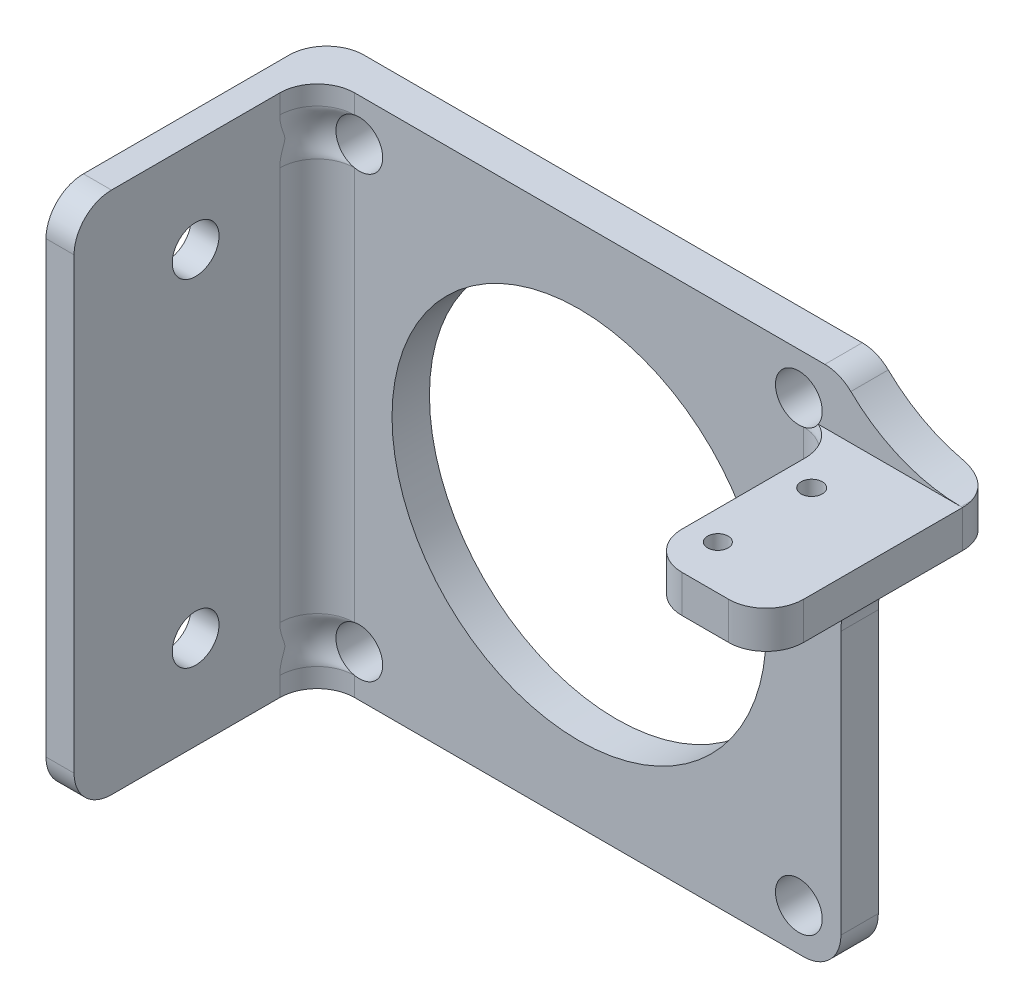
ISO-10303-21;
HEADER;
FILE_DESCRIPTION(('STEP AP214'),'2;1');
FILE_NAME('part.step','',(''),(''),'','','');
FILE_SCHEMA(('AUTOMOTIVE_DESIGN { 1 0 10303 214 1 1 1 1 }'));
ENDSEC;
DATA;
#1=APPLICATION_CONTEXT('core data for automotive mechanical design processes');
#2=APPLICATION_PROTOCOL_DEFINITION('international standard','automotive_design',2000,#1);
#3=PRODUCT_CONTEXT('',#1,'mechanical');
#4=PRODUCT('Part','Part','',(#3));
#5=PRODUCT_RELATED_PRODUCT_CATEGORY('part','',(#4));
#6=PRODUCT_DEFINITION_FORMATION('','',#4);
#7=PRODUCT_DEFINITION_CONTEXT('part definition',#1,'design');
#8=PRODUCT_DEFINITION('design','',#6,#7);
#9=PRODUCT_DEFINITION_SHAPE('','',#8);
#10=(LENGTH_UNIT() NAMED_UNIT(*) SI_UNIT(.MILLI.,.METRE.));
#11=(NAMED_UNIT(*) PLANE_ANGLE_UNIT() SI_UNIT($,.RADIAN.));
#12=(NAMED_UNIT(*) SI_UNIT($,.STERADIAN.) SOLID_ANGLE_UNIT());
#13=UNCERTAINTY_MEASURE_WITH_UNIT(LENGTH_MEASURE(1.E-05),#10,'distance_accuracy_value','');
#14=(GEOMETRIC_REPRESENTATION_CONTEXT(3) GLOBAL_UNCERTAINTY_ASSIGNED_CONTEXT((#13)) GLOBAL_UNIT_ASSIGNED_CONTEXT((#10,
#11,#12)) REPRESENTATION_CONTEXT('',''));
#15=CARTESIAN_POINT('',(0.,0.,0.));
#16=DIRECTION('',(0.,0.,1.));
#17=DIRECTION('',(1.,0.,0.));
#18=AXIS2_PLACEMENT_3D('',#15,#16,#17);
#19=CARTESIAN_POINT('',(0.,22.099926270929,25.));
#20=DIRECTION('',(0.,-1.,0.));
#21=DIRECTION('',(1.,0.,0.));
#22=AXIS2_PLACEMENT_3D('',#19,#20,#21);
#23=PLANE('',#22);
#24=CARTESIAN_POINT('',(31.1141681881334,22.099926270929,10.2420437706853));
#25=DIRECTION('',(0.,-1.,0.));
#26=DIRECTION('',(1.,0.,0.));
#27=AXIS2_PLACEMENT_3D('',#24,#25,#26);
#28=CIRCLE('',#27,1.13270438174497);
#29=CARTESIAN_POINT('',(32.2468725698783,22.099926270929,10.2420437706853));
#30=VERTEX_POINT('',#29);
#31=EDGE_CURVE('E261',#30,#30,#28,.T.);
#32=ORIENTED_EDGE('',*,*,#31,.T.);
#33=EDGE_LOOP('',(#32));
#34=FACE_BOUND('',#33,.T.);
#35=CARTESIAN_POINT('',(31.1141681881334,22.099926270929,20.2721530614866));
#36=DIRECTION('',(0.,-1.,0.));
#37=DIRECTION('',(1.,0.,0.));
#38=AXIS2_PLACEMENT_3D('',#35,#36,#37);
#39=CIRCLE('',#38,1.1);
#40=CARTESIAN_POINT('',(32.2141681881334,22.099926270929,20.2721530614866));
#41=VERTEX_POINT('',#40);
#42=EDGE_CURVE('E267',#41,#41,#39,.T.);
#43=ORIENTED_EDGE('',*,*,#42,.T.);
#44=EDGE_LOOP('',(#43));
#45=FACE_BOUND('',#44,.T.);
#46=DIRECTION('',(0.,0.,-1.));
#47=VECTOR('',#46,1.);
#48=CARTESIAN_POINT('',(28.,22.099926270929,25.));
#49=LINE('',#48,#47);
#50=CARTESIAN_POINT('',(28.,22.099926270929,21.));
#51=VERTEX_POINT('',#50);
#52=CARTESIAN_POINT('',(28.,22.099926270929,7.86951871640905));
#53=VERTEX_POINT('',#52);
#54=EDGE_CURVE('E284',#51,#53,#49,.T.);
#55=ORIENTED_EDGE('',*,*,#54,.F.);
#56=CARTESIAN_POINT('',(32.,22.099926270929,21.));
#57=DIRECTION('',(0.,-1.,0.));
#58=DIRECTION('',(1.,0.,0.));
#59=AXIS2_PLACEMENT_3D('',#56,#57,#58);
#60=CIRCLE('',#59,4.);
#61=CARTESIAN_POINT('',(32.,22.099926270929,25.));
#62=VERTEX_POINT('',#61);
#63=EDGE_CURVE('E709',#51,#62,#60,.F.);
#64=ORIENTED_EDGE('',*,*,#63,.T.);
#65=DIRECTION('',(-1.,0.,0.));
#66=VECTOR('',#65,1.);
#67=CARTESIAN_POINT('',(0.,22.099926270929,25.));
#68=LINE('',#67,#66);
#69=CARTESIAN_POINT('',(37.,22.099926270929,25.));
#70=VERTEX_POINT('',#69);
#71=EDGE_CURVE('E270',#70,#62,#68,.T.);
#72=ORIENTED_EDGE('',*,*,#71,.F.);
#73=CARTESIAN_POINT('',(37.,22.099926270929,21.));
#74=DIRECTION('',(0.,-1.,0.));
#75=DIRECTION('',(1.,0.,0.));
#76=AXIS2_PLACEMENT_3D('',#73,#74,#75);
#77=CIRCLE('',#76,4.);
#78=CARTESIAN_POINT('',(41.,22.099926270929,21.));
#79=VERTEX_POINT('',#78);
#80=EDGE_CURVE('E712',#70,#79,#77,.F.);
#81=ORIENTED_EDGE('',*,*,#80,.T.);
#82=DIRECTION('',(0.,0.,-1.));
#83=VECTOR('',#82,1.);
#84=CARTESIAN_POINT('',(41.,22.099926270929,25.));
#85=LINE('',#84,#83);
#86=CARTESIAN_POINT('',(41.,22.099926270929,4.));
#87=VERTEX_POINT('',#86);
#88=EDGE_CURVE('E276',#79,#87,#85,.T.);
#89=ORIENTED_EDGE('',*,*,#88,.T.);
#90=CARTESIAN_POINT('',(37.,22.099926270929,4.));
#91=DIRECTION('',(0.,-1.,0.));
#92=DIRECTION('',(1.,0.,0.));
#93=AXIS2_PLACEMENT_3D('',#90,#91,#92);
#94=CIRCLE('',#93,4.);
#95=CARTESIAN_POINT('',(40.8560095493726,22.099926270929,2.93642567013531));
#96=VERTEX_POINT('',#95);
#97=EDGE_CURVE('E234',#87,#96,#94,.F.);
#98=ORIENTED_EDGE('',*,*,#97,.T.);
#99=DIRECTION('',(0.,0.,1.));
#100=VECTOR('',#99,1.);
#101=CARTESIAN_POINT('',(40.8560095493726,22.099926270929,-14.1452413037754));
#102=LINE('',#101,#100);
#103=CARTESIAN_POINT('',(40.8560095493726,22.099926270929,4.));
#104=VERTEX_POINT('',#103);
#105=EDGE_CURVE('E227',#96,#104,#102,.T.);
#106=ORIENTED_EDGE('',*,*,#105,.T.);
#107=DIRECTION('',(1.,0.,0.));
#108=VECTOR('',#107,1.);
#109=CARTESIAN_POINT('',(28.,22.099926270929,4.));
#110=LINE('',#109,#108);
#111=CARTESIAN_POINT('',(25.5711816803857,22.099926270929,4.));
#112=VERTEX_POINT('',#111);
#113=EDGE_CURVE('E231',#112,#104,#110,.T.);
#114=ORIENTED_EDGE('',*,*,#113,.F.);
#115=CARTESIAN_POINT('',(28.,23.4410988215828,7.46609544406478));
#116=CARTESIAN_POINT('',(28.,23.2849304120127,5.1487343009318));
#117=CARTESIAN_POINT('',(25.9828317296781,23.2075164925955,4.));
#118=CARTESIAN_POINT('',(28.,23.4311667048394,7.46676410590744));
#119=CARTESIAN_POINT('',(28.,23.248944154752,5.14673878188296));
#120=CARTESIAN_POINT('',(25.9771118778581,23.1588623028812,4.));
#121=CARTESIAN_POINT('',(28.,23.4212468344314,7.4675995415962));
#122=CARTESIAN_POINT('',(28.,23.2132488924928,5.14424810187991));
#123=CARTESIAN_POINT('',(25.9699872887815,23.1107940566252,4.));
#124=CARTESIAN_POINT('',(28.,23.4014403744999,7.46958596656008));
#125=CARTESIAN_POINT('',(28.,23.1426452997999,5.13835616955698));
#126=CARTESIAN_POINT('',(25.9532192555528,23.016258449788,4.));
#127=CARTESIAN_POINT('',(28.,23.3915537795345,7.4707369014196));
#128=CARTESIAN_POINT('',(28.,23.1077228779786,5.13495253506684));
#129=CARTESIAN_POINT('',(25.9435762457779,22.9697908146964,4.));
#130=CARTESIAN_POINT('',(28.,23.3619791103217,7.4746328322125));
#131=CARTESIAN_POINT('',(28.,23.0044495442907,5.12348820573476));
#132=CARTESIAN_POINT('',(25.9113312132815,22.8335322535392,4.));
#133=CARTESIAN_POINT('',(28.,23.3423487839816,7.47782289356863));
#134=CARTESIAN_POINT('',(28.,22.9376117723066,5.11417058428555));
#135=CARTESIAN_POINT('',(25.8853958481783,22.7467494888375,4.));
#136=CARTESIAN_POINT('',(28.,23.3034025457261,7.48518143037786));
#137=CARTESIAN_POINT('',(28.,22.8094515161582,5.09304307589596));
#138=CARTESIAN_POINT('',(25.8276186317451,22.5836713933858,4.));
#139=CARTESIAN_POINT('',(28.,23.2840854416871,7.4893437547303));
#140=CARTESIAN_POINT('',(28.,22.7480522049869,5.08122476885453));
#141=CARTESIAN_POINT('',(25.7958141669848,22.5073147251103,4.));
#142=CARTESIAN_POINT('',(28.,23.2456348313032,7.49846430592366));
#143=CARTESIAN_POINT('',(28.,22.6307044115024,5.05581497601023));
#144=CARTESIAN_POINT('',(25.7288169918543,22.3648429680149,4.));
#145=CARTESIAN_POINT('',(28.,23.2265013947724,7.503422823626));
#146=CARTESIAN_POINT('',(28.,22.5747524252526,5.04220436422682));
#147=CARTESIAN_POINT('',(25.693623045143,22.298731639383,4.));
#148=CARTESIAN_POINT('',(28.,23.1883208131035,7.51397756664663));
#149=CARTESIAN_POINT('',(28.,22.4680718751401,5.01380772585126));
#150=CARTESIAN_POINT('',(25.6218030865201,22.1759768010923,4.));
#151=CARTESIAN_POINT('',(28.,23.1692744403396,7.51957655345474));
#152=CARTESIAN_POINT('',(28.,22.4173891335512,4.99900581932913));
#153=CARTESIAN_POINT('',(25.585171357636,22.1193771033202,4.));
#154=CARTESIAN_POINT('',(28.,23.1313268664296,7.53123544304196));
#155=CARTESIAN_POINT('',(28.,22.3212504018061,4.96881181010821));
#156=CARTESIAN_POINT('',(25.5121453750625,22.0149649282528,4.));
#157=CARTESIAN_POINT('',(28.,23.112425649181,7.53729529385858));
#158=CARTESIAN_POINT('',(28.,22.2758272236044,4.95341548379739));
#159=CARTESIAN_POINT('',(25.4757510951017,21.9671514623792,4.));
#160=CARTESIAN_POINT('',(28.,23.0746918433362,7.54975906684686));
#161=CARTESIAN_POINT('',(28.,22.1896770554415,4.92239240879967));
#162=CARTESIAN_POINT('',(25.4040924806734,21.8789915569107,4.));
#163=CARTESIAN_POINT('',(28.,23.0558594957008,7.5561637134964));
#164=CARTESIAN_POINT('',(28.,22.1489999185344,4.90676660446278));
#165=CARTESIAN_POINT('',(25.3688307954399,21.8386617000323,4.));
#166=CARTESIAN_POINT('',(28.,23.0182727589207,7.56919911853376));
#167=CARTESIAN_POINT('',(28.,22.0719807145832,4.87559724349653));
#168=CARTESIAN_POINT('',(25.3000789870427,21.764413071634,4.));
#169=CARTESIAN_POINT('',(28.,22.9995183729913,7.57582988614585));
#170=CARTESIAN_POINT('',(28.,22.0356774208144,4.86005846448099));
#171=CARTESIAN_POINT('',(25.266588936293,21.7304945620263,4.));
#172=CARTESIAN_POINT('',(28.,22.9443645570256,7.59555769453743));
#173=CARTESIAN_POINT('',(28.,21.9341439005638,4.81459115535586));
#174=CARTESIAN_POINT('',(25.1710298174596,21.638434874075,4.));
#175=CARTESIAN_POINT('',(28.,22.9080338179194,7.60884558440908));
#176=CARTESIAN_POINT('',(28.,21.874763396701,4.78523506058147));
#177=CARTESIAN_POINT('',(25.1118515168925,21.5876824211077,4.));
#178=CARTESIAN_POINT('',(28.,22.8353925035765,7.63547753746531));
#179=CARTESIAN_POINT('',(28.,21.7673212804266,4.72834912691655));
#180=CARTESIAN_POINT('',(25.0016295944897,21.4999991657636,4.));
#181=CARTESIAN_POINT('',(28.,22.7990819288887,7.64882160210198));
#182=CARTESIAN_POINT('',(28.,21.7194623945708,4.70088061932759));
#183=CARTESIAN_POINT('',(24.9505861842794,21.4630687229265,4.));
#184=CARTESIAN_POINT('',(28.,22.7263721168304,7.67526466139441));
#185=CARTESIAN_POINT('',(28.,21.6326238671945,4.64799597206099));
#186=CARTESIAN_POINT('',(24.8557971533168,21.3987900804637,4.));
#187=CARTESIAN_POINT('',(28.,22.6899728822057,7.68836366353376));
#188=CARTESIAN_POINT('',(28.,21.5937896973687,4.62263579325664));
#189=CARTESIAN_POINT('',(24.8120513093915,21.371441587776,4.));
#190=CARTESIAN_POINT('',(28.,22.6170144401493,7.71410867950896));
#191=CARTESIAN_POINT('',(28.,21.523126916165,4.57396668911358));
#192=CARTESIAN_POINT('',(24.7308100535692,21.3234618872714,4.));
#193=CARTESIAN_POINT('',(28.,22.5804552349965,7.7267546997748));
#194=CARTESIAN_POINT('',(28.,21.491401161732,4.55070483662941));
#195=CARTESIAN_POINT('',(24.6933145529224,21.3028305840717,4.));
#196=CARTESIAN_POINT('',(28.,22.5071916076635,7.75142743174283));
#197=CARTESIAN_POINT('',(28.,21.4335733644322,4.50615345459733));
#198=CARTESIAN_POINT('',(24.623613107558,21.2663854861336,4.));
#199=CARTESIAN_POINT('',(28.,22.4704875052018,7.76345508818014));
#200=CARTESIAN_POINT('',(28.,21.4075343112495,4.48489843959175));
#201=CARTESIAN_POINT('',(24.591398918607,21.2505641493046,4.));
#202=CARTESIAN_POINT('',(28.,22.3968560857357,7.78680607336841));
#203=CARTESIAN_POINT('',(28.,21.3599463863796,4.44416835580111));
#204=CARTESIAN_POINT('',(24.5313226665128,21.2224000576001,4.));
#205=CARTESIAN_POINT('',(28.,22.3599287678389,7.79812939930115));
#206=CARTESIAN_POINT('',(28.,21.3384485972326,4.42472332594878));
#207=CARTESIAN_POINT('',(24.5034606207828,21.2100573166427,4.));
#208=CARTESIAN_POINT('',(28.,22.2487914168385,7.83091926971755));
#209=CARTESIAN_POINT('',(28.,21.2792005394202,4.36863511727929));
#210=CARTESIAN_POINT('',(24.4252688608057,21.1768236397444,4.));
#211=CARTESIAN_POINT('',(28.,22.174227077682,7.85120533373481));
#212=CARTESIAN_POINT('',(28.,21.2472548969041,4.33470627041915));
#213=CARTESIAN_POINT('',(24.3803345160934,21.1597277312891,4.));
#214=CARTESIAN_POINT('',(28.,22.0250428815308,7.88797578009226));
#215=CARTESIAN_POINT('',(28.,21.1933960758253,4.27236646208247));
#216=CARTESIAN_POINT('',(24.3009584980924,21.1314236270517,4.));
#217=CARTESIAN_POINT('',(28.,21.9504328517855,7.90449990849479));
#218=CARTESIAN_POINT('',(28.,21.1715187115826,4.24400930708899));
#219=CARTESIAN_POINT('',(24.2664057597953,21.1201521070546,4.));
#220=CARTESIAN_POINT('',(28.,21.8004710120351,7.93376595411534));
#221=CARTESIAN_POINT('',(28.,21.1345851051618,4.19144512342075));
#222=CARTESIAN_POINT('',(24.2043971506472,21.1010678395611,4.));
#223=CARTESIAN_POINT('',(28.,21.7251191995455,7.94650785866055));
#224=CARTESIAN_POINT('',(28.,21.1196088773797,4.16731098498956));
#225=CARTESIAN_POINT('',(24.1769413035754,21.0932551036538,4.));
#226=CARTESIAN_POINT('',(28.,21.5737595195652,7.96803960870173));
#227=CARTESIAN_POINT('',(28.,21.0946370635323,4.12245970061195));
#228=CARTESIAN_POINT('',(24.1272354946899,21.0798284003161,4.));
#229=CARTESIAN_POINT('',(28.,21.4977509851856,7.97682479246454));
#230=CARTESIAN_POINT('',(28.,21.0846927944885,4.1017948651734));
#231=CARTESIAN_POINT('',(24.1049916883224,21.0742170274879,4.));
#232=CARTESIAN_POINT('',(28.,21.3453797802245,7.9902977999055));
#233=CARTESIAN_POINT('',(28.,21.0685681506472,4.06337723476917));
#234=CARTESIAN_POINT('',(24.0644730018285,21.0644711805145,4.));
#235=CARTESIAN_POINT('',(28.,21.2690171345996,7.99498590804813));
#236=CARTESIAN_POINT('',(28.,21.0624138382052,4.04565678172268));
#237=CARTESIAN_POINT('',(24.0461978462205,21.0603366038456,4.));
#238=CARTESIAN_POINT('',(28.,21.0803608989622,8.00139624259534));
#239=CARTESIAN_POINT('',(28.,21.0507387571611,4.00494055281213));
#240=CARTESIAN_POINT('',(24.0048450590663,21.0513735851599,4.));
#241=CARTESIAN_POINT('',(28.,20.9679752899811,8.00070395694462));
#242=CARTESIAN_POINT('',(28.,21.0469191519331,3.98347390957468));
#243=CARTESIAN_POINT('',(23.9835220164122,21.0471258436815,4.));
#244=CARTESIAN_POINT('',(28.,20.7437324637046,7.99017009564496));
#245=CARTESIAN_POINT('',(28.,21.0434988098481,3.94490078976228));
#246=CARTESIAN_POINT('',(23.9454988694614,21.0399401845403,4.));
#247=CARTESIAN_POINT('',(28.,20.6318748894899,7.98033600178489));
#248=CARTESIAN_POINT('',(28.,21.0439168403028,3.92783342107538));
#249=CARTESIAN_POINT('',(23.9287949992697,21.0370011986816,4.));
#250=CARTESIAN_POINT('',(28.,20.4044748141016,7.95086826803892));
#251=CARTESIAN_POINT('',(28.,21.0477741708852,3.89666539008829));
#252=CARTESIAN_POINT('',(23.8980728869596,21.0318437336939,4.));
#253=CARTESIAN_POINT('',(28.,20.2889849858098,7.93082503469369));
#254=CARTESIAN_POINT('',(28.,21.0513552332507,3.88275952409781));
#255=CARTESIAN_POINT('',(23.8842039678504,21.0296623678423,4.));
#256=CARTESIAN_POINT('',(28.,20.0600219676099,7.88081936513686));
#257=CARTESIAN_POINT('',(28.,21.0607843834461,3.85835165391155));
#258=CARTESIAN_POINT('',(23.8592076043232,21.0259125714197,4.));
#259=CARTESIAN_POINT('',(28.,19.9465515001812,7.85084447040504));
#260=CARTESIAN_POINT('',(28.,21.0666393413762,3.84787364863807));
#261=CARTESIAN_POINT('',(23.8480836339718,21.0243449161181,4.));
#262=CARTESIAN_POINT('',(28.,19.8346038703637,7.81596377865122));
#263=CARTESIAN_POINT('',(28.,21.0731322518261,3.83882439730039));
#264=CARTESIAN_POINT('',(23.8378979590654,21.0229402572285,4.));
#265=(BOUNDED_SURFACE() B_SPLINE_SURFACE(3,2,((#115,#116,#117),(#118,#119,#120),(#121,#122,
#123),(#124,#125,#126),(#127,#128,#129),(#130,#131,#132),(#133,#134,#135),(#136,#137,#138),
(#139,#140,#141),(#142,#143,#144),(#145,#146,#147),(#148,#149,#150),(#151,#152,#153),(#154,#155,
#156),(#157,#158,#159),(#160,#161,#162),(#163,#164,#165),(#166,#167,#168),(#169,#170,#171),
(#172,#173,#174),(#175,#176,#177),(#178,#179,#180),(#181,#182,#183),(#184,#185,#186),(#187,#188,
#189),(#190,#191,#192),(#193,#194,#195),(#196,#197,#198),(#199,#200,#201),(#202,#203,#204),
(#205,#206,#207),(#208,#209,#210),(#211,#212,#213),(#214,#215,#216),(#217,#218,#219),(#220,#221,
#222),(#223,#224,#225),(#226,#227,#228),(#229,#230,#231),(#232,#233,#234),(#235,#236,#237),
(#238,#239,#240),(#241,#242,#243),(#244,#245,#246),(#247,#248,#249),(#250,#251,#252),(#253,#254,
#255),(#256,#257,#258),(#259,#260,#261),(#262,#263,#264)),.UNSPECIFIED.,.F.,.F.,
.F.) B_SPLINE_SURFACE_WITH_KNOTS((4,2,2,2,2,2,2,2,2,2,2,2,2,2,2,2,2,2,2,2,2,2,2,2,4),(3,3),(0.,
0.0298606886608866,0.0597162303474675,0.119345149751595,0.178606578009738,0.237889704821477,
0.297438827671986,0.356981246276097,0.416654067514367,0.476329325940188,0.592381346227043,
0.708436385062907,0.824487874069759,0.940537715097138,1.05640463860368,1.17227202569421,
1.40401025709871,1.63317295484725,1.86233642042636,2.09176918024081,2.32118600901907,
2.65795965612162,2.9944579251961,3.34566618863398,3.6973166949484),(0.,1.),
.UNSPECIFIED.) GEOMETRIC_REPRESENTATION_ITEM() RATIONAL_B_SPLINE_SURFACE(((1.,0.864785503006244,
1.),(1.,0.864372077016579,1.),(1.,0.863856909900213,1.),(1.,0.862642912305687,1.),(1.,
0.861944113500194,1.),(1.,0.859603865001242,1.),(1.,0.857717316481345,1.),(1.,0.853496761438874,
1.),(1.,0.851165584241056,1.),(1.,0.846231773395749,1.),(1.,0.843629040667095,1.),(1.,
0.838291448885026,1.),(1.,0.835556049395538,1.),(1.,0.830075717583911,1.),(1.,0.827330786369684,
1.),(1.,0.821899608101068,1.),(1.,0.81921350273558,1.),(1.,0.813951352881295,1.),(1.,
0.811375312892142,1.),(1.,0.803991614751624,1.),(1.,0.799374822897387,1.),(1.,0.79071016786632,
1.),(1.,0.786662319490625,1.),(1.,0.779094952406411,1.),(1.,0.775575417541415,1.),(1.,
0.769000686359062,1.),(1.,0.765945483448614,1.),(1.,0.760236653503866,1.),(1.,0.757582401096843,
1.),(1.,0.752609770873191,1.),(1.,0.75029139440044,1.),(1.,0.743759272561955,1.),(1.,
0.739968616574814,1.),(1.,0.733233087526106,1.),(1.,0.730279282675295,1.),(1.,0.724952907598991,
1.),(1.,0.722580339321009,1.),(1.,0.718268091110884,1.),(1.,0.716328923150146,1.),(1.,
0.712784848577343,1.),(1.,0.711179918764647,1.),(1.,0.707538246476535,1.),(1.,0.705650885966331,
1.),(1.,0.702274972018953,1.),(1.,0.700786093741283,1.),(1.,0.698040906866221,1.),(1.,
0.696797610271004,1.),(1.,0.694551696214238,1.),(1.,0.6935493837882,1.),(1.,0.69263066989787,1.))) REPRESENTATION_ITEM('') SURFACE());
#266=CARTESIAN_POINT('',(25.5711816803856,22.099926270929,4.));
#267=CARTESIAN_POINT('',(25.6736010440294,22.099926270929,4.04567486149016));
#268=CARTESIAN_POINT('',(25.7740194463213,22.099926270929,4.09581790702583));
#269=CARTESIAN_POINT('',(25.970141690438,22.099926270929,4.20455846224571));
#270=CARTESIAN_POINT('',(26.0658465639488,22.099926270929,4.26315411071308));
#271=CARTESIAN_POINT('',(26.2514579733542,22.099926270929,4.38805799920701));
#272=CARTESIAN_POINT('',(26.3413885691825,22.099926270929,4.45433050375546));
#273=CARTESIAN_POINT('',(26.5153169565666,22.099926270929,4.59424603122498));
#274=CARTESIAN_POINT('',(26.5993146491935,22.099926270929,4.66788917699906));
#275=CARTESIAN_POINT('',(26.7608077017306,22.099926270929,4.82190176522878));
#276=CARTESIAN_POINT('',(26.8383069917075,22.099926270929,4.90226708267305));
#277=CARTESIAN_POINT('',(26.9864519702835,22.099926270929,5.06909859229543));
#278=CARTESIAN_POINT('',(27.05709468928,22.099926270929,5.15556740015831));
#279=CARTESIAN_POINT('',(27.2583712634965,22.099926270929,5.42330234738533));
#280=CARTESIAN_POINT('',(27.3782930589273,22.099926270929,5.61283886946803));
#281=CARTESIAN_POINT('',(27.5378383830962,22.099926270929,5.91348364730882));
#282=CARTESIAN_POINT('',(27.588507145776,22.099926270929,6.01896324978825));
#283=CARTESIAN_POINT('',(27.681443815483,22.099926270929,6.23357473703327));
#284=CARTESIAN_POINT('',(27.7237107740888,22.099926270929,6.34270703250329));
#285=CARTESIAN_POINT('',(27.8374037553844,22.099926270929,6.67433423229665));
#286=CARTESIAN_POINT('',(27.8959387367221,22.099926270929,6.90146980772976));
#287=CARTESIAN_POINT('',(27.9571808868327,22.099926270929,7.25348894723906));
#288=CARTESIAN_POINT('',(27.9731969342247,22.099926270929,7.37623081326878));
#289=CARTESIAN_POINT('',(27.9946004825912,22.099926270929,7.62246059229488));
#290=CARTESIAN_POINT('',(28.0000029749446,22.099926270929,7.74594720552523));
#291=CARTESIAN_POINT('',(28.,22.099926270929,7.86951871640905));
#292=B_SPLINE_CURVE_WITH_KNOTS('',3,(#266,#267,#268,#269,#270,#271,#272,#273,#274,#275,#276,
#277,#278,#279,#280,#281,#282,#283,#284,#285,#286,#287,#288,#289,#290,#291),.UNSPECIFIED.,.F.,
.F.,(4,2,2,2,2,2,2,2,2,2,2,2,4),(0.,0.336310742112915,0.672547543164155,1.00727771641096,
1.34201346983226,1.67654530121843,2.01122137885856,2.68082234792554,3.03158773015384,
3.38239268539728,4.0826246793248,4.45358473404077,4.82402043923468),.UNSPECIFIED.);
#293=EDGE_CURVE('E512',#112,#53,#292,.T.);
#294=ORIENTED_EDGE('',*,*,#293,.T.);
#295=EDGE_LOOP('',(#55,#64,#72,#81,#89,#98,#106,#114,#294));
#296=FACE_BOUND('',#295,.T.);
#297=ADVANCED_FACE('F48',(#34,#45,#296),#23,.F.);
#298=CARTESIAN_POINT('',(28.,28.,4.));
#299=DIRECTION('',(-1.,0.,0.));
#300=DIRECTION('',(0.,0.,1.));
#301=AXIS2_PLACEMENT_3D('',#298,#299,#300);
#302=PLANE('',#301);
#303=DIRECTION('',(0.,1.,0.));
#304=VECTOR('',#303,1.);
#305=CARTESIAN_POINT('',(28.,28.,0.));
#306=LINE('',#305,#304);
#307=CARTESIAN_POINT('',(28.,-24.,0.));
#308=VERTEX_POINT('',#307);
#309=CARTESIAN_POINT('',(28.,4.13568622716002,0.));
#310=VERTEX_POINT('',#309);
#311=EDGE_CURVE('E342',#308,#310,#306,.T.);
#312=ORIENTED_EDGE('',*,*,#311,.T.);
#313=DIRECTION('',(0.,0.,1.));
#314=VECTOR('',#313,1.);
#315=CARTESIAN_POINT('',(28.,4.13568622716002,4.));
#316=LINE('',#315,#314);
#317=CARTESIAN_POINT('',(28.,4.13568622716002,4.));
#318=VERTEX_POINT('',#317);
#319=EDGE_CURVE('E464',#310,#318,#316,.T.);
#320=ORIENTED_EDGE('',*,*,#319,.T.);
#321=DIRECTION('',(0.,1.,0.));
#322=VECTOR('',#321,1.);
#323=CARTESIAN_POINT('',(28.,28.,4.));
#324=LINE('',#323,#322);
#325=CARTESIAN_POINT('',(28.,-24.,4.));
#326=VERTEX_POINT('',#325);
#327=EDGE_CURVE('E345',#326,#318,#324,.T.);
#328=ORIENTED_EDGE('',*,*,#327,.F.);
#329=DIRECTION('',(0.,0.,-1.));
#330=VECTOR('',#329,1.);
#331=CARTESIAN_POINT('',(28.,-24.,4.));
#332=LINE('',#331,#330);
#333=EDGE_CURVE('E519',#326,#308,#332,.T.);
#334=ORIENTED_EDGE('',*,*,#333,.T.);
#335=EDGE_LOOP('',(#312,#320,#328,#334));
#336=FACE_BOUND('',#335,.T.);
#337=ADVANCED_FACE('F402',(#336),#302,.F.);
#338=CARTESIAN_POINT('',(0.,0.,4.));
#339=DIRECTION('',(0.,0.,1.));
#340=DIRECTION('',(1.,0.,0.));
#341=AXIS2_PLACEMENT_3D('',#338,#339,#340);
#342=PLANE('',#341);
#343=CARTESIAN_POINT('',(23.5,-23.5,4.));
#344=DIRECTION('',(0.,0.,1.));
#345=DIRECTION('',(1.,0.,0.));
#346=AXIS2_PLACEMENT_3D('',#343,#344,#345);
#347=CIRCLE('',#346,2.5);
#348=CARTESIAN_POINT('',(26.,-23.5,4.));
#349=VERTEX_POINT('',#348);
#350=EDGE_CURVE('E321',#349,#349,#347,.T.);
#351=ORIENTED_EDGE('',*,*,#350,.F.);
#352=EDGE_LOOP('',(#351));
#353=FACE_BOUND('',#352,.T.);
#354=CARTESIAN_POINT('',(23.5,23.5,4.));
#355=DIRECTION('',(0.,0.,1.));
#356=DIRECTION('',(1.,0.,0.));
#357=AXIS2_PLACEMENT_3D('',#354,#355,#356);
#358=CIRCLE('',#357,2.5);
#359=CARTESIAN_POINT('',(24.,21.0505102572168,4.));
#360=VERTEX_POINT('',#359);
#361=EDGE_CURVE('E253',#112,#360,#358,.T.);
#362=ORIENTED_EDGE('',*,*,#361,.F.);
#363=ORIENTED_EDGE('',*,*,#113,.T.);
#364=CARTESIAN_POINT('',(40.8560095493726,39.0563119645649,4.));
#365=DIRECTION('',(0.,0.,-1.));
#366=DIRECTION('',(-1.,0.,0.));
#367=AXIS2_PLACEMENT_3D('',#364,#365,#366);
#368=CIRCLE('',#367,16.9563856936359);
#369=CARTESIAN_POINT('',(29.0616747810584,26.8738375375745,4.));
#370=VERTEX_POINT('',#369);
#371=EDGE_CURVE('E240',#104,#370,#368,.T.);
#372=ORIENTED_EDGE('',*,*,#371,.T.);
#373=CARTESIAN_POINT('',(26.2793991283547,24.,4.));
#374=DIRECTION('',(0.,0.,1.));
#375=DIRECTION('',(1.,0.,0.));
#376=AXIS2_PLACEMENT_3D('',#373,#374,#375);
#377=CIRCLE('',#376,4.);
#378=CARTESIAN_POINT('',(26.2793991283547,28.,4.));
#379=VERTEX_POINT('',#378);
#380=EDGE_CURVE('E374',#370,#379,#377,.T.);
#381=ORIENTED_EDGE('',*,*,#380,.T.);
#382=DIRECTION('',(-1.,0.,0.));
#383=VECTOR('',#382,1.);
#384=CARTESIAN_POINT('',(-28.,28.,4.));
#385=LINE('',#384,#383);
#386=CARTESIAN_POINT('',(-24.,28.,4.));
#387=VERTEX_POINT('',#386);
#388=EDGE_CURVE('E348',#379,#387,#385,.T.);
#389=ORIENTED_EDGE('',*,*,#388,.T.);
#390=DIRECTION('',(0.,-1.,0.));
#391=VECTOR('',#390,1.);
#392=CARTESIAN_POINT('',(-24.,0.,4.));
#393=LINE('',#392,#391);
#394=CARTESIAN_POINT('',(-24.,25.9494897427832,4.));
#395=VERTEX_POINT('',#394);
#396=EDGE_CURVE('E371',#387,#395,#393,.T.);
#397=ORIENTED_EDGE('',*,*,#396,.T.);
#398=CARTESIAN_POINT('',(-23.5,23.5,4.));
#399=DIRECTION('',(0.,0.,1.));
#400=DIRECTION('',(1.,0.,0.));
#401=AXIS2_PLACEMENT_3D('',#398,#399,#400);
#402=CIRCLE('',#401,2.5);
#403=CARTESIAN_POINT('',(-24.,21.0505102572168,4.));
#404=VERTEX_POINT('',#403);
#405=EDGE_CURVE('E336',#404,#395,#402,.T.);
#406=ORIENTED_EDGE('',*,*,#405,.F.);
#407=DIRECTION('',(0.,-1.,0.));
#408=VECTOR('',#407,1.);
#409=CARTESIAN_POINT('',(-24.,0.,4.));
#410=LINE('',#409,#408);
#411=CARTESIAN_POINT('',(-24.,-21.0505102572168,4.));
#412=VERTEX_POINT('',#411);
#413=EDGE_CURVE('E369',#404,#412,#410,.T.);
#414=ORIENTED_EDGE('',*,*,#413,.T.);
#415=CARTESIAN_POINT('',(-23.5,-23.5,4.));
#416=DIRECTION('',(0.,0.,1.));
#417=DIRECTION('',(1.,0.,0.));
#418=AXIS2_PLACEMENT_3D('',#415,#416,#417);
#419=CIRCLE('',#418,2.5);
#420=CARTESIAN_POINT('',(-24.,-25.9494897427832,4.));
#421=VERTEX_POINT('',#420);
#422=EDGE_CURVE('E318',#421,#412,#419,.T.);
#423=ORIENTED_EDGE('',*,*,#422,.F.);
#424=DIRECTION('',(0.,-1.,0.));
#425=VECTOR('',#424,1.);
#426=CARTESIAN_POINT('',(-24.,0.,4.));
#427=LINE('',#426,#425);
#428=CARTESIAN_POINT('',(-24.,-28.,4.));
#429=VERTEX_POINT('',#428);
#430=EDGE_CURVE('E367',#421,#429,#427,.T.);
#431=ORIENTED_EDGE('',*,*,#430,.T.);
#432=DIRECTION('',(1.,0.,0.));
#433=VECTOR('',#432,1.);
#434=CARTESIAN_POINT('',(-28.,-28.,4.));
#435=LINE('',#434,#433);
#436=CARTESIAN_POINT('',(24.,-28.,4.));
#437=VERTEX_POINT('',#436);
#438=EDGE_CURVE('E352',#429,#437,#435,.T.);
#439=ORIENTED_EDGE('',*,*,#438,.T.);
#440=CARTESIAN_POINT('',(24.,-24.,4.));
#441=DIRECTION('',(0.,0.,1.));
#442=DIRECTION('',(1.,0.,0.));
#443=AXIS2_PLACEMENT_3D('',#440,#441,#442);
#444=CIRCLE('',#443,4.);
#445=EDGE_CURVE('E355',#437,#326,#444,.T.);
#446=ORIENTED_EDGE('',*,*,#445,.T.);
#447=ORIENTED_EDGE('',*,*,#327,.T.);
#448=CARTESIAN_POINT('',(42.,4.13568622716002,4.));
#449=DIRECTION('',(0.,0.,1.));
#450=DIRECTION('',(1.,0.,0.));
#451=AXIS2_PLACEMENT_3D('',#448,#449,#450);
#452=CIRCLE('',#451,14.);
#453=CARTESIAN_POINT('',(41.,18.099926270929,4.));
#454=VERTEX_POINT('',#453);
#455=EDGE_CURVE('E13',#318,#454,#452,.F.);
#456=ORIENTED_EDGE('',*,*,#455,.T.);
#457=DIRECTION('',(-1.,0.,0.));
#458=VECTOR('',#457,1.);
#459=CARTESIAN_POINT('',(0.,18.099926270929,4.));
#460=LINE('',#459,#458);
#461=CARTESIAN_POINT('',(24.,18.099926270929,4.));
#462=VERTEX_POINT('',#461);
#463=EDGE_CURVE('E376',#454,#462,#460,.T.);
#464=ORIENTED_EDGE('',*,*,#463,.T.);
#465=DIRECTION('',(0.,1.,0.));
#466=VECTOR('',#465,1.);
#467=CARTESIAN_POINT('',(24.,0.,4.));
#468=LINE('',#467,#466);
#469=EDGE_CURVE('E379',#462,#360,#468,.T.);
#470=ORIENTED_EDGE('',*,*,#469,.T.);
#471=EDGE_LOOP('',(#362,#363,#372,#381,#389,#397,#406,#414,#423,#431,#439,#446,#447,#456,#464,#470));
#472=FACE_BOUND('',#471,.T.);
#473=CARTESIAN_POINT('',(0.,0.,4.));
#474=DIRECTION('',(0.,0.,1.));
#475=DIRECTION('',(1.,0.,0.));
#476=AXIS2_PLACEMENT_3D('',#473,#474,#475);
#477=CIRCLE('',#476,20.);
#478=CARTESIAN_POINT('',(20.,0.,4.));
#479=VERTEX_POINT('',#478);
#480=EDGE_CURVE('E339',#479,#479,#477,.T.);
#481=ORIENTED_EDGE('',*,*,#480,.F.);
#482=EDGE_LOOP('',(#481));
#483=FACE_BOUND('',#482,.T.);
#484=ADVANCED_FACE('F249',(#353,#472,#483),#342,.T.);
#485=CARTESIAN_POINT('',(0.,0.,0.));
#486=DIRECTION('',(0.,0.,1.));
#487=DIRECTION('',(1.,0.,0.));
#488=AXIS2_PLACEMENT_3D('',#485,#486,#487);
#489=PLANE('',#488);
#490=CARTESIAN_POINT('',(40.8560095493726,39.0563119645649,0.));
#491=DIRECTION('',(0.,0.,1.));
#492=DIRECTION('',(1.,0.,0.));
#493=AXIS2_PLACEMENT_3D('',#490,#491,#492);
#494=CIRCLE('',#493,16.9563856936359);
#495=CARTESIAN_POINT('',(29.0616747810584,26.8738375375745,0.));
#496=VERTEX_POINT('',#495);
#497=CARTESIAN_POINT('',(37.,22.5441889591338,0.));
#498=VERTEX_POINT('',#497);
#499=EDGE_CURVE('E237',#496,#498,#494,.T.);
#500=ORIENTED_EDGE('',*,*,#499,.T.);
#501=DIRECTION('',(0.,1.,0.));
#502=VECTOR('',#501,1.);
#503=CARTESIAN_POINT('',(37.,0.,0.));
#504=LINE('',#503,#502);
#505=CARTESIAN_POINT('',(37.,17.212383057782,0.));
#506=VERTEX_POINT('',#505);
#507=EDGE_CURVE('E64',#498,#506,#504,.F.);
#508=ORIENTED_EDGE('',*,*,#507,.T.);
#509=CARTESIAN_POINT('',(42.,4.13568622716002,0.));
#510=DIRECTION('',(0.,0.,1.));
#511=DIRECTION('',(1.,0.,0.));
#512=AXIS2_PLACEMENT_3D('',#509,#510,#511);
#513=CIRCLE('',#512,14.);
#514=EDGE_CURVE('E57',#506,#310,#513,.T.);
#515=ORIENTED_EDGE('',*,*,#514,.T.);
#516=ORIENTED_EDGE('',*,*,#311,.F.);
#517=CARTESIAN_POINT('',(24.,-24.,0.));
#518=DIRECTION('',(0.,0.,1.));
#519=DIRECTION('',(1.,0.,0.));
#520=AXIS2_PLACEMENT_3D('',#517,#518,#519);
#521=CIRCLE('',#520,4.);
#522=CARTESIAN_POINT('',(24.,-28.,0.));
#523=VERTEX_POINT('',#522);
#524=EDGE_CURVE('E606',#308,#523,#521,.F.);
#525=ORIENTED_EDGE('',*,*,#524,.T.);
#526=DIRECTION('',(1.,0.,0.));
#527=VECTOR('',#526,1.);
#528=CARTESIAN_POINT('',(-28.,-28.,0.));
#529=LINE('',#528,#527);
#530=CARTESIAN_POINT('',(-27.,-28.,0.));
#531=VERTEX_POINT('',#530);
#532=EDGE_CURVE('E349',#531,#523,#529,.T.);
#533=ORIENTED_EDGE('',*,*,#532,.F.);
#534=DIRECTION('',(0.,-1.,0.));
#535=VECTOR('',#534,1.);
#536=CARTESIAN_POINT('',(-27.,0.,0.));
#537=LINE('',#536,#535);
#538=CARTESIAN_POINT('',(-27.,28.,0.));
#539=VERTEX_POINT('',#538);
#540=EDGE_CURVE('E609',#531,#539,#537,.F.);
#541=ORIENTED_EDGE('',*,*,#540,.T.);
#542=DIRECTION('',(-1.,0.,0.));
#543=VECTOR('',#542,1.);
#544=CARTESIAN_POINT('',(-28.,28.,0.));
#545=LINE('',#544,#543);
#546=CARTESIAN_POINT('',(26.2793991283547,28.,0.));
#547=VERTEX_POINT('',#546);
#548=EDGE_CURVE('E357',#547,#539,#545,.T.);
#549=ORIENTED_EDGE('',*,*,#548,.F.);
#550=CARTESIAN_POINT('',(26.2793991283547,24.,0.));
#551=DIRECTION('',(0.,0.,1.));
#552=DIRECTION('',(1.,0.,0.));
#553=AXIS2_PLACEMENT_3D('',#550,#551,#552);
#554=CIRCLE('',#553,4.);
#555=EDGE_CURVE('E716',#547,#496,#554,.F.);
#556=ORIENTED_EDGE('',*,*,#555,.T.);
#557=EDGE_LOOP('',(#500,#508,#515,#516,#525,#533,#541,#549,#556));
#558=FACE_BOUND('',#557,.T.);
#559=CARTESIAN_POINT('',(0.,0.,0.));
#560=DIRECTION('',(0.,0.,1.));
#561=DIRECTION('',(1.,0.,0.));
#562=AXIS2_PLACEMENT_3D('',#559,#560,#561);
#563=CIRCLE('',#562,20.);
#564=CARTESIAN_POINT('',(20.,0.,0.));
#565=VERTEX_POINT('',#564);
#566=EDGE_CURVE('E335',#565,#565,#563,.T.);
#567=ORIENTED_EDGE('',*,*,#566,.T.);
#568=EDGE_LOOP('',(#567));
#569=FACE_BOUND('',#568,.T.);
#570=CARTESIAN_POINT('',(-23.5,23.5,0.));
#571=DIRECTION('',(0.,0.,1.));
#572=DIRECTION('',(1.,0.,0.));
#573=AXIS2_PLACEMENT_3D('',#570,#571,#572);
#574=CIRCLE('',#573,2.5);
#575=CARTESIAN_POINT('',(-21.,23.5,0.));
#576=VERTEX_POINT('',#575);
#577=EDGE_CURVE('E329',#576,#576,#574,.T.);
#578=ORIENTED_EDGE('',*,*,#577,.T.);
#579=EDGE_LOOP('',(#578));
#580=FACE_BOUND('',#579,.T.);
#581=CARTESIAN_POINT('',(23.5,23.5,0.));
#582=DIRECTION('',(0.,0.,1.));
#583=DIRECTION('',(1.,0.,0.));
#584=AXIS2_PLACEMENT_3D('',#581,#582,#583);
#585=CIRCLE('',#584,2.5);
#586=CARTESIAN_POINT('',(26.,23.5,0.));
#587=VERTEX_POINT('',#586);
#588=EDGE_CURVE('E324',#587,#587,#585,.T.);
#589=ORIENTED_EDGE('',*,*,#588,.T.);
#590=EDGE_LOOP('',(#589));
#591=FACE_BOUND('',#590,.T.);
#592=CARTESIAN_POINT('',(23.5,-23.5,0.));
#593=DIRECTION('',(0.,0.,1.));
#594=DIRECTION('',(1.,0.,0.));
#595=AXIS2_PLACEMENT_3D('',#592,#593,#594);
#596=CIRCLE('',#595,2.5);
#597=CARTESIAN_POINT('',(26.,-23.5,0.));
#598=VERTEX_POINT('',#597);
#599=EDGE_CURVE('E317',#598,#598,#596,.T.);
#600=ORIENTED_EDGE('',*,*,#599,.T.);
#601=EDGE_LOOP('',(#600));
#602=FACE_BOUND('',#601,.T.);
#603=CARTESIAN_POINT('',(-23.5,-23.5,0.));
#604=DIRECTION('',(0.,0.,1.));
#605=DIRECTION('',(1.,0.,0.));
#606=AXIS2_PLACEMENT_3D('',#603,#604,#605);
#607=CIRCLE('',#606,2.5);
#608=CARTESIAN_POINT('',(-21.,-23.5,0.));
#609=VERTEX_POINT('',#608);
#610=EDGE_CURVE('E313',#609,#609,#607,.T.);
#611=ORIENTED_EDGE('',*,*,#610,.T.);
#612=EDGE_LOOP('',(#611));
#613=FACE_BOUND('',#612,.T.);
#614=ADVANCED_FACE('F603',(#558,#569,#580,#591,#602,#613),#489,.F.);
#615=CARTESIAN_POINT('',(-28.,28.,4.));
#616=DIRECTION('',(0.,-1.,0.));
#617=DIRECTION('',(0.,0.,-1.));
#618=AXIS2_PLACEMENT_3D('',#615,#616,#617);
#619=PLANE('',#618);
#620=ORIENTED_EDGE('',*,*,#388,.F.);
#621=DIRECTION('',(0.,0.,-1.));
#622=VECTOR('',#621,1.);
#623=CARTESIAN_POINT('',(26.2793991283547,28.,0.));
#624=LINE('',#623,#622);
#625=EDGE_CURVE('E675',#379,#547,#624,.T.);
#626=ORIENTED_EDGE('',*,*,#625,.T.);
#627=ORIENTED_EDGE('',*,*,#548,.T.);
#628=CARTESIAN_POINT('',(-27.,28.,4.));
#629=DIRECTION('',(0.,-1.,0.));
#630=DIRECTION('',(0.,0.,-1.));
#631=AXIS2_PLACEMENT_3D('',#628,#629,#630);
#632=CIRCLE('',#631,4.);
#633=CARTESIAN_POINT('',(-31.,28.,4.));
#634=VERTEX_POINT('',#633);
#635=EDGE_CURVE('E674',#539,#634,#632,.F.);
#636=ORIENTED_EDGE('',*,*,#635,.T.);
#637=DIRECTION('',(0.,0.,-1.));
#638=VECTOR('',#637,1.);
#639=CARTESIAN_POINT('',(-31.,28.,30.));
#640=LINE('',#639,#638);
#641=CARTESIAN_POINT('',(-31.,28.,26.));
#642=VERTEX_POINT('',#641);
#643=EDGE_CURVE('E307',#642,#634,#640,.T.);
#644=ORIENTED_EDGE('',*,*,#643,.F.);
#645=DIRECTION('',(-1.,0.,0.));
#646=VECTOR('',#645,1.);
#647=CARTESIAN_POINT('',(-28.,28.,26.));
#648=LINE('',#647,#646);
#649=CARTESIAN_POINT('',(-28.,28.,26.));
#650=VERTEX_POINT('',#649);
#651=EDGE_CURVE('E642',#642,#650,#648,.F.);
#652=ORIENTED_EDGE('',*,*,#651,.T.);
#653=DIRECTION('',(0.,0.,-1.));
#654=VECTOR('',#653,1.);
#655=CARTESIAN_POINT('',(-28.,28.,30.));
#656=LINE('',#655,#654);
#657=CARTESIAN_POINT('',(-28.,28.,8.));
#658=VERTEX_POINT('',#657);
#659=EDGE_CURVE('E310',#650,#658,#656,.T.);
#660=ORIENTED_EDGE('',*,*,#659,.T.);
#661=CARTESIAN_POINT('',(-24.,28.,8.));
#662=DIRECTION('',(0.,-1.,0.));
#663=DIRECTION('',(0.,0.,-1.));
#664=AXIS2_PLACEMENT_3D('',#661,#662,#663);
#665=CIRCLE('',#664,4.);
#666=EDGE_CURVE('E467',#658,#387,#665,.T.);
#667=ORIENTED_EDGE('',*,*,#666,.T.);
#668=EDGE_LOOP('',(#620,#626,#627,#636,#644,#652,#660,#667));
#669=FACE_BOUND('',#668,.T.);
#670=ADVANCED_FACE('F639',(#669),#619,.F.);
#671=CARTESIAN_POINT('',(-28.,-28.,4.));
#672=DIRECTION('',(0.,1.,0.));
#673=DIRECTION('',(0.,0.,1.));
#674=AXIS2_PLACEMENT_3D('',#671,#672,#673);
#675=PLANE('',#674);
#676=DIRECTION('',(0.,0.,-1.));
#677=VECTOR('',#676,1.);
#678=CARTESIAN_POINT('',(-31.,-28.,30.));
#679=LINE('',#678,#677);
#680=CARTESIAN_POINT('',(-31.,-28.,26.));
#681=VERTEX_POINT('',#680);
#682=CARTESIAN_POINT('',(-31.,-28.,4.));
#683=VERTEX_POINT('',#682);
#684=EDGE_CURVE('E304',#681,#683,#679,.T.);
#685=ORIENTED_EDGE('',*,*,#684,.T.);
#686=CARTESIAN_POINT('',(-27.,-28.,4.));
#687=DIRECTION('',(0.,1.,0.));
#688=DIRECTION('',(0.,0.,1.));
#689=AXIS2_PLACEMENT_3D('',#686,#687,#688);
#690=CIRCLE('',#689,4.);
#691=EDGE_CURVE('E614',#683,#531,#690,.F.);
#692=ORIENTED_EDGE('',*,*,#691,.T.);
#693=ORIENTED_EDGE('',*,*,#532,.T.);
#694=DIRECTION('',(0.,0.,-1.));
#695=VECTOR('',#694,1.);
#696=CARTESIAN_POINT('',(24.,-28.,4.));
#697=LINE('',#696,#695);
#698=EDGE_CURVE('E613',#523,#437,#697,.F.);
#699=ORIENTED_EDGE('',*,*,#698,.T.);
#700=ORIENTED_EDGE('',*,*,#438,.F.);
#701=CARTESIAN_POINT('',(-24.,-28.,8.));
#702=DIRECTION('',(0.,1.,0.));
#703=DIRECTION('',(0.,0.,1.));
#704=AXIS2_PLACEMENT_3D('',#701,#702,#703);
#705=CIRCLE('',#704,4.);
#706=CARTESIAN_POINT('',(-28.,-28.,8.));
#707=VERTEX_POINT('',#706);
#708=EDGE_CURVE('E522',#429,#707,#705,.T.);
#709=ORIENTED_EDGE('',*,*,#708,.T.);
#710=DIRECTION('',(0.,0.,-1.));
#711=VECTOR('',#710,1.);
#712=CARTESIAN_POINT('',(-28.,-28.,30.));
#713=LINE('',#712,#711);
#714=CARTESIAN_POINT('',(-28.,-28.,26.));
#715=VERTEX_POINT('',#714);
#716=EDGE_CURVE('E301',#715,#707,#713,.T.);
#717=ORIENTED_EDGE('',*,*,#716,.F.);
#718=DIRECTION('',(1.,0.,0.));
#719=VECTOR('',#718,1.);
#720=CARTESIAN_POINT('',(-31.,-28.,26.));
#721=LINE('',#720,#719);
#722=EDGE_CURVE('E615',#715,#681,#721,.F.);
#723=ORIENTED_EDGE('',*,*,#722,.T.);
#724=EDGE_LOOP('',(#685,#692,#693,#699,#700,#709,#717,#723));
#725=FACE_BOUND('',#724,.T.);
#726=ADVANCED_FACE('F611',(#725),#675,.F.);
#727=CARTESIAN_POINT('',(0.,0.,4.));
#728=DIRECTION('',(0.,0.,-1.));
#729=DIRECTION('',(-1.,0.,0.));
#730=AXIS2_PLACEMENT_3D('',#727,#728,#729);
#731=CYLINDRICAL_SURFACE('',#730,20.);
#732=ORIENTED_EDGE('',*,*,#480,.T.);
#733=EDGE_LOOP('',(#732));
#734=FACE_BOUND('',#733,.T.);
#735=ORIENTED_EDGE('',*,*,#566,.F.);
#736=EDGE_LOOP('',(#735));
#737=FACE_BOUND('',#736,.T.);
#738=ADVANCED_FACE('F768',(#734,#737),#731,.F.);
#739=CARTESIAN_POINT('',(-23.5,23.5,4.));
#740=DIRECTION('',(0.,0.,-1.));
#741=DIRECTION('',(-1.,0.,0.));
#742=AXIS2_PLACEMENT_3D('',#739,#740,#741);
#743=CYLINDRICAL_SURFACE('',#742,2.5);
#744=EDGE_CURVE('E332',#395,#404,#402,.T.);
#745=ORIENTED_EDGE('',*,*,#744,.T.);
#746=ORIENTED_EDGE('',*,*,#405,.T.);
#747=EDGE_LOOP('',(#745,#746));
#748=FACE_BOUND('',#747,.T.);
#749=ORIENTED_EDGE('',*,*,#577,.F.);
#750=EDGE_LOOP('',(#749));
#751=FACE_BOUND('',#750,.T.);
#752=ADVANCED_FACE('F647',(#748,#751),#743,.F.);
#753=CARTESIAN_POINT('',(23.5,23.5,4.));
#754=DIRECTION('',(0.,0.,-1.));
#755=DIRECTION('',(-1.,0.,0.));
#756=AXIS2_PLACEMENT_3D('',#753,#754,#755);
#757=CYLINDRICAL_SURFACE('',#756,2.5);
#758=EDGE_CURVE('E327',#360,#112,#358,.T.);
#759=ORIENTED_EDGE('',*,*,#758,.T.);
#760=ORIENTED_EDGE('',*,*,#361,.T.);
#761=EDGE_LOOP('',(#759,#760));
#762=FACE_BOUND('',#761,.T.);
#763=ORIENTED_EDGE('',*,*,#588,.F.);
#764=EDGE_LOOP('',(#763));
#765=FACE_BOUND('',#764,.T.);
#766=ADVANCED_FACE('F743',(#762,#765),#757,.F.);
#767=CARTESIAN_POINT('',(23.5,-23.5,4.));
#768=DIRECTION('',(0.,0.,-1.));
#769=DIRECTION('',(-1.,0.,0.));
#770=AXIS2_PLACEMENT_3D('',#767,#768,#769);
#771=CYLINDRICAL_SURFACE('',#770,2.5);
#772=ORIENTED_EDGE('',*,*,#350,.T.);
#773=EDGE_LOOP('',(#772));
#774=FACE_BOUND('',#773,.T.);
#775=ORIENTED_EDGE('',*,*,#599,.F.);
#776=EDGE_LOOP('',(#775));
#777=FACE_BOUND('',#776,.T.);
#778=ADVANCED_FACE('F746',(#774,#777),#771,.F.);
#779=CARTESIAN_POINT('',(-23.5,-23.5,4.));
#780=DIRECTION('',(0.,0.,-1.));
#781=DIRECTION('',(-1.,0.,0.));
#782=AXIS2_PLACEMENT_3D('',#779,#780,#781);
#783=CYLINDRICAL_SURFACE('',#782,2.5);
#784=EDGE_CURVE('E314',#412,#421,#419,.T.);
#785=ORIENTED_EDGE('',*,*,#784,.T.);
#786=ORIENTED_EDGE('',*,*,#422,.T.);
#787=EDGE_LOOP('',(#785,#786));
#788=FACE_BOUND('',#787,.T.);
#789=ORIENTED_EDGE('',*,*,#610,.F.);
#790=EDGE_LOOP('',(#789));
#791=FACE_BOUND('',#790,.T.);
#792=ADVANCED_FACE('F566',(#788,#791),#783,.F.);
#793=CARTESIAN_POINT('',(-28.,0.,30.));
#794=DIRECTION('',(-1.,0.,0.));
#795=DIRECTION('',(0.,0.,1.));
#796=AXIS2_PLACEMENT_3D('',#793,#794,#795);
#797=PLANE('',#796);
#798=CARTESIAN_POINT('',(-28.,18.,17.));
#799=DIRECTION('',(1.,0.,0.));
#800=DIRECTION('',(0.,0.,-1.));
#801=AXIS2_PLACEMENT_3D('',#798,#799,#800);
#802=CIRCLE('',#801,2.5);
#803=CARTESIAN_POINT('',(-28.,18.,14.5));
#804=VERTEX_POINT('',#803);
#805=EDGE_CURVE('E288',#804,#804,#802,.T.);
#806=ORIENTED_EDGE('',*,*,#805,.F.);
#807=EDGE_LOOP('',(#806));
#808=FACE_BOUND('',#807,.T.);
#809=CARTESIAN_POINT('',(-28.,-18.,17.));
#810=DIRECTION('',(1.,0.,0.));
#811=DIRECTION('',(0.,0.,-1.));
#812=AXIS2_PLACEMENT_3D('',#809,#810,#811);
#813=CIRCLE('',#812,2.5);
#814=CARTESIAN_POINT('',(-28.,-18.,14.5));
#815=VERTEX_POINT('',#814);
#816=EDGE_CURVE('E287',#815,#815,#813,.T.);
#817=ORIENTED_EDGE('',*,*,#816,.F.);
#818=EDGE_LOOP('',(#817));
#819=FACE_BOUND('',#818,.T.);
#820=ORIENTED_EDGE('',*,*,#659,.F.);
#821=CARTESIAN_POINT('',(-28.,24.,26.));
#822=DIRECTION('',(-1.,0.,0.));
#823=DIRECTION('',(0.,0.,1.));
#824=AXIS2_PLACEMENT_3D('',#821,#822,#823);
#825=CIRCLE('',#824,4.);
#826=CARTESIAN_POINT('',(-28.,24.,30.));
#827=VERTEX_POINT('',#826);
#828=EDGE_CURVE('E594',#650,#827,#825,.F.);
#829=ORIENTED_EDGE('',*,*,#828,.T.);
#830=DIRECTION('',(0.,1.,0.));
#831=VECTOR('',#830,1.);
#832=CARTESIAN_POINT('',(-28.,0.,30.));
#833=LINE('',#832,#831);
#834=CARTESIAN_POINT('',(-28.,-24.,30.));
#835=VERTEX_POINT('',#834);
#836=EDGE_CURVE('E294',#835,#827,#833,.T.);
#837=ORIENTED_EDGE('',*,*,#836,.F.);
#838=CARTESIAN_POINT('',(-28.,-24.,26.));
#839=DIRECTION('',(-1.,0.,0.));
#840=DIRECTION('',(0.,0.,1.));
#841=AXIS2_PLACEMENT_3D('',#838,#839,#840);
#842=CIRCLE('',#841,4.);
#843=EDGE_CURVE('E630',#835,#715,#842,.F.);
#844=ORIENTED_EDGE('',*,*,#843,.T.);
#845=ORIENTED_EDGE('',*,*,#716,.T.);
#846=DIRECTION('',(0.,-1.,0.));
#847=VECTOR('',#846,1.);
#848=CARTESIAN_POINT('',(-28.,0.,8.));
#849=LINE('',#848,#847);
#850=CARTESIAN_POINT('',(-28.,-25.9494897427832,8.));
#851=VERTEX_POINT('',#850);
#852=EDGE_CURVE('E592',#707,#851,#849,.F.);
#853=ORIENTED_EDGE('',*,*,#852,.T.);
#854=CARTESIAN_POINT('',(-23.8675421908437,-21.0271650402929,4.));
#855=CARTESIAN_POINT('',(-28.,-21.0576867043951,3.86652608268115));
#856=CARTESIAN_POINT('',(-28.,-20.1359844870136,7.89721081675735));
#857=CARTESIAN_POINT('',(-23.8795502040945,-21.0289737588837,4.));
#858=CARTESIAN_POINT('',(-28.,-21.0529401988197,3.87811740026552));
#859=CARTESIAN_POINT('',(-28.,-20.2476224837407,7.92275748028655));
#860=CARTESIAN_POINT('',(-23.8926828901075,-21.030993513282,4.));
#861=CARTESIAN_POINT('',(-28.,-21.049061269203,3.89123935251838));
#862=CARTESIAN_POINT('',(-28.,-20.3603412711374,7.94354440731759));
#863=CARTESIAN_POINT('',(-23.9223695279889,-21.0358848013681,4.));
#864=CARTESIAN_POINT('',(-28.,-21.0443172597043,3.92129274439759));
#865=CARTESIAN_POINT('',(-28.,-20.5871379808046,7.97559317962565));
#866=CARTESIAN_POINT('',(-23.9389238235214,-21.0387564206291,4.));
#867=CARTESIAN_POINT('',(-28.,-21.0434430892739,3.93819739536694));
#868=CARTESIAN_POINT('',(-28.,-20.7012160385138,7.98685406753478));
#869=CARTESIAN_POINT('',(-23.9761963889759,-21.0457013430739,4.));
#870=CARTESIAN_POINT('',(-28.,-21.0458979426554,3.97606773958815));
#871=CARTESIAN_POINT('',(-28.,-20.9273142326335,7.99969284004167));
#872=CARTESIAN_POINT('',(-23.9968117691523,-21.0497459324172,4.));
#873=CARTESIAN_POINT('',(-28.,-21.0491117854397,3.9968903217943));
#874=CARTESIAN_POINT('',(-28.,-21.0393224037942,8.00148442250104));
#875=CARTESIAN_POINT('',(-24.0442350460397,-21.0598326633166,4.));
#876=CARTESIAN_POINT('',(-28.,-21.0614148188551,4.04379623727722));
#877=CARTESIAN_POINT('',(-28.,-21.2630776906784,7.99608614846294));
#878=CARTESIAN_POINT('',(-24.0710403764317,-21.065873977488,4.));
#879=CARTESIAN_POINT('',(-28.,-21.0704580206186,4.06981169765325));
#880=CARTESIAN_POINT('',(-28.,-21.3748248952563,7.98890000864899));
#881=CARTESIAN_POINT('',(-24.1267900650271,-21.0797198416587,4.));
#882=CARTESIAN_POINT('',(-28.,-21.0943855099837,4.12204188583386));
#883=CARTESIAN_POINT('',(-28.,-21.5726580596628,7.96838709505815));
#884=CARTESIAN_POINT('',(-24.1539353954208,-21.0868342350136,4.));
#885=CARTESIAN_POINT('',(-28.,-21.1074586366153,4.14683276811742));
#886=CARTESIAN_POINT('',(-28.,-21.6589281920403,7.95677975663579));
#887=CARTESIAN_POINT('',(-24.2159136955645,-21.1044743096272,4.));
#888=CARTESIAN_POINT('',(-28.,-21.1410954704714,4.20140189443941));
#889=CARTESIAN_POINT('',(-28.,-21.8306913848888,7.92849767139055));
#890=CARTESIAN_POINT('',(-24.2507512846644,-21.115002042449,4.));
#891=CARTESIAN_POINT('',(-28.,-21.1615794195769,4.2310991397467));
#892=CARTESIAN_POINT('',(-28.,-21.9161839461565,7.91181987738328));
#893=CARTESIAN_POINT('',(-24.3117057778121,-21.1353459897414,4.));
#894=CARTESIAN_POINT('',(-28.,-21.2008961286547,4.28080192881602));
#895=CARTESIAN_POINT('',(-28.,-22.0444929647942,7.88305803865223));
#896=CARTESIAN_POINT('',(-24.3337417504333,-21.1429870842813,4.));
#897=CARTESIAN_POINT('',(-28.,-21.215549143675,4.29834876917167));
#898=CARTESIAN_POINT('',(-28.,-22.0877108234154,7.87272257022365));
#899=CARTESIAN_POINT('',(-24.3813400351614,-21.1603657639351,4.));
#900=CARTESIAN_POINT('',(-28.,-21.2483870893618,4.33528045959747));
#901=CARTESIAN_POINT('',(-28.,-22.1738500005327,7.85088277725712));
#902=CARTESIAN_POINT('',(-24.4069022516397,-21.1701032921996,4.));
#903=CARTESIAN_POINT('',(-28.,-21.2665402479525,4.35464122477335));
#904=CARTESIAN_POINT('',(-28.,-22.2167713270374,7.8393784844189));
#905=CARTESIAN_POINT('',(-24.4622743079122,-21.192421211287,4.));
#906=CARTESIAN_POINT('',(-28.,-21.3071887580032,4.39538869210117));
#907=CARTESIAN_POINT('',(-28.,-22.3022027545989,7.81531010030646));
#908=CARTESIAN_POINT('',(-24.4920737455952,-21.2049946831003,4.));
#909=CARTESIAN_POINT('',(-28.,-21.3296277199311,4.41673883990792));
#910=CARTESIAN_POINT('',(-28.,-22.3447135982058,7.80274863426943));
#911=CARTESIAN_POINT('',(-24.5569650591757,-21.2341457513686,4.));
#912=CARTESIAN_POINT('',(-28.,-21.3800251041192,4.46176561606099));
#913=CARTESIAN_POINT('',(-28.,-22.4294332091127,7.77664862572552));
#914=CARTESIAN_POINT('',(-24.5920569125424,-21.2507233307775,4.));
#915=CARTESIAN_POINT('',(-28.,-21.4079168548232,4.48540122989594));
#916=CARTESIAN_POINT('',(-28.,-22.4716419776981,7.76311008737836));
#917=CARTESIAN_POINT('',(-24.6691409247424,-21.2897940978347,4.));
#918=CARTESIAN_POINT('',(-28.,-21.4710611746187,4.5354987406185));
#919=CARTESIAN_POINT('',(-28.,-22.556181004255,7.73506912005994));
#920=CARTESIAN_POINT('',(-24.7111953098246,-21.3123418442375,4.));
#921=CARTESIAN_POINT('',(-28.,-21.5062822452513,4.56193231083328));
#922=CARTESIAN_POINT('',(-28.,-22.5985086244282,7.72055877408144));
#923=CARTESIAN_POINT('',(-24.8034896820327,-21.3660427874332,4.));
#924=CARTESIAN_POINT('',(-28.,-21.586108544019,4.61766116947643));
#925=CARTESIAN_POINT('',(-28.,-22.6829399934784,7.6909044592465));
#926=CARTESIAN_POINT('',(-24.8537296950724,-21.3971960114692,4.));
#927=CARTESIAN_POINT('',(-28.,-21.6305611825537,4.6468853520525));
#928=CARTESIAN_POINT('',(-28.,-22.7250437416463,7.67576048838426));
#929=CARTESIAN_POINT('',(-24.964525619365,-21.4727387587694,4.));
#930=CARTESIAN_POINT('',(-28.,-21.7322598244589,4.70851226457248));
#931=CARTESIAN_POINT('',(-28.,-22.8094875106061,7.64502322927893));
#932=CARTESIAN_POINT('',(-25.0251648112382,-21.5172374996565,4.));
#933=CARTESIAN_POINT('',(-28.,-21.7893818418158,4.74085309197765));
#934=CARTESIAN_POINT('',(-28.,-22.8518265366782,7.62942723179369));
#935=CARTESIAN_POINT('',(-25.1244667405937,-21.5992373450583,4.));
#936=CARTESIAN_POINT('',(-28.,-21.8880084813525,4.79141004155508));
#937=CARTESIAN_POINT('',(-28.,-22.9153882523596,7.60617324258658));
#938=CARTESIAN_POINT('',(-25.1589593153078,-21.6291139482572,4.));
#939=CARTESIAN_POINT('',(-28.,-21.9228188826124,4.80850373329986));
#940=CARTESIAN_POINT('',(-28.,-22.93658512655,7.59844496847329));
#941=CARTESIAN_POINT('',(-25.2306637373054,-21.6952288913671,4.));
#942=CARTESIAN_POINT('',(-28.,-21.9972620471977,4.84314558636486));
#943=CARTESIAN_POINT('',(-28.,-22.9790296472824,7.58312947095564));
#944=CARTESIAN_POINT('',(-25.2678755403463,-21.7314671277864,4.));
#945=CARTESIAN_POINT('',(-28.,-22.0368449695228,4.86068284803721));
#946=CARTESIAN_POINT('',(-28.,-23.0002772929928,7.57554224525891));
#947=CARTESIAN_POINT('',(-25.3430337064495,-21.8100157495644,4.));
#948=CARTESIAN_POINT('',(-28.,-22.1196693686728,4.89519341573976));
#949=CARTESIAN_POINT('',(-28.,-23.04192641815,7.56095213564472));
#950=CARTESIAN_POINT('',(-25.3808757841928,-21.851988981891,4.));
#951=CARTESIAN_POINT('',(-28.,-22.1626111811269,4.91214510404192));
#952=CARTESIAN_POINT('',(-28.,-23.0623240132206,7.5539382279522));
#953=CARTESIAN_POINT('',(-25.458151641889,-21.9445958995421,4.));
#954=CARTESIAN_POINT('',(-28.,-22.2541460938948,4.94589613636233));
#955=CARTESIAN_POINT('',(-28.,-23.1032419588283,7.54027433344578));
#956=CARTESIAN_POINT('',(-25.4975854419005,-21.9952296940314,4.));
#957=CARTESIAN_POINT('',(-28.,-22.3026894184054,4.96269292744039));
#958=CARTESIAN_POINT('',(-28.,-23.1237623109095,7.5336243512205));
#959=CARTESIAN_POINT('',(-25.5769117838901,-22.1067585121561,4.));
#960=CARTESIAN_POINT('',(-28.,-22.4060148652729,4.9956484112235));
#961=CARTESIAN_POINT('',(-28.,-23.1649813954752,7.5208470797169));
#962=CARTESIAN_POINT('',(-25.6168046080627,-22.167660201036,4.));
#963=CARTESIAN_POINT('',(-28.,-22.4607570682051,5.01181137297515));
#964=CARTESIAN_POINT('',(-28.,-23.1856802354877,7.51472013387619));
#965=CARTESIAN_POINT('',(-25.6951227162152,-22.3010787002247,4.));
#966=CARTESIAN_POINT('',(-28.,-22.5768136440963,5.04279967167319));
#967=CARTESIAN_POINT('',(-28.,-23.227282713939,7.5031948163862));
#968=CARTESIAN_POINT('',(-25.733547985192,-22.3735956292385,4.));
#969=CARTESIAN_POINT('',(-28.,-22.6381020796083,5.05763931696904));
#970=CARTESIAN_POINT('',(-28.,-23.2481863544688,7.49779645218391));
#971=CARTESIAN_POINT('',(-25.80550445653,-22.5295004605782,4.));
#972=CARTESIAN_POINT('',(-28.,-22.7660331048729,5.08485119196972));
#973=CARTESIAN_POINT('',(-28.,-23.2898441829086,7.48805347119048));
#974=CARTESIAN_POINT('',(-25.8391113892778,-22.612668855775,4.));
#975=CARTESIAN_POINT('',(-28.,-22.8325619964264,5.09728522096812));
#976=CARTESIAN_POINT('',(-28.,-23.3105942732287,7.48369161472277));
#977=CARTESIAN_POINT('',(-25.8989289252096,-22.7901542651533,4.));
#978=CARTESIAN_POINT('',(-28.,-22.9711870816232,5.11905398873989));
#979=CARTESIAN_POINT('',(-28.,-23.3523092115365,7.47613971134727));
#980=CARTESIAN_POINT('',(-25.9251401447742,-22.8844703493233,4.));
#981=CARTESIAN_POINT('',(-28.,-23.0433441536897,5.12841876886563));
#982=CARTESIAN_POINT('',(-28.,-23.3732740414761,7.47294956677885));
#983=CARTESIAN_POINT('',(-25.96673980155,-23.0813580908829,4.));
#984=CARTESIAN_POINT('',(-28.,-23.1914934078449,5.14312361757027));
#985=CARTESIAN_POINT('',(-28.,-23.4153202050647,7.46796731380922));
#986=CARTESIAN_POINT('',(-25.9821550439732,-23.1839085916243,4.));
#987=CARTESIAN_POINT('',(-28.,-23.2675954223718,5.14850084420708));
#988=CARTESIAN_POINT('',(-28.,-23.4364011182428,7.46617174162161));
#989=CARTESIAN_POINT('',(-25.9998961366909,-23.3928113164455,4.));
#990=CARTESIAN_POINT('',(-28.,-23.4214457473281,5.15466766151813));
#991=CARTESIAN_POINT('',(-28.,-23.4786378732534,7.46411025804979));
#992=CARTESIAN_POINT('',(-26.0022230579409,-23.4991632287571,4.));
#993=CARTESIAN_POINT('',(-28.,-23.4993594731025,5.15547114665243));
#994=CARTESIAN_POINT('',(-28.,-23.4997937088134,7.46384422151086));
#995=CARTESIAN_POINT('',(-25.9933593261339,-23.7109743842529,4.));
#996=CARTESIAN_POINT('',(-28.,-23.6548525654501,5.15239785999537));
#997=CARTESIAN_POINT('',(-28.,-23.5422710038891,7.46486948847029));
#998=CARTESIAN_POINT('',(-25.982037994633,-23.8164151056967,4.));
#999=CARTESIAN_POINT('',(-28.,-23.73259827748,5.1484687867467));
#1000=CARTESIAN_POINT('',(-28.,-23.5635920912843,7.46617584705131));
#1001=CARTESIAN_POINT('',(-25.9474983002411,-24.0200488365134,4.));
#1002=CARTESIAN_POINT('',(-28.,-23.8844511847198,5.1363449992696));
#1003=CARTESIAN_POINT('',(-28.,-23.6060920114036,7.47026049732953));
#1004=CARTESIAN_POINT('',(-25.9242783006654,-24.1182408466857,4.));
#1005=CARTESIAN_POINT('',(-28.,-23.9587001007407,5.12812510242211));
#1006=CARTESIAN_POINT('',(-28.,-23.6272708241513,7.4730389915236));
#1007=CARTESIAN_POINT('',(-25.8691208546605,-24.304195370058,4.));
#1008=CARTESIAN_POINT('',(-28.,-24.101988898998,5.10826264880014));
#1009=CARTESIAN_POINT('',(-28.,-23.6694781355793,7.47987055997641));
#1010=CARTESIAN_POINT('',(-25.8371591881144,-24.391927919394,4.));
#1011=CARTESIAN_POINT('',(-28.,-24.1710956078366,5.09657961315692));
#1012=CARTESIAN_POINT('',(-28.,-23.6905060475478,7.48392718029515));
#1013=CARTESIAN_POINT('',(-25.7680677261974,-24.5553484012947,4.));
#1014=CARTESIAN_POINT('',(-28.,-24.3029990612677,5.07078452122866));
#1015=CARTESIAN_POINT('',(-28.,-23.7323344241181,7.49306602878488));
#1016=CARTESIAN_POINT('',(-25.7309377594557,-24.6310359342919,4.));
#1017=CARTESIAN_POINT('',(-28.,-24.3658204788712,5.05664557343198));
#1018=CARTESIAN_POINT('',(-28.,-23.7531348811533,7.49814829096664));
#1019=CARTESIAN_POINT('',(-25.6537270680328,-24.7720281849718,4.));
#1020=CARTESIAN_POINT('',(-28.,-24.4861585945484,5.02654113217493));
#1021=CARTESIAN_POINT('',(-28.,-23.7949261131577,7.50920564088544));
#1022=CARTESIAN_POINT('',(-25.6136030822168,-24.8371030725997,4.));
#1023=CARTESIAN_POINT('',(-28.,-24.5435236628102,5.01052943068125));
#1024=CARTESIAN_POINT('',(-28.,-23.815912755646,7.51519613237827));
#1025=CARTESIAN_POINT('',(-25.5332986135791,-24.956318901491,4.));
#1026=CARTESIAN_POINT('',(-28.,-24.6518424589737,4.97766578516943));
#1027=CARTESIAN_POINT('',(-28.,-23.8577038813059,7.52777448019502));
#1028=CARTESIAN_POINT('',(-25.4931181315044,-25.0104599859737,4.));
#1029=CARTESIAN_POINT('',(-28.,-24.7027546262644,4.96080627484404));
#1030=CARTESIAN_POINT('',(-28.,-23.8785083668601,7.53436232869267));
#1031=CARTESIAN_POINT('',(-25.4141489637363,-25.1093579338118,4.));
#1032=CARTESIAN_POINT('',(-28.,-24.7986678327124,4.92681835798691));
#1033=CARTESIAN_POINT('',(-28.,-23.9199571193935,7.54794809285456));
#1034=CARTESIAN_POINT('',(-25.3753588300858,-25.1541248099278,4.));
#1035=CARTESIAN_POINT('',(-28.,-24.8436247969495,4.90969090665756));
#1036=CARTESIAN_POINT('',(-28.,-23.9406015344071,7.55494556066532));
#1037=CARTESIAN_POINT('',(-25.2999049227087,-25.2359247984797,4.));
#1038=CARTESIAN_POINT('',(-28.,-24.9283203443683,4.87553124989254));
#1039=CARTESIAN_POINT('',(-28.,-23.9817947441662,7.56921410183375));
#1040=CARTESIAN_POINT('',(-25.2632411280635,-25.2729579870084,4.));
#1041=CARTESIAN_POINT('',(-28.,-24.9680080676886,4.85850527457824));
#1042=CARTESIAN_POINT('',(-28.,-24.0023435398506,7.57648517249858));
#1043=CARTESIAN_POINT('',(-25.1905876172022,-25.342435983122,4.));
#1044=CARTESIAN_POINT('',(-28.,-25.0447208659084,4.82393216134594));
#1045=CARTESIAN_POINT('',(-28.,-24.0444344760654,7.59156481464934));
#1046=CARTESIAN_POINT('',(-25.1547286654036,-25.374548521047,4.));
#1047=CARTESIAN_POINT('',(-28.,-25.0814385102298,4.80641984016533));
#1048=CARTESIAN_POINT('',(-28.,-24.0659735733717,7.59938183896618));
#1049=CARTESIAN_POINT('',(-25.0858684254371,-25.4331450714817,4.));
#1050=CARTESIAN_POINT('',(-28.,-25.1504649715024,4.77195913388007));
#1051=CARTESIAN_POINT('',(-28.,-24.1090239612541,7.61509223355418));
#1052=CARTESIAN_POINT('',(-25.052867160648,-25.4596290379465,4.));
#1053=CARTESIAN_POINT('',(-28.,-25.1827268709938,4.75502307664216));
#1054=CARTESIAN_POINT('',(-28.,-24.1305352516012,7.62298560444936));
#1055=CARTESIAN_POINT('',(-24.9580510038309,-25.5323688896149,4.));
#1056=CARTESIAN_POINT('',(-28.,-25.2741181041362,4.70506376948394));
#1057=CARTESIAN_POINT('',(-28.,-24.1950776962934,7.64665790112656));
#1058=CARTESIAN_POINT('',(-24.9004322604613,-25.5719051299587,4.));
#1059=CARTESIAN_POINT('',(-28.,-25.3270348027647,4.67328352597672));
#1060=CARTESIAN_POINT('',(-28.,-24.2381125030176,7.66242720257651));
#1061=CARTESIAN_POINT('',(-24.7953344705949,-25.6391331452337,4.));
#1062=CARTESIAN_POINT('',(-28.,-25.4212196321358,4.61289734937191));
#1063=CARTESIAN_POINT('',(-28.,-24.3239804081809,7.6933504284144));
#1064=CARTESIAN_POINT('',(-24.7477713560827,-25.6669252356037,4.));
#1065=CARTESIAN_POINT('',(-28.,-25.4623836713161,4.58434921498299));
#1066=CARTESIAN_POINT('',(-28.,-24.3668119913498,7.70850852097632));
#1067=CARTESIAN_POINT('',(-24.6604350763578,-25.7149170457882,4.));
#1068=CARTESIAN_POINT('',(-28.,-25.5362808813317,4.52999195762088));
#1069=CARTESIAN_POINT('',(-28.,-24.452733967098,7.73807406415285));
#1070=CARTESIAN_POINT('',(-24.6206618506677,-25.7351168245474,4.));
#1071=CARTESIAN_POINT('',(-28.,-25.5688781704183,4.5042503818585));
#1072=CARTESIAN_POINT('',(-28.,-24.4958243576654,7.75248152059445));
#1073=CARTESIAN_POINT('',(-24.5304309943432,-25.7785485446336,4.));
#1074=CARTESIAN_POINT('',(-28.,-25.6413270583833,4.44382242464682));
#1075=CARTESIAN_POINT('',(-28.,-24.6023268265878,7.78679916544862));
#1076=CARTESIAN_POINT('',(-24.4835472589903,-25.7988573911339,4.));
#1077=CARTESIAN_POINT('',(-28.,-25.677123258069,4.41080873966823));
#1078=CARTESIAN_POINT('',(-28.,-24.6659146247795,7.80617021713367));
#1079=CARTESIAN_POINT('',(-24.3995456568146,-25.8329846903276,4.));
#1080=CARTESIAN_POINT('',(-28.,-25.7390729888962,4.34927444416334));
#1081=CARTESIAN_POINT('',(-28.,-24.7937845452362,7.84248600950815));
#1082=CARTESIAN_POINT('',(-24.3624280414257,-25.8468029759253,4.));
#1083=CARTESIAN_POINT('',(-28.,-25.7650695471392,4.32086110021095));
#1084=CARTESIAN_POINT('',(-28.,-24.8580666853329,7.85943068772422));
#1085=CARTESIAN_POINT('',(-24.2953258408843,-25.8703839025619,4.));
#1086=CARTESIAN_POINT('',(-28.,-25.81009672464,4.26773088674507));
#1087=CARTESIAN_POINT('',(-28.,-24.9874623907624,7.89068266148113));
#1088=CARTESIAN_POINT('',(-24.2653615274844,-25.8801350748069,4.));
#1089=CARTESIAN_POINT('',(-28.,-25.8290158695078,4.24309735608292));
#1090=CARTESIAN_POINT('',(-28.,-25.0525777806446,7.90498243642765));
#1091=CARTESIAN_POINT('',(-24.2108934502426,-25.8969635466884,4.));
#1092=CARTESIAN_POINT('',(-28.,-25.8615954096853,4.19701827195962));
#1093=CARTESIAN_POINT('',(-28.,-25.1833798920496,7.93070935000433));
#1094=CARTESIAN_POINT('',(-24.1863900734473,-25.9040406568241,4.));
#1095=CARTESIAN_POINT('',(-28.,-25.8752012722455,4.17562206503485));
#1096=CARTESIAN_POINT('',(-28.,-25.249066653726,7.94213628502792));
#1097=CARTESIAN_POINT('',(-24.141973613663,-25.9162757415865,4.));
#1098=CARTESIAN_POINT('',(-28.,-25.8981969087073,4.13590217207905));
#1099=CARTESIAN_POINT('',(-28.,-25.3796954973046,7.96181064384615));
#1100=CARTESIAN_POINT('',(-24.1219851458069,-25.9214662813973,4.));
#1101=CARTESIAN_POINT('',(-28.,-25.9076285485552,4.1175602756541));
#1102=CARTESIAN_POINT('',(-28.,-25.4446293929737,7.97011211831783));
#1103=CARTESIAN_POINT('',(-24.0851706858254,-25.9306234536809,4.));
#1104=CARTESIAN_POINT('',(-28.,-25.9234799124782,4.08312473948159));
#1105=CARTESIAN_POINT('',(-28.,-25.5748100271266,7.98374103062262));
#1106=CARTESIAN_POINT('',(-24.0683449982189,-25.9345899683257,4.));
#1107=CARTESIAN_POINT('',(-28.,-25.9298798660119,4.06705428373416));
#1108=CARTESIAN_POINT('',(-28.,-25.6400567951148,7.98906818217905));
#1109=CARTESIAN_POINT('',(-24.0216259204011,-25.9451886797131,4.));
#1110=CARTESIAN_POINT('',(-28.,-25.9455766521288,4.02169318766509));
#1111=CARTESIAN_POINT('',(-28.,-25.835967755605,8.00048338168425));
#1112=CARTESIAN_POINT('',(-23.9954500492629,-25.9505304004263,4.));
#1113=CARTESIAN_POINT('',(-28.,-25.9512587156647,3.99548663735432));
#1114=CARTESIAN_POINT('',(-28.,-25.96693049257,8.0020246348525));
#1115=CARTESIAN_POINT('',(-23.9500663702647,-25.9592557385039,4.));
#1116=CARTESIAN_POINT('',(-28.,-25.9566029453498,3.94956069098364));
#1117=CARTESIAN_POINT('',(-28.,-26.2257702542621,7.99278599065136));
#1118=CARTESIAN_POINT('',(-23.9307292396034,-25.9626765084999,4.));
#1119=CARTESIAN_POINT('',(-28.,-25.9563469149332,3.92978754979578));
#1120=CARTESIAN_POINT('',(-28.,-26.3536564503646,7.98225279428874));
#1121=CARTESIAN_POINT('',(-23.8964208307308,-25.9684311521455,4.));
#1122=CARTESIAN_POINT('',(-28.,-25.9519952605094,3.89498240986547));
#1123=CARTESIAN_POINT('',(-28.,-26.6079070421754,7.9492214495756));
#1124=CARTESIAN_POINT('',(-23.8814503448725,-25.9707648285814,4.));
#1125=CARTESIAN_POINT('',(-28.,-25.9478844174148,3.87999120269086));
#1126=CARTESIAN_POINT('',(-28.,-26.7342711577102,7.92672113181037));
#1127=CARTESIAN_POINT('',(-23.854480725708,-25.9747791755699,4.));
#1128=CARTESIAN_POINT('',(-28.,-25.9370650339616,3.8538360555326));
#1129=CARTESIAN_POINT('',(-28.,-26.9858467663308,7.8695059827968));
#1130=CARTESIAN_POINT('',(-23.8425205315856,-25.9764514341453,4.));
#1131=CARTESIAN_POINT('',(-28.,-25.9303206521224,3.84274714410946));
#1132=CARTESIAN_POINT('',(-28.,-27.1110248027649,7.83464387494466));
#1133=CARTESIAN_POINT('',(-23.8210371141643,-25.9793220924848,4.));
#1134=CARTESIAN_POINT('',(-28.,-25.9151193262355,3.82411502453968));
#1135=CARTESIAN_POINT('',(-28.,-27.3574650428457,7.75304768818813));
#1136=CARTESIAN_POINT('',(-23.8115141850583,-25.9805204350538,4.));
#1137=CARTESIAN_POINT('',(-28.,-25.9066621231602,3.81658805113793));
#1138=CARTESIAN_POINT('',(-28.,-27.478726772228,7.70631217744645));
#1139=CARTESIAN_POINT('',(-23.8028223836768,-25.9815919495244,4.));
#1140=CARTESIAN_POINT('',(-28.,-25.8978097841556,3.81054989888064));
#1141=CARTESIAN_POINT('',(-28.,-27.5974381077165,7.65378737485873));
#1142=(BOUNDED_SURFACE() B_SPLINE_SURFACE(3,2,((#854,#855,#856),(#857,#858,#859),(#860,#861,
#862),(#863,#864,#865),(#866,#867,#868),(#869,#870,#871),(#872,#873,#874),(#875,#876,#877),
(#878,#879,#880),(#881,#882,#883),(#884,#885,#886),(#887,#888,#889),(#890,#891,#892),(#893,#894,
#895),(#896,#897,#898),(#899,#900,#901),(#902,#903,#904),(#905,#906,#907),(#908,#909,#910),
(#911,#912,#913),(#914,#915,#916),(#917,#918,#919),(#920,#921,#922),(#923,#924,#925),(#926,#927,
#928),(#929,#930,#931),(#932,#933,#934),(#935,#936,#937),(#938,#939,#940),(#941,#942,#943),
(#944,#945,#946),(#947,#948,#949),(#950,#951,#952),(#953,#954,#955),(#956,#957,#958),(#959,#960,
#961),(#962,#963,#964),(#965,#966,#967),(#968,#969,#970),(#971,#972,#973),(#974,#975,#976),
(#977,#978,#979),(#980,#981,#982),(#983,#984,#985),(#986,#987,#988),(#989,#990,#991),(#992,#993,
#994),(#995,#996,#997),(#998,#999,#1000),(#1001,#1002,#1003),(#1004,#1005,#1006),(#1007,#1008,
#1009),(#1010,#1011,#1012),(#1013,#1014,#1015),(#1016,#1017,#1018),(#1019,#1020,#1021),(#1022,
#1023,#1024),(#1025,#1026,#1027),(#1028,#1029,#1030),(#1031,#1032,#1033),(#1034,#1035,#1036),
(#1037,#1038,#1039),(#1040,#1041,#1042),(#1043,#1044,#1045),(#1046,#1047,#1048),(#1049,#1050,
#1051),(#1052,#1053,#1054),(#1055,#1056,#1057),(#1058,#1059,#1060),(#1061,#1062,#1063),(#1064,
#1065,#1066),(#1067,#1068,#1069),(#1070,#1071,#1072),(#1073,#1074,#1075),(#1076,#1077,#1078),
(#1079,#1080,#1081),(#1082,#1083,#1084),(#1085,#1086,#1087),(#1088,#1089,#1090),(#1091,#1092,
#1093),(#1094,#1095,#1096),(#1097,#1098,#1099),(#1100,#1101,#1102),(#1103,#1104,#1105),(#1106,
#1107,#1108),(#1109,#1110,#1111),(#1112,#1113,#1114),(#1115,#1116,#1117),(#1118,#1119,#1120),
(#1121,#1122,#1123),(#1124,#1125,#1126),(#1127,#1128,#1129),(#1130,#1131,#1132),(#1133,#1134,
#1135),(#1136,#1137,#1138),(#1139,#1140,#1141)),.UNSPECIFIED.,.F.,.F.,
.F.) B_SPLINE_SURFACE_WITH_KNOTS((4,2,2,2,2,2,2,2,2,2,2,2,2,2,2,2,2,2,2,2,2,2,2,2,2,2,2,2,2,2,2,
2,2,2,2,2,2,2,2,2,2,2,2,2,2,2,2,4),(3,3),(0.,0.343457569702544,0.686949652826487,
1.02265583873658,1.35822309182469,1.61922060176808,1.88037527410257,2.01367145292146,
2.14696401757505,2.27993483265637,2.41290508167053,2.54713514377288,2.68136563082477,
2.81672609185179,2.88441125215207,2.95209531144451,3.01680257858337,3.08151066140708,
3.14626091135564,3.21101182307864,3.27459561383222,3.33817410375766,3.40159417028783,
3.46500904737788,3.52903595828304,3.593071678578,3.65728664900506,3.72150374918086,
3.78696626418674,3.85242792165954,3.91781929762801,3.98321003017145,4.05195082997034,
4.12069219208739,4.25819064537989,4.39448964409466,4.53078758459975,4.73016345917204,
4.92954446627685,5.12948396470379,5.32943762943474,5.52575440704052,5.72209007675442,
6.1143748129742,6.49878523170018,6.88326536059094,7.27248917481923,7.6617599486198),(0.,1.),
.UNSPECIFIED.) GEOMETRIC_REPRESENTATION_ITEM() RATIONAL_B_SPLINE_SURFACE(((1.,0.6953004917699,
1.),(1.,0.696379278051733,1.),(1.,0.697557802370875,1.),(1.,0.700212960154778,1.),(1.,
0.70168962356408,1.),(1.,0.705001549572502,1.),(1.,0.7068279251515,1.),(1.,0.711009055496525,
1.),(1.,0.713363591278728,1.),(1.,0.718229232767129,1.),(1.,0.720589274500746,1.),(1.,
0.725945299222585,1.),(1.,0.728941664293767,1.),(1.,0.734143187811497,1.),(1.,0.73601749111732,
1.),(1.,0.740048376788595,1.),(1.,0.742204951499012,1.),(1.,0.746853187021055,1.),(1.,
0.749344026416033,1.),(1.,0.754736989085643,1.),(1.,0.757639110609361,1.),(1.,0.763971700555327,
1.),(1.,0.767406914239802,1.),(1.,0.774887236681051,1.),(1.,0.778932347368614,1.),(1.,
0.787772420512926,1.),(1.,0.792573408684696,1.),(1.,0.800353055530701,1.),(1.,0.803042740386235,
1.),(1.,0.808604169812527,1.),(1.,0.81147591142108,1.),(1.,0.817243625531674,1.),(1.,
0.820132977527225,1.),(1.,0.826000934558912,1.),(1.,0.828979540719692,1.),(1.,0.834938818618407,
1.),(1.,0.837919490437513,1.),(1.,0.843740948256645,1.),(1.,0.846581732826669,1.),(1.,
0.851877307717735,1.),(1.,0.854338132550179,1.),(1.,0.858703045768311,1.),(1.,0.860607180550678,
1.),(1.,0.863623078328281,1.),(1.,0.864736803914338,1.),(1.,0.86601817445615,1.),(1.,
0.866185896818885,1.),(1.,0.865546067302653,1.),(1.,0.864729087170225,1.),(1.,0.862228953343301,
1.),(1.,0.860545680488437,1.),(1.,0.856530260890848,1.),(1.,0.854196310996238,1.),(1.,
0.849125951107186,1.),(1.,0.846389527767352,1.),(1.,0.840668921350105,1.),(1.,0.837680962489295,
1.),(1.,0.831667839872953,1.),(1.,0.828642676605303,1.),(1.,0.822664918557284,1.),(1.,
0.819712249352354,1.),(1.,0.813938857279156,1.),(1.,0.811118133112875,1.),(1.,0.805500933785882,
1.),(1.,0.802713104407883,1.),(1.,0.797333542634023,1.),(1.,0.794741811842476,1.),(1.,
0.787261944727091,1.),(1.,0.782669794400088,1.),(1.,0.774231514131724,1.),(1.,0.770379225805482,
1.),(1.,0.76326076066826,1.),(1.,0.759994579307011,1.),(1.,0.752544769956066,1.),(1.,
0.748636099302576,1.),(1.,0.741589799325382,1.),(1.,0.738452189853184,1.),(1.,0.732750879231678,
1.),(1.,0.730188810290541,1.),(1.,0.725511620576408,1.),(1.,0.723396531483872,1.),(1.,
0.719548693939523,1.),(1.,0.717809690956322,1.),(1.,0.714597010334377,1.),(1.,0.713123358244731,
1.),(1.,0.70902105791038,1.),(1.,0.706707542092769,1.),(1.,0.702682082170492,1.),(1.,
0.70095899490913,1.),(1.,0.697893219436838,1.),(1.,0.696550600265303,1.),(1.,0.694126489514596,
1.),(1.,0.693048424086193,1.),(1.,0.691108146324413,1.),(1.,0.690245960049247,1.),(1.,
0.689458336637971,1.))) REPRESENTATION_ITEM('') SURFACE());
#1143=CARTESIAN_POINT('',(-28.,-27.5974381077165,7.65378737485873));
#1144=CARTESIAN_POINT('',(-28.,-27.478726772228,7.70631217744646));
#1145=CARTESIAN_POINT('',(-28.,-27.3574650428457,7.75304768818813));
#1146=CARTESIAN_POINT('',(-28.,-27.1110248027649,7.83464387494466));
#1147=CARTESIAN_POINT('',(-28.,-26.9858467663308,7.8695059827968));
#1148=CARTESIAN_POINT('',(-28.,-26.7342711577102,7.92672113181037));
#1149=CARTESIAN_POINT('',(-28.,-26.6079070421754,7.9492214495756));
#1150=CARTESIAN_POINT('',(-28.,-26.3536564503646,7.98225279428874));
#1151=CARTESIAN_POINT('',(-28.,-26.2257702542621,7.99278599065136));
#1152=CARTESIAN_POINT('',(-28.,-25.96693049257,8.0020246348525));
#1153=CARTESIAN_POINT('',(-28.,-25.835967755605,8.00048338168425));
#1154=CARTESIAN_POINT('',(-28.,-25.6400567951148,7.98906818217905));
#1155=CARTESIAN_POINT('',(-28.,-25.5748100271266,7.98374103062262));
#1156=CARTESIAN_POINT('',(-28.,-25.4446293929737,7.97011211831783));
#1157=CARTESIAN_POINT('',(-28.,-25.3796954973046,7.96181064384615));
#1158=CARTESIAN_POINT('',(-28.,-25.249066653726,7.94213628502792));
#1159=CARTESIAN_POINT('',(-28.,-25.1833798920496,7.93070935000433));
#1160=CARTESIAN_POINT('',(-28.,-25.0525777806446,7.90498243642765));
#1161=CARTESIAN_POINT('',(-28.,-24.9874623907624,7.89068266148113));
#1162=CARTESIAN_POINT('',(-28.,-24.8580666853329,7.85943068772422));
#1163=CARTESIAN_POINT('',(-28.,-24.7937845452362,7.84248600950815));
#1164=CARTESIAN_POINT('',(-28.,-24.6659146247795,7.80617021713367));
#1165=CARTESIAN_POINT('',(-28.,-24.6023268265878,7.78679916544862));
#1166=CARTESIAN_POINT('',(-28.,-24.4958243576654,7.75248152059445));
#1167=CARTESIAN_POINT('',(-28.,-24.452733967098,7.73807406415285));
#1168=CARTESIAN_POINT('',(-28.,-24.3668119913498,7.70850852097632));
#1169=CARTESIAN_POINT('',(-28.,-24.3239804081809,7.6933504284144));
#1170=CARTESIAN_POINT('',(-28.,-24.2381125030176,7.66242720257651));
#1171=CARTESIAN_POINT('',(-28.,-24.1950776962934,7.64665790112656));
#1172=CARTESIAN_POINT('',(-28.,-24.1305352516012,7.62298560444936));
#1173=CARTESIAN_POINT('',(-28.,-24.1090239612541,7.61509223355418));
#1174=CARTESIAN_POINT('',(-28.,-24.0659735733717,7.59938183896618));
#1175=CARTESIAN_POINT('',(-28.,-24.0444344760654,7.59156481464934));
#1176=CARTESIAN_POINT('',(-28.,-24.0023435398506,7.57648517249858));
#1177=CARTESIAN_POINT('',(-28.,-23.9817947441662,7.56921410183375));
#1178=CARTESIAN_POINT('',(-28.,-23.9406015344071,7.55494556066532));
#1179=CARTESIAN_POINT('',(-28.,-23.9199571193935,7.54794809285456));
#1180=CARTESIAN_POINT('',(-28.,-23.8785083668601,7.53436232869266));
#1181=CARTESIAN_POINT('',(-28.,-23.8577038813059,7.52777448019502));
#1182=CARTESIAN_POINT('',(-28.,-23.815912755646,7.51519613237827));
#1183=CARTESIAN_POINT('',(-28.,-23.7949261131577,7.50920564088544));
#1184=CARTESIAN_POINT('',(-28.,-23.7531348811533,7.49814829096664));
#1185=CARTESIAN_POINT('',(-28.,-23.7323344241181,7.49306602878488));
#1186=CARTESIAN_POINT('',(-28.,-23.6905060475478,7.48392718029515));
#1187=CARTESIAN_POINT('',(-28.,-23.6694781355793,7.47987055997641));
#1188=CARTESIAN_POINT('',(-28.,-23.6272708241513,7.4730389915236));
#1189=CARTESIAN_POINT('',(-28.,-23.6060920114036,7.47026049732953));
#1190=CARTESIAN_POINT('',(-28.,-23.5635920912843,7.46617584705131));
#1191=CARTESIAN_POINT('',(-28.,-23.5422710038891,7.46486948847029));
#1192=CARTESIAN_POINT('',(-28.,-23.4997937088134,7.46384422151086));
#1193=CARTESIAN_POINT('',(-28.,-23.4786378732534,7.46411025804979));
#1194=CARTESIAN_POINT('',(-28.,-23.4364011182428,7.46617174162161));
#1195=CARTESIAN_POINT('',(-28.,-23.4153202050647,7.46796731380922));
#1196=CARTESIAN_POINT('',(-28.,-23.3732740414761,7.47294956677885));
#1197=CARTESIAN_POINT('',(-28.,-23.3523092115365,7.47613971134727));
#1198=CARTESIAN_POINT('',(-28.,-23.3105942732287,7.48369161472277));
#1199=CARTESIAN_POINT('',(-28.,-23.2898441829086,7.48805347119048));
#1200=CARTESIAN_POINT('',(-28.,-23.2481863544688,7.49779645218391));
#1201=CARTESIAN_POINT('',(-28.,-23.227282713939,7.50319481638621));
#1202=CARTESIAN_POINT('',(-28.,-23.1856802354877,7.51472013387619));
#1203=CARTESIAN_POINT('',(-28.,-23.1649813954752,7.5208470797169));
#1204=CARTESIAN_POINT('',(-28.,-23.1237623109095,7.5336243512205));
#1205=CARTESIAN_POINT('',(-28.,-23.1032419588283,7.54027433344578));
#1206=CARTESIAN_POINT('',(-28.,-23.0623240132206,7.5539382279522));
#1207=CARTESIAN_POINT('',(-28.,-23.04192641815,7.56095213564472));
#1208=CARTESIAN_POINT('',(-28.,-23.0002772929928,7.57554224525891));
#1209=CARTESIAN_POINT('',(-28.,-22.9790296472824,7.58312947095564));
#1210=CARTESIAN_POINT('',(-28.,-22.93658512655,7.59844496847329));
#1211=CARTESIAN_POINT('',(-28.,-22.9153882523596,7.60617324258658));
#1212=CARTESIAN_POINT('',(-28.,-22.8518265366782,7.62942723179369));
#1213=CARTESIAN_POINT('',(-28.,-22.8094875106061,7.64502322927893));
#1214=CARTESIAN_POINT('',(-28.,-22.7250437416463,7.67576048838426));
#1215=CARTESIAN_POINT('',(-28.,-22.6829399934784,7.6909044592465));
#1216=CARTESIAN_POINT('',(-28.,-22.5985086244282,7.72055877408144));
#1217=CARTESIAN_POINT('',(-28.,-22.556181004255,7.73506912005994));
#1218=CARTESIAN_POINT('',(-28.,-22.4716419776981,7.76311008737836));
#1219=CARTESIAN_POINT('',(-28.,-22.4294332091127,7.77664862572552));
#1220=CARTESIAN_POINT('',(-28.,-22.3447135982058,7.80274863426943));
#1221=CARTESIAN_POINT('',(-28.,-22.3022027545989,7.81531010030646));
#1222=CARTESIAN_POINT('',(-28.,-22.2167713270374,7.8393784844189));
#1223=CARTESIAN_POINT('',(-28.,-22.1738500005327,7.85088277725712));
#1224=CARTESIAN_POINT('',(-28.,-22.0877108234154,7.87272257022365));
#1225=CARTESIAN_POINT('',(-28.,-22.0444929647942,7.88305803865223));
#1226=CARTESIAN_POINT('',(-28.,-21.9161839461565,7.91181987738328));
#1227=CARTESIAN_POINT('',(-28.,-21.8306913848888,7.92849767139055));
#1228=CARTESIAN_POINT('',(-28.,-21.6589281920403,7.95677975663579));
#1229=CARTESIAN_POINT('',(-28.,-21.5726580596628,7.96838709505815));
#1230=CARTESIAN_POINT('',(-28.,-21.3748248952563,7.98890000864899));
#1231=CARTESIAN_POINT('',(-28.,-21.2630776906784,7.99608614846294));
#1232=CARTESIAN_POINT('',(-28.,-21.0393224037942,8.00148442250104));
#1233=CARTESIAN_POINT('',(-28.,-20.9273142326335,7.99969284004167));
#1234=CARTESIAN_POINT('',(-28.,-20.7012160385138,7.98685406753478));
#1235=CARTESIAN_POINT('',(-28.,-20.5871379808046,7.97559317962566));
#1236=CARTESIAN_POINT('',(-28.,-20.3603412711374,7.94354440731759));
#1237=CARTESIAN_POINT('',(-28.,-20.2476224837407,7.92275748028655));
#1238=CARTESIAN_POINT('',(-28.,-20.1359844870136,7.89721081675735));
#1239=B_SPLINE_CURVE_WITH_KNOTS('',3,(#1143,#1144,#1145,#1146,#1147,#1148,#1149,#1150,#1151,
#1152,#1153,#1154,#1155,#1156,#1157,#1158,#1159,#1160,#1161,#1162,#1163,#1164,#1165,#1166,#1167,
#1168,#1169,#1170,#1171,#1172,#1173,#1174,#1175,#1176,#1177,#1178,#1179,#1180,#1181,#1182,#1183,
#1184,#1185,#1186,#1187,#1188,#1189,#1190,#1191,#1192,#1193,#1194,#1195,#1196,#1197,#1198,#1199,
#1200,#1201,#1202,#1203,#1204,#1205,#1206,#1207,#1208,#1209,#1210,#1211,#1212,#1213,#1214,#1215,
#1216,#1217,#1218,#1219,#1220,#1221,#1222,#1223,#1224,#1225,#1226,#1227,#1228,#1229,#1230,#1231,
#1232,#1233,#1234,#1235,#1236,#1237,#1238),.UNSPECIFIED.,.F.,.F.,(4,2,2,2,2,2,2,2,2,2,2,2,2,2,2,
2,2,2,2,2,2,2,2,2,2,2,2,2,2,2,2,2,2,2,2,2,2,2,2,2,2,2,2,2,2,2,2,4),(0.,0.389270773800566,
0.778494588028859,1.16297471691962,1.5473851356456,1.93966987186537,2.13600554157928,
2.33232231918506,2.53227598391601,2.73221548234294,2.93159648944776,3.13097236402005,
3.26727030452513,3.40356930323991,3.5410677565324,3.60980911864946,3.67854991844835,
3.74394065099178,3.80933202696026,3.87479368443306,3.94025619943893,4.00447329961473,
4.0686882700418,4.13272399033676,4.19675090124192,4.26016577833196,4.32358584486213,
4.38716433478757,4.45074812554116,4.51549903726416,4.58024928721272,4.64495737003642,
4.70966463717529,4.77734869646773,4.84503385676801,4.98039431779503,5.11462480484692,
5.24885486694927,5.38182511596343,5.51479593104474,5.64808849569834,5.78138467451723,
6.04253934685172,6.3035368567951,6.63910410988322,6.97481029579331,7.31830237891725,
7.6617599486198),.UNSPECIFIED.);
#1240=CARTESIAN_POINT('',(-28.,-21.0505102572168,8.));
#1241=VERTEX_POINT('',#1240);
#1242=EDGE_CURVE('E587',#851,#1241,#1239,.T.);
#1243=ORIENTED_EDGE('',*,*,#1242,.T.);
#1244=DIRECTION('',(0.,-1.,0.));
#1245=VECTOR('',#1244,1.);
#1246=CARTESIAN_POINT('',(-28.,0.,8.));
#1247=LINE('',#1246,#1245);
#1248=CARTESIAN_POINT('',(-28.,21.0505102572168,8.));
#1249=VERTEX_POINT('',#1248);
#1250=EDGE_CURVE('E584',#1241,#1249,#1247,.F.);
#1251=ORIENTED_EDGE('',*,*,#1250,.T.);
#1252=CARTESIAN_POINT('',(-23.8675421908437,25.9728349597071,4.));
#1253=CARTESIAN_POINT('',(-28.,25.9423132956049,3.86652608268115));
#1254=CARTESIAN_POINT('',(-28.,26.8640155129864,7.89721081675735));
#1255=CARTESIAN_POINT('',(-23.8795502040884,25.9710262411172,4.));
#1256=CARTESIAN_POINT('',(-28.,25.94705980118,3.87811740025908));
#1257=CARTESIAN_POINT('',(-28.,26.7523775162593,7.92275748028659));
#1258=CARTESIAN_POINT('',(-23.8926828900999,25.9690064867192,4.));
#1259=CARTESIAN_POINT('',(-28.,25.950938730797,3.89123935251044));
#1260=CARTESIAN_POINT('',(-28.,26.6396587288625,7.94354440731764));
#1261=CARTESIAN_POINT('',(-23.9223695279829,25.964115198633,4.));
#1262=CARTESIAN_POINT('',(-28.,25.955682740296,3.92129274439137));
#1263=CARTESIAN_POINT('',(-28.,26.4128620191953,7.97559317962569));
#1264=CARTESIAN_POINT('',(-23.9389238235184,25.9612435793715,4.));
#1265=CARTESIAN_POINT('',(-28.,25.9565569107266,3.93819739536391));
#1266=CARTESIAN_POINT('',(-28.,26.2987839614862,7.98685406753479));
#1267=CARTESIAN_POINT('',(-23.9761963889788,25.9542986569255,4.));
#1268=CARTESIAN_POINT('',(-28.,25.9541020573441,3.97606773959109));
#1269=CARTESIAN_POINT('',(-28.,26.0726857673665,7.99969284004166));
#1270=CARTESIAN_POINT('',(-23.9968117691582,25.9502540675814,4.));
#1271=CARTESIAN_POINT('',(-28.,25.9508882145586,3.99689032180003));
#1272=CARTESIAN_POINT('',(-28.,25.9606775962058,8.00148442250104));
#1273=CARTESIAN_POINT('',(-24.0442350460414,25.9401673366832,4.));
#1274=CARTESIAN_POINT('',(-28.,25.9385851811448,4.043796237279));
#1275=CARTESIAN_POINT('',(-28.,25.7369223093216,7.99608614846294));
#1276=CARTESIAN_POINT('',(-24.0710403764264,25.9341260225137,4.));
#1277=CARTESIAN_POINT('',(-28.,25.929541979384,4.06981169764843));
#1278=CARTESIAN_POINT('',(-28.,25.6251751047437,7.98890000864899));
#1279=CARTESIAN_POINT('',(-24.1267900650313,25.92028015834,4.));
#1280=CARTESIAN_POINT('',(-28.,25.9056144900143,4.12204188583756));
#1281=CARTESIAN_POINT('',(-28.,25.4273419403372,7.96838709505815));
#1282=CARTESIAN_POINT('',(-24.1539353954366,25.9131657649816,4.));
#1283=CARTESIAN_POINT('',(-28.,25.8925413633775,4.14683276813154));
#1284=CARTESIAN_POINT('',(-28.,25.3410718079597,7.95677975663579));
#1285=CARTESIAN_POINT('',(-24.215913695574,25.8955256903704,4.));
#1286=CARTESIAN_POINT('',(-28.,25.8589045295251,4.20140189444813));
#1287=CARTESIAN_POINT('',(-28.,25.1693086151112,7.92849767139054));
#1288=CARTESIAN_POINT('',(-24.2507512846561,25.8849979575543,4.));
#1289=CARTESIAN_POINT('',(-28.,25.8384205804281,4.23109913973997));
#1290=CARTESIAN_POINT('',(-28.,25.0838160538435,7.91181987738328));
#1291=CARTESIAN_POINT('',(-24.3117057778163,25.864654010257,4.));
#1292=CARTESIAN_POINT('',(-28.,25.7991038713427,4.28080192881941));
#1293=CARTESIAN_POINT('',(-28.,24.9555070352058,7.88305803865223));
#1294=CARTESIAN_POINT('',(-24.3337417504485,25.857012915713,4.));
#1295=CARTESIAN_POINT('',(-28.,25.7844508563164,4.29834876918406));
#1296=CARTESIAN_POINT('',(-28.,24.9122891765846,7.87272257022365));
#1297=CARTESIAN_POINT('',(-24.3813400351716,25.8396342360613,4.));
#1298=CARTESIAN_POINT('',(-28.,25.7516129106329,4.33528045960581));
#1299=CARTESIAN_POINT('',(-28.,24.8261499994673,7.85088277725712));
#1300=CARTESIAN_POINT('',(-24.4069022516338,25.829896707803,4.));
#1301=CARTESIAN_POINT('',(-28.,25.7334597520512,4.35464122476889));
#1302=CARTESIAN_POINT('',(-28.,24.7832286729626,7.8393784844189));
#1303=CARTESIAN_POINT('',(-24.4622743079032,25.8075787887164,4.));
#1304=CARTESIAN_POINT('',(-28.,25.6928112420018,4.39538869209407));
#1305=CARTESIAN_POINT('',(-28.,24.6977972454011,7.81531010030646));
#1306=CARTESIAN_POINT('',(-24.492073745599,25.7950053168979,4.));
#1307=CARTESIAN_POINT('',(-28.,25.6703722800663,4.41673883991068));
#1308=CARTESIAN_POINT('',(-28.,24.6552864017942,7.80274863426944));
#1309=CARTESIAN_POINT('',(-24.5569650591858,25.765854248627,4.));
#1310=CARTESIAN_POINT('',(-28.,25.6199748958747,4.46176561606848));
#1311=CARTESIAN_POINT('',(-28.,24.5705667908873,7.77664862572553));
#1312=CARTESIAN_POINT('',(-24.592056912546,25.7492766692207,4.));
#1313=CARTESIAN_POINT('',(-28.,25.5920831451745,4.48540122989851));
#1314=CARTESIAN_POINT('',(-28.,24.5283580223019,7.76311008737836));
#1315=CARTESIAN_POINT('',(-24.6691409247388,25.7102059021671,4.));
#1316=CARTESIAN_POINT('',(-28.,25.5289388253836,4.53549874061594));
#1317=CARTESIAN_POINT('',(-28.,24.443818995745,7.73506912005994));
#1318=CARTESIAN_POINT('',(-24.7111953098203,25.6876581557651,4.));
#1319=CARTESIAN_POINT('',(-28.,25.4937177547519,4.5619323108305));
#1320=CARTESIAN_POINT('',(-28.,24.4014913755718,7.72055877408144));
#1321=CARTESIAN_POINT('',(-24.8034896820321,25.633957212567,4.));
#1322=CARTESIAN_POINT('',(-28.,25.4138914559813,4.61766116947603));
#1323=CARTESIAN_POINT('',(-28.,24.3170600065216,7.6909044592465));
#1324=CARTESIAN_POINT('',(-24.8537296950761,25.6028039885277,4.));
#1325=CARTESIAN_POINT('',(-28.,25.3694388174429,4.64688535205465));
#1326=CARTESIAN_POINT('',(-28.,24.2749562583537,7.67576048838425));
#1327=CARTESIAN_POINT('',(-24.9645256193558,25.5272612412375,4.));
#1328=CARTESIAN_POINT('',(-28.,25.2677401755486,4.70851226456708));
#1329=CARTESIAN_POINT('',(-28.,24.1905124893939,7.64502322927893));
#1330=CARTESIAN_POINT('',(-25.0251648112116,25.4827625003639,4.));
#1331=CARTESIAN_POINT('',(-28.,25.210618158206,4.74085309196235));
#1332=CARTESIAN_POINT('',(-28.,24.1481734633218,7.62942723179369));
#1333=CARTESIAN_POINT('',(-25.1244667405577,25.4007626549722,4.));
#1334=CARTESIAN_POINT('',(-28.,25.1119915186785,4.79141004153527));
#1335=CARTESIAN_POINT('',(-28.,24.0846117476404,7.60617324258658));
#1336=CARTESIAN_POINT('',(-25.1589593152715,25.3708860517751,4.));
#1337=CARTESIAN_POINT('',(-28.,25.0771811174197,4.80850373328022));
#1338=CARTESIAN_POINT('',(-28.,24.06341487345,7.59844496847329));
#1339=CARTESIAN_POINT('',(-25.2306637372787,25.3047711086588,4.));
#1340=CARTESIAN_POINT('',(-28.,25.0027379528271,4.8431455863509));
#1341=CARTESIAN_POINT('',(-28.,24.0209703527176,7.58312947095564));
#1342=CARTESIAN_POINT('',(-25.2678755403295,25.2685328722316,4.));
#1343=CARTESIAN_POINT('',(-28.,24.9631550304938,4.86068284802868));
#1344=CARTESIAN_POINT('',(-28.,23.9997227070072,7.57554224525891));
#1345=CARTESIAN_POINT('',(-25.3430337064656,25.1899842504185,4.));
#1346=CARTESIAN_POINT('',(-28.,24.8803306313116,4.89519341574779));
#1347=CARTESIAN_POINT('',(-28.,23.95807358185,7.56095213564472));
#1348=CARTESIAN_POINT('',(-25.3808757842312,25.1480110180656,4.));
#1349=CARTESIAN_POINT('',(-28.,24.8373888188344,4.91214510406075));
#1350=CARTESIAN_POINT('',(-28.,23.9376759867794,7.55393822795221));
#1351=CARTESIAN_POINT('',(-25.4581516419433,25.0554041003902,4.));
#1352=CARTESIAN_POINT('',(-28.,24.745853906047,4.94589613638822));
#1353=CARTESIAN_POINT('',(-28.,23.8967580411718,7.5402743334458));
#1354=CARTESIAN_POINT('',(-25.4975854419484,25.0047703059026,4.));
#1355=CARTESIAN_POINT('',(-28.,24.6973105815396,4.96269292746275));
#1356=CARTESIAN_POINT('',(-28.,23.8762376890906,7.53362435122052));
#1357=CARTESIAN_POINT('',(-25.576911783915,24.8932414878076,4.));
#1358=CARTESIAN_POINT('',(-28.,24.5939851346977,4.99564841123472));
#1359=CARTESIAN_POINT('',(-28.,23.8350186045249,7.52084707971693));
#1360=CARTESIAN_POINT('',(-25.6168046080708,24.8323397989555,4.));
#1361=CARTESIAN_POINT('',(-28.,24.5392429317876,5.01181137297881));
#1362=CARTESIAN_POINT('',(-28.,23.8143197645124,7.51472013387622));
#1363=CARTESIAN_POINT('',(-25.6951227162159,24.6989212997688,4.));
#1364=CARTESIAN_POINT('',(-28.,24.4231863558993,5.04279967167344));
#1365=CARTESIAN_POINT('',(-28.,23.7727172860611,7.50319481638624));
#1366=CARTESIAN_POINT('',(-25.7335479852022,24.6264043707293,4.));
#1367=CARTESIAN_POINT('',(-28.,24.3618979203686,5.05763931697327));
#1368=CARTESIAN_POINT('',(-28.,23.7518136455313,7.49779645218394));
#1369=CARTESIAN_POINT('',(-25.8055044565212,24.4704995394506,4.));
#1370=CARTESIAN_POINT('',(-28.,24.2339668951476,5.08485119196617));
#1371=CARTESIAN_POINT('',(-28.,23.7101558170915,7.4880534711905));
#1372=CARTESIAN_POINT('',(-25.8391113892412,24.3873311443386,4.));
#1373=CARTESIAN_POINT('',(-28.,24.167438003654,5.09728522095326));
#1374=CARTESIAN_POINT('',(-28.,23.6894057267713,7.48369161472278));
#1375=CARTESIAN_POINT('',(-25.8989289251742,24.2098457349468,4.));
#1376=CARTESIAN_POINT('',(-28.,24.0288129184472,5.11905398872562));
#1377=CARTESIAN_POINT('',(-28.,23.6476907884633,7.47613971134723));
#1378=CARTESIAN_POINT('',(-25.9251401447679,24.1155296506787,4.));
#1379=CARTESIAN_POINT('',(-28.,23.9566558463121,5.12841876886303));
#1380=CARTESIAN_POINT('',(-28.,23.6267259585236,7.47294956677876));
#1381=CARTESIAN_POINT('',(-25.9667398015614,23.918641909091,4.));
#1382=CARTESIAN_POINT('',(-28.,23.8085065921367,5.14312361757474));
#1383=CARTESIAN_POINT('',(-28.,23.584679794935,7.46796731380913));
#1384=CARTESIAN_POINT('',(-25.9821550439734,23.8160914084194,4.));
#1385=CARTESIAN_POINT('',(-28.,23.7324045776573,5.14850084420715));
#1386=CARTESIAN_POINT('',(-28.,23.5635988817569,7.46617174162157));
#1387=CARTESIAN_POINT('',(-25.9998961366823,23.6071886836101,4.));
#1388=CARTESIAN_POINT('',(-28.,23.5785542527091,5.15466766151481));
#1389=CARTESIAN_POINT('',(-28.,23.5213621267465,7.46411025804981));
#1390=CARTESIAN_POINT('',(-26.0022230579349,23.5008367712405,4.));
#1391=CARTESIAN_POINT('',(-28.,23.5006405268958,5.15547114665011));
#1392=CARTESIAN_POINT('',(-28.,23.5002062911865,7.4638442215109));
#1393=CARTESIAN_POINT('',(-25.9933593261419,23.2890256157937,4.));
#1394=CARTESIAN_POINT('',(-28.,23.3451474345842,5.15239785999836));
#1395=CARTESIAN_POINT('',(-28.,23.4577289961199,7.46486948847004));
#1396=CARTESIAN_POINT('',(-25.982037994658,23.1835848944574,4.));
#1397=CARTESIAN_POINT('',(-28.,23.2674017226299,5.14846878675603));
#1398=CARTESIAN_POINT('',(-28.,23.4364079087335,7.46617584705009));
#1399=CARTESIAN_POINT('',(-25.9474983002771,22.9799511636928,4.));
#1400=CARTESIAN_POINT('',(-28.,23.1155488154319,5.13634499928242));
#1401=CARTESIAN_POINT('',(-28.,23.3939079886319,7.47026049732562));
#1402=CARTESIAN_POINT('',(-25.9242783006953,22.8817591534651,4.));
#1403=CARTESIAN_POINT('',(-28.,23.0412998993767,5.12812510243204));
#1404=CARTESIAN_POINT('',(-28.,23.372729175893,7.47303899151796));
#1405=CARTESIAN_POINT('',(-25.8691208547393,22.6958046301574,4.));
#1406=CARTESIAN_POINT('',(-28.,22.8980111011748,5.1082626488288));
#1407=CARTESIAN_POINT('',(-28.,23.3305218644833,7.47987055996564));
#1408=CARTESIAN_POINT('',(-25.837159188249,22.6080720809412,4.));
#1409=CARTESIAN_POINT('',(-28.,22.8289043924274,5.09657961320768));
#1410=CARTESIAN_POINT('',(-28.,23.3094939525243,7.4839271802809));
#1411=CARTESIAN_POINT('',(-25.7680677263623,22.4446515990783,4.));
#1412=CARTESIAN_POINT('',(-28.,22.6970009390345,5.07078452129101));
#1413=CARTESIAN_POINT('',(-28.,23.2676655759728,7.49306602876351));
#1414=CARTESIAN_POINT('',(-25.7309377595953,22.3689640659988,4.));
#1415=CARTESIAN_POINT('',(-28.,22.6341795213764,5.05664557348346));
#1416=CARTESIAN_POINT('',(-28.,23.246865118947,7.49814829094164));
#1417=CARTESIAN_POINT('',(-25.6537270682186,22.2279718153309,4.));
#1418=CARTESIAN_POINT('',(-28.,22.5138414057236,5.02654113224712));
#1419=CARTESIAN_POINT('',(-28.,23.2050738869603,7.50920564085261));
#1420=CARTESIAN_POINT('',(-25.6136030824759,22.1628969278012,4.));
#1421=CARTESIAN_POINT('',(-28.,22.4564763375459,5.01052943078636));
#1422=CARTESIAN_POINT('',(-28.,23.1840872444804,7.51519613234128));
#1423=CARTESIAN_POINT('',(-25.533298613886,22.0436810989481,4.));
#1424=CARTESIAN_POINT('',(-28.,22.348157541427,4.97766578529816));
#1425=CARTESIAN_POINT('',(-28.,23.1422961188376,7.52777448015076));
#1426=CARTESIAN_POINT('',(-25.4931181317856,21.9895400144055,4.));
#1427=CARTESIAN_POINT('',(-28.,22.2972453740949,4.96080627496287));
#1428=CARTESIAN_POINT('',(-28.,23.121491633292,7.5343623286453));
#1429=CARTESIAN_POINT('',(-25.4141489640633,21.8906420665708,4.));
#1430=CARTESIAN_POINT('',(-28.,22.2013321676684,4.92681835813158));
#1431=CARTESIAN_POINT('',(-28.,23.0800428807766,7.54794809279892));
#1432=CARTESIAN_POINT('',(-25.3753588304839,21.8458751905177,4.));
#1433=CARTESIAN_POINT('',(-28.,22.1563752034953,4.90969090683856));
#1434=CARTESIAN_POINT('',(-28.,23.0593984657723,7.5549455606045));
#1435=CARTESIAN_POINT('',(-25.29990492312,21.7640752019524,4.));
#1436=CARTESIAN_POINT('',(-28.,22.0716796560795,4.87553125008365));
#1437=CARTESIAN_POINT('',(-28.,23.0182052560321,7.56921410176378));
#1438=CARTESIAN_POINT('',(-25.2632411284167,21.7270420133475,4.));
#1439=CARTESIAN_POINT('',(-28.,22.0319919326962,4.85850527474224));
#1440=CARTESIAN_POINT('',(-28.,22.9976564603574,7.57648517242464));
#1441=CARTESIAN_POINT('',(-25.1905876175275,21.6575640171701,4.));
#1442=CARTESIAN_POINT('',(-28.,21.9552791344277,4.82393216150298));
#1443=CARTESIAN_POINT('',(-28.,22.9555655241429,7.59156481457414));
#1444=CARTESIAN_POINT('',(-25.1547286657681,21.6254514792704,4.));
#1445=CARTESIAN_POINT('',(-28.,21.9185614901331,4.80641984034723));
#1446=CARTESIAN_POINT('',(-28.,22.9340264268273,7.59938183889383));
#1447=CARTESIAN_POINT('',(-25.0858684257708,21.566854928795,4.));
#1448=CARTESIAN_POINT('',(-28.,21.8495350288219,4.771959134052));
#1449=CARTESIAN_POINT('',(-28.,22.8909760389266,7.61509223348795));
#1450=CARTESIAN_POINT('',(-25.0528671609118,21.5403709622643,4.));
#1451=CARTESIAN_POINT('',(-28.,21.8172731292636,4.75502307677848));
#1452=CARTESIAN_POINT('',(-28.,22.8694647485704,7.62298560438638));
#1453=CARTESIAN_POINT('',(-24.9580510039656,21.4676311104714,4.));
#1454=CARTESIAN_POINT('',(-28.,21.7258818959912,4.7050637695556));
#1455=CARTESIAN_POINT('',(-28.,22.8049223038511,7.6466579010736));
#1456=CARTESIAN_POINT('',(-24.9004322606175,21.4280948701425,4.));
#1457=CARTESIAN_POINT('',(-28.,21.6729651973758,4.67328352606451));
#1458=CARTESIAN_POINT('',(-28.,22.7618874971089,7.66242720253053));
#1459=CARTESIAN_POINT('',(-24.7953344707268,21.3608668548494,4.));
#1460=CARTESIAN_POINT('',(-28.,21.5787803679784,4.61289734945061));
#1461=CARTESIAN_POINT('',(-28.,22.6760195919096,7.69335042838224));
#1462=CARTESIAN_POINT('',(-24.7477713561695,21.3330747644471,4.));
#1463=CARTESIAN_POINT('',(-28.,21.5376163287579,4.58434921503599));
#1464=CARTESIAN_POINT('',(-28.,22.6331880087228,7.708508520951));
#1465=CARTESIAN_POINT('',(-24.6604350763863,21.2850829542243,4.));
#1466=CARTESIAN_POINT('',(-28.,21.4637191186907,4.52999195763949));
#1467=CARTESIAN_POINT('',(-28.,22.5472660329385,7.73807406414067));
#1468=CARTESIAN_POINT('',(-24.6206618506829,21.2648831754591,4.));
#1469=CARTESIAN_POINT('',(-28.,21.4311218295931,4.50425038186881));
#1470=CARTESIAN_POINT('',(-28.,22.5041756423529,7.75248152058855));
#1471=CARTESIAN_POINT('',(-24.5304309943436,21.2214514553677,4.));
#1472=CARTESIAN_POINT('',(-28.,21.358672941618,4.44382242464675));
#1473=CARTESIAN_POINT('',(-28.,22.3976731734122,7.78679916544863));
#1474=CARTESIAN_POINT('',(-24.4835472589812,21.2011426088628,4.));
#1475=CARTESIAN_POINT('',(-28.,21.3228767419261,4.41080873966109));
#1476=CARTESIAN_POINT('',(-28.,22.3340853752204,7.80617021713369));
#1477=CARTESIAN_POINT('',(-24.3995456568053,21.1670153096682,4.));
#1478=CARTESIAN_POINT('',(-28.,21.2609270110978,4.34927444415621));
#1479=CARTESIAN_POINT('',(-28.,22.2062154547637,7.84248600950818));
#1480=CARTESIAN_POINT('',(-24.3624280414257,21.1531970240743,4.));
#1481=CARTESIAN_POINT('',(-28.,21.2349304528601,4.32086110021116));
#1482=CARTESIAN_POINT('',(-28.,22.1419333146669,7.85943068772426));
#1483=CARTESIAN_POINT('',(-24.2953258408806,21.1296160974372,4.));
#1484=CARTESIAN_POINT('',(-28.,21.1899032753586,4.26773088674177));
#1485=CARTESIAN_POINT('',(-28.,22.0125376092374,7.89068266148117));
#1486=CARTESIAN_POINT('',(-24.2653615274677,21.119864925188,4.));
#1487=CARTESIAN_POINT('',(-28.,21.1709841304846,4.24309735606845));
#1488=CARTESIAN_POINT('',(-28.,21.9474222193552,7.90498243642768));
#1489=CARTESIAN_POINT('',(-24.2108934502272,21.1030364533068,4.));
#1490=CARTESIAN_POINT('',(-28.,21.1384045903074,4.19701827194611));
#1491=CARTESIAN_POINT('',(-28.,21.8166201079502,7.93070935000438));
#1492=CARTESIAN_POINT('',(-24.186390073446,21.0959593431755,4.));
#1493=CARTESIAN_POINT('',(-28.,21.1247987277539,4.17562206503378));
#1494=CARTESIAN_POINT('',(-28.,21.7509333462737,7.942136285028));
#1495=CARTESIAN_POINT('',(-24.1419736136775,21.0837242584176,4.));
#1496=CARTESIAN_POINT('',(-28.,21.1018030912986,4.13590217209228));
#1497=CARTESIAN_POINT('',(-28.,21.6203045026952,7.96181064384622));
#1498=CARTESIAN_POINT('',(-24.1219851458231,21.0785337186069,4.));
#1499=CARTESIAN_POINT('',(-28.,21.0923714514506,4.11756027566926));
#1500=CARTESIAN_POINT('',(-28.,21.5553706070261,7.97011211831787));
#1501=CARTESIAN_POINT('',(-24.0851706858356,21.0693765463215,4.));
#1502=CARTESIAN_POINT('',(-28.,21.076520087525,4.08312473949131));
#1503=CARTESIAN_POINT('',(-28.,21.4251899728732,7.98374103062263));
#1504=CARTESIAN_POINT('',(-24.0683449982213,21.0654100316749,4.));
#1505=CARTESIAN_POINT('',(-28.,21.0701201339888,4.06705428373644));
#1506=CARTESIAN_POINT('',(-28.,21.359943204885,7.98906818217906));
#1507=CARTESIAN_POINT('',(-24.0216259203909,21.0548113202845,4.));
#1508=CARTESIAN_POINT('',(-28.,21.0544233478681,4.02169318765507));
#1509=CARTESIAN_POINT('',(-28.,21.1640322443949,8.00048338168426));
#1510=CARTESIAN_POINT('',(-23.9954500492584,21.0494695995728,4.));
#1511=CARTESIAN_POINT('',(-28.,21.0487412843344,3.99548663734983));
#1512=CARTESIAN_POINT('',(-28.,21.0330695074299,8.0020246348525));
#1513=CARTESIAN_POINT('',(-23.9500663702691,21.040744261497,4.));
#1514=CARTESIAN_POINT('',(-28.,21.043397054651,3.94956069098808));
#1515=CARTESIAN_POINT('',(-28.,20.7742297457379,7.99278599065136));
#1516=CARTESIAN_POINT('',(-23.930729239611,21.0373234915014,4.));
#1517=CARTESIAN_POINT('',(-28.,21.0436530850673,3.92978754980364));
#1518=CARTESIAN_POINT('',(-28.,20.6463435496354,7.98225279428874));
#1519=CARTESIAN_POINT('',(-23.8964208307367,21.0315688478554,4.));
#1520=CARTESIAN_POINT('',(-28.,21.0480047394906,3.89498240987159));
#1521=CARTESIAN_POINT('',(-28.,20.3920929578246,7.94922144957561));
#1522=CARTESIAN_POINT('',(-23.8814503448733,21.0292351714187,4.));
#1523=CARTESIAN_POINT('',(-28.,21.0521155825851,3.87999120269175));
#1524=CARTESIAN_POINT('',(-28.,20.2657288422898,7.92672113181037));
#1525=CARTESIAN_POINT('',(-23.8544807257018,21.0252208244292,4.));
#1526=CARTESIAN_POINT('',(-28.,21.0629349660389,3.85383605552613));
#1527=CARTESIAN_POINT('',(-28.,20.0141532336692,7.8695059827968));
#1528=CARTESIAN_POINT('',(-23.8425205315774,21.0235485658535,4.));
#1529=CARTESIAN_POINT('',(-28.,21.0696793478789,3.84274714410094));
#1530=CARTESIAN_POINT('',(-28.,19.8889751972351,7.83464387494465));
#1531=CARTESIAN_POINT('',(-23.8210371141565,21.0206779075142,4.));
#1532=CARTESIAN_POINT('',(-28.,21.0848806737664,3.82411502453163));
#1533=CARTESIAN_POINT('',(-28.,19.6425349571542,7.75304768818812));
#1534=CARTESIAN_POINT('',(-23.8115141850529,21.0194795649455,4.));
#1535=CARTESIAN_POINT('',(-28.,21.0933378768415,3.81658805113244));
#1536=CARTESIAN_POINT('',(-28.,19.521273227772,7.70631217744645));
#1537=CARTESIAN_POINT('',(-23.8028223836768,21.0184080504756,4.));
#1538=CARTESIAN_POINT('',(-28.,21.1021902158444,3.81054989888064));
#1539=CARTESIAN_POINT('',(-28.,19.4025618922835,7.65378737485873));
#1540=(BOUNDED_SURFACE() B_SPLINE_SURFACE(3,2,((#1252,#1253,#1254),(#1255,#1256,#1257),(#1258,
#1259,#1260),(#1261,#1262,#1263),(#1264,#1265,#1266),(#1267,#1268,#1269),(#1270,#1271,#1272),
(#1273,#1274,#1275),(#1276,#1277,#1278),(#1279,#1280,#1281),(#1282,#1283,#1284),(#1285,#1286,
#1287),(#1288,#1289,#1290),(#1291,#1292,#1293),(#1294,#1295,#1296),(#1297,#1298,#1299),(#1300,
#1301,#1302),(#1303,#1304,#1305),(#1306,#1307,#1308),(#1309,#1310,#1311),(#1312,#1313,#1314),
(#1315,#1316,#1317),(#1318,#1319,#1320),(#1321,#1322,#1323),(#1324,#1325,#1326),(#1327,#1328,
#1329),(#1330,#1331,#1332),(#1333,#1334,#1335),(#1336,#1337,#1338),(#1339,#1340,#1341),(#1342,
#1343,#1344),(#1345,#1346,#1347),(#1348,#1349,#1350),(#1351,#1352,#1353),(#1354,#1355,#1356),
(#1357,#1358,#1359),(#1360,#1361,#1362),(#1363,#1364,#1365),(#1366,#1367,#1368),(#1369,#1370,
#1371),(#1372,#1373,#1374),(#1375,#1376,#1377),(#1378,#1379,#1380),(#1381,#1382,#1383),(#1384,
#1385,#1386),(#1387,#1388,#1389),(#1390,#1391,#1392),(#1393,#1394,#1395),(#1396,#1397,#1398),
(#1399,#1400,#1401),(#1402,#1403,#1404),(#1405,#1406,#1407),(#1408,#1409,#1410),(#1411,#1412,
#1413),(#1414,#1415,#1416),(#1417,#1418,#1419),(#1420,#1421,#1422),(#1423,#1424,#1425),(#1426,
#1427,#1428),(#1429,#1430,#1431),(#1432,#1433,#1434),(#1435,#1436,#1437),(#1438,#1439,#1440),
(#1441,#1442,#1443),(#1444,#1445,#1446),(#1447,#1448,#1449),(#1450,#1451,#1452),(#1453,#1454,
#1455),(#1456,#1457,#1458),(#1459,#1460,#1461),(#1462,#1463,#1464),(#1465,#1466,#1467),(#1468,
#1469,#1470),(#1471,#1472,#1473),(#1474,#1475,#1476),(#1477,#1478,#1479),(#1480,#1481,#1482),
(#1483,#1484,#1485),(#1486,#1487,#1488),(#1489,#1490,#1491),(#1492,#1493,#1494),(#1495,#1496,
#1497),(#1498,#1499,#1500),(#1501,#1502,#1503),(#1504,#1505,#1506),(#1507,#1508,#1509),(#1510,
#1511,#1512),(#1513,#1514,#1515),(#1516,#1517,#1518),(#1519,#1520,#1521),(#1522,#1523,#1524),
(#1525,#1526,#1527),(#1528,#1529,#1530),(#1531,#1532,#1533),(#1534,#1535,#1536),(#1537,#1538,
#1539)),.UNSPECIFIED.,.F.,.F.,.F.) B_SPLINE_SURFACE_WITH_KNOTS((4,2,2,2,2,2,2,2,2,2,2,2,2,2,2,2,
2,2,2,2,2,2,2,2,2,2,2,2,2,2,2,2,2,2,2,2,2,2,2,2,2,2,2,2,2,2,2,4),(3,3),(0.,0.343457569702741,
0.686949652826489,1.02265583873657,1.3582230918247,1.61922060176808,1.88037527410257,
2.01367145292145,2.14696401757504,2.27993483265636,2.41290508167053,2.54713514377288,
2.68136563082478,2.81672609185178,2.88441125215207,2.95209531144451,3.01680257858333,
3.081510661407,3.14626091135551,3.21101182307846,3.27459561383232,3.33817410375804,
3.40159417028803,3.46500904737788,3.52903595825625,3.59307167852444,3.65728664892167,
3.72150374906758,3.78696626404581,3.852427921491,3.9178192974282,3.98321002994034,
4.0519508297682,4.12069219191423,4.25819064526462,4.39448964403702,4.53078758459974,
4.73016345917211,4.92954446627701,5.12948396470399,5.32943762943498,5.52575440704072,
5.72209007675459,6.11437481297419,6.49878523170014,6.88326536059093,7.27248917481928,
7.66175994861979),(0.,1.),
.UNSPECIFIED.) GEOMETRIC_REPRESENTATION_ITEM() RATIONAL_B_SPLINE_SURFACE(((1.,0.6953004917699,
1.),(1.,0.696379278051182,1.),(1.,0.697557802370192,1.),(1.,0.700212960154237,1.),(1.,
0.701689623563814,1.),(1.,0.705001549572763,1.),(1.,0.706827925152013,1.),(1.,0.711009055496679,
1.),(1.,0.713363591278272,1.),(1.,0.718229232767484,1.),(1.,0.720589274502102,1.),(1.,
0.725945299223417,1.),(1.,0.728941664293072,1.),(1.,0.734143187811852,1.),(1.,0.736017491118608,
1.),(1.,0.740048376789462,1.),(1.,0.742204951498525,1.),(1.,0.746853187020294,1.),(1.,
0.749344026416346,1.),(1.,0.754736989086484,1.),(1.,0.757639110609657,1.),(1.,0.763971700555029,
1.),(1.,0.767406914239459,1.),(1.,0.774887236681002,1.),(1.,0.778932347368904,1.),(1.,
0.787772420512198,1.),(1.,0.792573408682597,1.),(1.,0.800353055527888,1.),(1.,0.803042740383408,
1.),(1.,0.808604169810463,1.),(1.,0.811475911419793,1.),(1.,0.817243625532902,1.),(1.,
0.820132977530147,1.),(1.,0.826000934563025,1.),(1.,0.828979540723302,1.),(1.,0.834938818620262,
1.),(1.,0.837919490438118,1.),(1.,0.843740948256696,1.),(1.,0.846581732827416,1.),(1.,
0.851877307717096,1.),(1.,0.854338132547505,1.),(1.,0.858703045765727,1.),(1.,0.860607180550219,
1.),(1.,0.863623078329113,1.),(1.,0.86473680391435,1.),(1.,0.866018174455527,1.),(1.,
0.866185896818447,1.),(1.,0.865546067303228,1.),(1.,0.864729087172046,1.),(1.,0.862228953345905,
1.),(1.,0.860545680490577,1.),(1.,0.856530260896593,1.),(1.,0.854196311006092,1.),(1.,
0.849125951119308,1.),(1.,0.846389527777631,1.),(1.,0.840668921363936,1.),(1.,0.837680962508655,
1.),(1.,0.83166783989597,1.),(1.,0.828642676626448,1.),(1.,0.822664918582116,1.),(1.,
0.819712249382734,1.),(1.,0.813938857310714,1.),(1.,0.811118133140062,1.),(1.,0.805500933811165,
1.),(1.,0.802713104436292,1.),(1.,0.797333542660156,1.),(1.,0.794741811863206,1.),(1.,
0.78726194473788,1.),(1.,0.782669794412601,1.),(1.,0.774231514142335,1.),(1.,0.770379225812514,
1.),(1.,0.763260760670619,1.),(1.,0.759994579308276,1.),(1.,0.752544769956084,1.),(1.,
0.748636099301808,1.),(1.,0.741589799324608,1.),(1.,0.738452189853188,1.),(1.,0.732750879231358,
1.),(1.,0.730188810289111,1.),(1.,0.725511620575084,1.),(1.,0.723396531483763,1.),(1.,
0.719548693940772,1.),(1.,0.717809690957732,1.),(1.,0.714597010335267,1.),(1.,0.71312335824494,
1.),(1.,0.70902105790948,1.),(1.,0.70670754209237,1.),(1.,0.702682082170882,1.),(1.,
0.700958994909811,1.),(1.,0.697893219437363,1.),(1.,0.696550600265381,1.),(1.,0.694126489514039,
1.),(1.,0.693048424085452,1.),(1.,0.691108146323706,1.),(1.,0.69024596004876,1.),(1.,
0.689458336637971,1.))) REPRESENTATION_ITEM('') SURFACE());
#1541=CARTESIAN_POINT('',(-28.,19.4025618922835,7.65378737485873));
#1542=CARTESIAN_POINT('',(-28.,19.521273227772,7.70631217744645));
#1543=CARTESIAN_POINT('',(-28.,19.6425349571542,7.75304768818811));
#1544=CARTESIAN_POINT('',(-28.,19.8889751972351,7.83464387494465));
#1545=CARTESIAN_POINT('',(-28.,20.0141532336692,7.8695059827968));
#1546=CARTESIAN_POINT('',(-28.,20.2657288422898,7.92672113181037));
#1547=CARTESIAN_POINT('',(-28.,20.3920929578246,7.94922144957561));
#1548=CARTESIAN_POINT('',(-28.,20.6463435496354,7.98225279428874));
#1549=CARTESIAN_POINT('',(-28.,20.7742297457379,7.99278599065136));
#1550=CARTESIAN_POINT('',(-28.,21.0330695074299,8.0020246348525));
#1551=CARTESIAN_POINT('',(-28.,21.1640322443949,8.00048338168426));
#1552=CARTESIAN_POINT('',(-28.,21.359943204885,7.98906818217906));
#1553=CARTESIAN_POINT('',(-28.,21.4251899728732,7.98374103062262));
#1554=CARTESIAN_POINT('',(-28.,21.5553706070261,7.97011211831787));
#1555=CARTESIAN_POINT('',(-28.,21.6203045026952,7.96181064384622));
#1556=CARTESIAN_POINT('',(-28.,21.7509333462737,7.942136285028));
#1557=CARTESIAN_POINT('',(-28.,21.8166201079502,7.93070935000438));
#1558=CARTESIAN_POINT('',(-28.,21.9474222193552,7.90498243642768));
#1559=CARTESIAN_POINT('',(-28.,22.0125376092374,7.89068266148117));
#1560=CARTESIAN_POINT('',(-28.,22.1419333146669,7.85943068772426));
#1561=CARTESIAN_POINT('',(-28.,22.2062154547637,7.84248600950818));
#1562=CARTESIAN_POINT('',(-28.,22.3340853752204,7.80617021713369));
#1563=CARTESIAN_POINT('',(-28.,22.3976731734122,7.78679916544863));
#1564=CARTESIAN_POINT('',(-28.,22.5041756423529,7.75248152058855));
#1565=CARTESIAN_POINT('',(-28.,22.5472660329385,7.73807406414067));
#1566=CARTESIAN_POINT('',(-28.,22.6331880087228,7.708508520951));
#1567=CARTESIAN_POINT('',(-28.,22.6760195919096,7.69335042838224));
#1568=CARTESIAN_POINT('',(-28.,22.7618874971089,7.66242720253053));
#1569=CARTESIAN_POINT('',(-28.,22.8049223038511,7.6466579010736));
#1570=CARTESIAN_POINT('',(-28.,22.8694647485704,7.62298560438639));
#1571=CARTESIAN_POINT('',(-28.,22.8909760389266,7.61509223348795));
#1572=CARTESIAN_POINT('',(-28.,22.9340264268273,7.59938183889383));
#1573=CARTESIAN_POINT('',(-28.,22.9555655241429,7.59156481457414));
#1574=CARTESIAN_POINT('',(-28.,22.9976564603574,7.57648517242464));
#1575=CARTESIAN_POINT('',(-28.,23.0182052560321,7.56921410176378));
#1576=CARTESIAN_POINT('',(-28.,23.0593984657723,7.5549455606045));
#1577=CARTESIAN_POINT('',(-28.,23.0800428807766,7.54794809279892));
#1578=CARTESIAN_POINT('',(-28.,23.121491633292,7.5343623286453));
#1579=CARTESIAN_POINT('',(-28.,23.1422961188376,7.52777448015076));
#1580=CARTESIAN_POINT('',(-28.,23.1840872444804,7.51519613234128));
#1581=CARTESIAN_POINT('',(-28.,23.2050738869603,7.50920564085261));
#1582=CARTESIAN_POINT('',(-28.,23.246865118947,7.49814829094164));
#1583=CARTESIAN_POINT('',(-28.,23.2676655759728,7.49306602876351));
#1584=CARTESIAN_POINT('',(-28.,23.3094939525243,7.4839271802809));
#1585=CARTESIAN_POINT('',(-28.,23.3305218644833,7.47987055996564));
#1586=CARTESIAN_POINT('',(-28.,23.372729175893,7.47303899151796));
#1587=CARTESIAN_POINT('',(-28.,23.3939079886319,7.47026049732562));
#1588=CARTESIAN_POINT('',(-28.,23.4364079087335,7.46617584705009));
#1589=CARTESIAN_POINT('',(-28.,23.4577289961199,7.46486948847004));
#1590=CARTESIAN_POINT('',(-28.,23.5002062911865,7.4638442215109));
#1591=CARTESIAN_POINT('',(-28.,23.5213621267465,7.46411025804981));
#1592=CARTESIAN_POINT('',(-28.,23.5635988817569,7.46617174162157));
#1593=CARTESIAN_POINT('',(-28.,23.584679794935,7.46796731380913));
#1594=CARTESIAN_POINT('',(-28.,23.6267259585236,7.47294956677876));
#1595=CARTESIAN_POINT('',(-28.,23.6476907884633,7.47613971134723));
#1596=CARTESIAN_POINT('',(-28.,23.6894057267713,7.48369161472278));
#1597=CARTESIAN_POINT('',(-28.,23.7101558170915,7.4880534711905));
#1598=CARTESIAN_POINT('',(-28.,23.7518136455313,7.49779645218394));
#1599=CARTESIAN_POINT('',(-28.,23.7727172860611,7.50319481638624));
#1600=CARTESIAN_POINT('',(-28.,23.8143197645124,7.51472013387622));
#1601=CARTESIAN_POINT('',(-28.,23.8350186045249,7.52084707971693));
#1602=CARTESIAN_POINT('',(-28.,23.8762376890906,7.53362435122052));
#1603=CARTESIAN_POINT('',(-28.,23.8967580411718,7.5402743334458));
#1604=CARTESIAN_POINT('',(-28.,23.9376759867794,7.55393822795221));
#1605=CARTESIAN_POINT('',(-28.,23.95807358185,7.56095213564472));
#1606=CARTESIAN_POINT('',(-28.,23.9997227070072,7.57554224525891));
#1607=CARTESIAN_POINT('',(-28.,24.0209703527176,7.58312947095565));
#1608=CARTESIAN_POINT('',(-28.,24.06341487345,7.59844496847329));
#1609=CARTESIAN_POINT('',(-28.,24.0846117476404,7.60617324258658));
#1610=CARTESIAN_POINT('',(-28.,24.1481734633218,7.62942723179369));
#1611=CARTESIAN_POINT('',(-28.,24.1905124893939,7.64502322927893));
#1612=CARTESIAN_POINT('',(-28.,24.2749562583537,7.67576048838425));
#1613=CARTESIAN_POINT('',(-28.,24.3170600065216,7.6909044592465));
#1614=CARTESIAN_POINT('',(-28.,24.4014913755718,7.72055877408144));
#1615=CARTESIAN_POINT('',(-28.,24.443818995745,7.73506912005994));
#1616=CARTESIAN_POINT('',(-28.,24.5283580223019,7.76311008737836));
#1617=CARTESIAN_POINT('',(-28.,24.5705667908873,7.77664862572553));
#1618=CARTESIAN_POINT('',(-28.,24.6552864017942,7.80274863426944));
#1619=CARTESIAN_POINT('',(-28.,24.6977972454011,7.81531010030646));
#1620=CARTESIAN_POINT('',(-28.,24.7832286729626,7.8393784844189));
#1621=CARTESIAN_POINT('',(-28.,24.8261499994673,7.85088277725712));
#1622=CARTESIAN_POINT('',(-28.,24.9122891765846,7.87272257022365));
#1623=CARTESIAN_POINT('',(-28.,24.9555070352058,7.88305803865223));
#1624=CARTESIAN_POINT('',(-28.,25.0838160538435,7.91181987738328));
#1625=CARTESIAN_POINT('',(-28.,25.1693086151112,7.92849767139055));
#1626=CARTESIAN_POINT('',(-28.,25.3410718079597,7.95677975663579));
#1627=CARTESIAN_POINT('',(-28.,25.4273419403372,7.96838709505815));
#1628=CARTESIAN_POINT('',(-28.,25.6251751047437,7.98890000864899));
#1629=CARTESIAN_POINT('',(-28.,25.7369223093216,7.99608614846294));
#1630=CARTESIAN_POINT('',(-28.,25.9606775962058,8.00148442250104));
#1631=CARTESIAN_POINT('',(-28.,26.0726857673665,7.99969284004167));
#1632=CARTESIAN_POINT('',(-28.,26.2987839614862,7.98685406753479));
#1633=CARTESIAN_POINT('',(-28.,26.4128620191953,7.97559317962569));
#1634=CARTESIAN_POINT('',(-28.,26.6396587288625,7.94354440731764));
#1635=CARTESIAN_POINT('',(-28.,26.7523775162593,7.92275748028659));
#1636=CARTESIAN_POINT('',(-28.,26.8640155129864,7.89721081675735));
#1637=B_SPLINE_CURVE_WITH_KNOTS('',3,(#1541,#1542,#1543,#1544,#1545,#1546,#1547,#1548,#1549,
#1550,#1551,#1552,#1553,#1554,#1555,#1556,#1557,#1558,#1559,#1560,#1561,#1562,#1563,#1564,#1565,
#1566,#1567,#1568,#1569,#1570,#1571,#1572,#1573,#1574,#1575,#1576,#1577,#1578,#1579,#1580,#1581,
#1582,#1583,#1584,#1585,#1586,#1587,#1588,#1589,#1590,#1591,#1592,#1593,#1594,#1595,#1596,#1597,
#1598,#1599,#1600,#1601,#1602,#1603,#1604,#1605,#1606,#1607,#1608,#1609,#1610,#1611,#1612,#1613,
#1614,#1615,#1616,#1617,#1618,#1619,#1620,#1621,#1622,#1623,#1624,#1625,#1626,#1627,#1628,#1629,
#1630,#1631,#1632,#1633,#1634,#1635,#1636),.UNSPECIFIED.,.F.,.F.,(4,2,2,2,2,2,2,2,2,2,2,2,2,2,2,
2,2,2,2,2,2,2,2,2,2,2,2,2,2,2,2,2,2,2,2,2,2,2,2,2,2,2,2,2,2,2,2,4),(0.,0.389270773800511,
0.778494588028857,1.16297471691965,1.5473851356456,1.9396698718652,2.13600554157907,
2.33232231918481,2.5322759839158,2.73221548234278,2.93159648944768,3.13097236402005,
3.26727030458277,3.40356930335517,3.54106775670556,3.60980911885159,3.67854991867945,
3.74394065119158,3.80933202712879,3.87479368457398,3.9402561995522,4.00447329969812,
4.06868827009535,4.13272399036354,4.1967509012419,4.26016577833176,4.32358584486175,
4.38716433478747,4.45074812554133,4.51549903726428,4.58024928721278,4.64495737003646,
4.70966463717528,4.77734869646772,4.845033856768,4.98039431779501,5.1146248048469,
5.24885486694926,5.38182511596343,5.51479593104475,5.64808849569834,5.78138467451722,
6.0425393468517,6.30353685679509,6.63910410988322,6.9748102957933,7.31830237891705,
7.66175994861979),.UNSPECIFIED.);
#1638=CARTESIAN_POINT('',(-28.,25.9494897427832,8.));
#1639=VERTEX_POINT('',#1638);
#1640=EDGE_CURVE('E578',#1249,#1639,#1637,.T.);
#1641=ORIENTED_EDGE('',*,*,#1640,.T.);
#1642=DIRECTION('',(0.,-1.,0.));
#1643=VECTOR('',#1642,1.);
#1644=CARTESIAN_POINT('',(-28.,0.,8.));
#1645=LINE('',#1644,#1643);
#1646=EDGE_CURVE('E585',#1639,#658,#1645,.F.);
#1647=ORIENTED_EDGE('',*,*,#1646,.T.);
#1648=EDGE_LOOP('',(#820,#829,#837,#844,#845,#853,#1243,#1251,#1641,#1647));
#1649=FACE_BOUND('',#1648,.T.);
#1650=ADVANCED_FACE('F561',(#808,#819,#1649),#797,.F.);
#1651=CARTESIAN_POINT('',(-31.,0.,30.));
#1652=DIRECTION('',(1.,0.,0.));
#1653=DIRECTION('',(0.,1.,0.));
#1654=AXIS2_PLACEMENT_3D('',#1651,#1652,#1653);
#1655=PLANE('',#1654);
#1656=CARTESIAN_POINT('',(-31.,18.,17.));
#1657=DIRECTION('',(1.,0.,0.));
#1658=DIRECTION('',(0.,1.,0.));
#1659=AXIS2_PLACEMENT_3D('',#1656,#1657,#1658);
#1660=CIRCLE('',#1659,2.5);
#1661=CARTESIAN_POINT('',(-31.,20.5,17.));
#1662=VERTEX_POINT('',#1661);
#1663=EDGE_CURVE('E298',#1662,#1662,#1660,.T.);
#1664=ORIENTED_EDGE('',*,*,#1663,.T.);
#1665=EDGE_LOOP('',(#1664));
#1666=FACE_BOUND('',#1665,.T.);
#1667=CARTESIAN_POINT('',(-31.,-18.,17.));
#1668=DIRECTION('',(1.,0.,0.));
#1669=DIRECTION('',(0.,1.,0.));
#1670=AXIS2_PLACEMENT_3D('',#1667,#1668,#1669);
#1671=CIRCLE('',#1670,2.5);
#1672=CARTESIAN_POINT('',(-31.,-15.5,17.));
#1673=VERTEX_POINT('',#1672);
#1674=EDGE_CURVE('E291',#1673,#1673,#1671,.T.);
#1675=ORIENTED_EDGE('',*,*,#1674,.T.);
#1676=EDGE_LOOP('',(#1675));
#1677=FACE_BOUND('',#1676,.T.);
#1678=ORIENTED_EDGE('',*,*,#643,.T.);
#1679=DIRECTION('',(0.,-1.,0.));
#1680=VECTOR('',#1679,1.);
#1681=CARTESIAN_POINT('',(-31.,0.,4.));
#1682=LINE('',#1681,#1680);
#1683=EDGE_CURVE('E616',#634,#683,#1682,.T.);
#1684=ORIENTED_EDGE('',*,*,#1683,.T.);
#1685=ORIENTED_EDGE('',*,*,#684,.F.);
#1686=CARTESIAN_POINT('',(-31.,-24.,26.));
#1687=DIRECTION('',(1.,0.,0.));
#1688=DIRECTION('',(0.,1.,0.));
#1689=AXIS2_PLACEMENT_3D('',#1686,#1687,#1688);
#1690=CIRCLE('',#1689,4.);
#1691=CARTESIAN_POINT('',(-31.,-24.,30.));
#1692=VERTEX_POINT('',#1691);
#1693=EDGE_CURVE('E678',#681,#1692,#1690,.F.);
#1694=ORIENTED_EDGE('',*,*,#1693,.T.);
#1695=DIRECTION('',(0.,-1.,0.));
#1696=VECTOR('',#1695,1.);
#1697=CARTESIAN_POINT('',(-31.,0.,30.));
#1698=LINE('',#1697,#1696);
#1699=CARTESIAN_POINT('',(-31.,24.,30.));
#1700=VERTEX_POINT('',#1699);
#1701=EDGE_CURVE('E297',#1700,#1692,#1698,.T.);
#1702=ORIENTED_EDGE('',*,*,#1701,.F.);
#1703=CARTESIAN_POINT('',(-31.,24.,26.));
#1704=DIRECTION('',(1.,0.,0.));
#1705=DIRECTION('',(0.,1.,0.));
#1706=AXIS2_PLACEMENT_3D('',#1703,#1704,#1705);
#1707=CIRCLE('',#1706,4.);
#1708=EDGE_CURVE('E620',#1700,#642,#1707,.F.);
#1709=ORIENTED_EDGE('',*,*,#1708,.T.);
#1710=EDGE_LOOP('',(#1678,#1684,#1685,#1694,#1702,#1709));
#1711=FACE_BOUND('',#1710,.T.);
#1712=ADVANCED_FACE('F565',(#1666,#1677,#1711),#1655,.F.);
#1713=CARTESIAN_POINT('',(0.,0.,30.));
#1714=DIRECTION('',(0.,0.,1.));
#1715=DIRECTION('',(1.,0.,0.));
#1716=AXIS2_PLACEMENT_3D('',#1713,#1714,#1715);
#1717=PLANE('',#1716);
#1718=ORIENTED_EDGE('',*,*,#836,.T.);
#1719=DIRECTION('',(-1.,0.,0.));
#1720=VECTOR('',#1719,1.);
#1721=CARTESIAN_POINT('',(-31.,24.,30.));
#1722=LINE('',#1721,#1720);
#1723=EDGE_CURVE('E628',#827,#1700,#1722,.T.);
#1724=ORIENTED_EDGE('',*,*,#1723,.T.);
#1725=ORIENTED_EDGE('',*,*,#1701,.T.);
#1726=DIRECTION('',(1.,0.,0.));
#1727=VECTOR('',#1726,1.);
#1728=CARTESIAN_POINT('',(-28.,-24.,30.));
#1729=LINE('',#1728,#1727);
#1730=EDGE_CURVE('E625',#1692,#835,#1729,.T.);
#1731=ORIENTED_EDGE('',*,*,#1730,.T.);
#1732=EDGE_LOOP('',(#1718,#1724,#1725,#1731));
#1733=FACE_BOUND('',#1732,.T.);
#1734=ADVANCED_FACE('F687',(#1733),#1717,.T.);
#1735=CARTESIAN_POINT('',(-58.,-18.,17.));
#1736=DIRECTION('',(1.,0.,0.));
#1737=DIRECTION('',(0.,0.,-1.));
#1738=AXIS2_PLACEMENT_3D('',#1735,#1736,#1737);
#1739=CYLINDRICAL_SURFACE('',#1738,2.5);
#1740=ORIENTED_EDGE('',*,*,#816,.T.);
#1741=EDGE_LOOP('',(#1740));
#1742=FACE_BOUND('',#1741,.T.);
#1743=ORIENTED_EDGE('',*,*,#1674,.F.);
#1744=EDGE_LOOP('',(#1743));
#1745=FACE_BOUND('',#1744,.T.);
#1746=ADVANCED_FACE('F829',(#1742,#1745),#1739,.F.);
#1747=CARTESIAN_POINT('',(-58.,18.,17.));
#1748=DIRECTION('',(1.,0.,0.));
#1749=DIRECTION('',(0.,0.,-1.));
#1750=AXIS2_PLACEMENT_3D('',#1747,#1748,#1749);
#1751=CYLINDRICAL_SURFACE('',#1750,2.5);
#1752=ORIENTED_EDGE('',*,*,#805,.T.);
#1753=EDGE_LOOP('',(#1752));
#1754=FACE_BOUND('',#1753,.T.);
#1755=ORIENTED_EDGE('',*,*,#1663,.F.);
#1756=EDGE_LOOP('',(#1755));
#1757=FACE_BOUND('',#1756,.T.);
#1758=ADVANCED_FACE('F509',(#1754,#1757),#1751,.F.);
#1759=CARTESIAN_POINT('',(28.,0.,25.));
#1760=DIRECTION('',(1.,0.,0.));
#1761=DIRECTION('',(0.,0.,-1.));
#1762=AXIS2_PLACEMENT_3D('',#1759,#1760,#1761);
#1763=PLANE('',#1762);
#1764=ORIENTED_EDGE('',*,*,#54,.T.);
#1765=CARTESIAN_POINT('',(28.,23.4410988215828,7.46609544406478));
#1766=CARTESIAN_POINT('',(28.,23.4311667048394,7.46676410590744));
#1767=CARTESIAN_POINT('',(28.,23.4212468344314,7.4675995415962));
#1768=CARTESIAN_POINT('',(28.,23.4014403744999,7.46958596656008));
#1769=CARTESIAN_POINT('',(28.,23.3915537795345,7.4707369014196));
#1770=CARTESIAN_POINT('',(28.,23.3619791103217,7.4746328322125));
#1771=CARTESIAN_POINT('',(28.,23.3423487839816,7.47782289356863));
#1772=CARTESIAN_POINT('',(28.,23.3034025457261,7.48518143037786));
#1773=CARTESIAN_POINT('',(28.,23.2840854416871,7.4893437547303));
#1774=CARTESIAN_POINT('',(28.,23.2456348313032,7.49846430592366));
#1775=CARTESIAN_POINT('',(28.,23.2265013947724,7.503422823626));
#1776=CARTESIAN_POINT('',(28.,23.1883208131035,7.51397756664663));
#1777=CARTESIAN_POINT('',(28.,23.1692744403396,7.51957655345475));
#1778=CARTESIAN_POINT('',(28.,23.1313268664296,7.53123544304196));
#1779=CARTESIAN_POINT('',(28.,23.112425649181,7.53729529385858));
#1780=CARTESIAN_POINT('',(28.,23.0746918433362,7.54975906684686));
#1781=CARTESIAN_POINT('',(28.,23.0558594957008,7.5561637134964));
#1782=CARTESIAN_POINT('',(28.,23.0182727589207,7.56919911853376));
#1783=CARTESIAN_POINT('',(28.,22.9995183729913,7.57582988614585));
#1784=CARTESIAN_POINT('',(28.,22.9443645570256,7.59555769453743));
#1785=CARTESIAN_POINT('',(28.,22.9080338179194,7.60884558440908));
#1786=CARTESIAN_POINT('',(28.,22.8353925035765,7.63547753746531));
#1787=CARTESIAN_POINT('',(28.,22.7990819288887,7.64882160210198));
#1788=CARTESIAN_POINT('',(28.,22.7263721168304,7.67526466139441));
#1789=CARTESIAN_POINT('',(28.,22.6899728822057,7.68836366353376));
#1790=CARTESIAN_POINT('',(28.,22.6170144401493,7.71410867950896));
#1791=CARTESIAN_POINT('',(28.,22.5804552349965,7.7267546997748));
#1792=CARTESIAN_POINT('',(28.,22.5071916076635,7.75142743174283));
#1793=CARTESIAN_POINT('',(28.,22.4704875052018,7.76345508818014));
#1794=CARTESIAN_POINT('',(28.,22.3968560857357,7.78680607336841));
#1795=CARTESIAN_POINT('',(28.,22.3599287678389,7.79812939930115));
#1796=CARTESIAN_POINT('',(28.,22.2487914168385,7.83091926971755));
#1797=CARTESIAN_POINT('',(28.,22.174227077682,7.85120533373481));
#1798=CARTESIAN_POINT('',(28.,22.0250428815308,7.88797578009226));
#1799=CARTESIAN_POINT('',(28.,21.9504328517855,7.90449990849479));
#1800=CARTESIAN_POINT('',(28.,21.8004710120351,7.93376595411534));
#1801=CARTESIAN_POINT('',(28.,21.7251191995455,7.94650785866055));
#1802=CARTESIAN_POINT('',(28.,21.5737595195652,7.96803960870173));
#1803=CARTESIAN_POINT('',(28.,21.4977509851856,7.97682479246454));
#1804=CARTESIAN_POINT('',(28.,21.3453797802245,7.9902977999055));
#1805=CARTESIAN_POINT('',(28.,21.2690171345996,7.99498590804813));
#1806=CARTESIAN_POINT('',(28.,21.0803608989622,8.00139624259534));
#1807=CARTESIAN_POINT('',(28.,20.9679752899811,8.00070395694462));
#1808=CARTESIAN_POINT('',(28.,20.7437324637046,7.99017009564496));
#1809=CARTESIAN_POINT('',(28.,20.6318748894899,7.98033600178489));
#1810=CARTESIAN_POINT('',(28.,20.4044748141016,7.95086826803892));
#1811=CARTESIAN_POINT('',(28.,20.2889849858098,7.93082503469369));
#1812=CARTESIAN_POINT('',(28.,20.0600219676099,7.88081936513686));
#1813=CARTESIAN_POINT('',(28.,19.9465515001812,7.85084447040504));
#1814=CARTESIAN_POINT('',(28.,19.8346038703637,7.81596377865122));
#1815=B_SPLINE_CURVE_WITH_KNOTS('',3,(#1765,#1766,#1767,#1768,#1769,#1770,#1771,#1772,#1773,
#1774,#1775,#1776,#1777,#1778,#1779,#1780,#1781,#1782,#1783,#1784,#1785,#1786,#1787,#1788,#1789,
#1790,#1791,#1792,#1793,#1794,#1795,#1796,#1797,#1798,#1799,#1800,#1801,#1802,#1803,#1804,#1805,
#1806,#1807,#1808,#1809,#1810,#1811,#1812,#1813,#1814),.UNSPECIFIED.,.F.,.F.,(4,2,2,2,2,2,2,2,2,
2,2,2,2,2,2,2,2,2,2,2,2,2,2,2,4),(0.,0.0298606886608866,0.0597162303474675,0.119345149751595,
0.178606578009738,0.237889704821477,0.297438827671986,0.356981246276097,0.416654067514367,
0.476329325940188,0.592381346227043,0.708436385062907,0.824487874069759,0.940537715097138,
1.05640463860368,1.17227202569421,1.40401025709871,1.63317295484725,1.86233642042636,
2.09176918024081,2.32118600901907,2.65795965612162,2.9944579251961,3.34566618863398,
3.6973166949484),.UNSPECIFIED.);
#1816=CARTESIAN_POINT('',(28.,21.0505102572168,8.));
#1817=VERTEX_POINT('',#1816);
#1818=EDGE_CURVE('E385',#53,#1817,#1815,.T.);
#1819=ORIENTED_EDGE('',*,*,#1818,.T.);
#1820=DIRECTION('',(0.,1.,0.));
#1821=VECTOR('',#1820,1.);
#1822=CARTESIAN_POINT('',(28.,0.,8.));
#1823=LINE('',#1822,#1821);
#1824=CARTESIAN_POINT('',(28.,18.099926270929,8.));
#1825=VERTEX_POINT('',#1824);
#1826=EDGE_CURVE('E383',#1817,#1825,#1823,.F.);
#1827=ORIENTED_EDGE('',*,*,#1826,.T.);
#1828=DIRECTION('',(0.,0.,-1.));
#1829=VECTOR('',#1828,1.);
#1830=CARTESIAN_POINT('',(28.,18.099926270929,25.));
#1831=LINE('',#1830,#1829);
#1832=CARTESIAN_POINT('',(28.,18.099926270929,21.));
#1833=VERTEX_POINT('',#1832);
#1834=EDGE_CURVE('E281',#1833,#1825,#1831,.T.);
#1835=ORIENTED_EDGE('',*,*,#1834,.F.);
#1836=DIRECTION('',(0.,-1.,0.));
#1837=VECTOR('',#1836,1.);
#1838=CARTESIAN_POINT('',(28.,22.099926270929,21.));
#1839=LINE('',#1838,#1837);
#1840=EDGE_CURVE('E381',#1833,#51,#1839,.F.);
#1841=ORIENTED_EDGE('',*,*,#1840,.T.);
#1842=EDGE_LOOP('',(#1764,#1819,#1827,#1835,#1841));
#1843=FACE_BOUND('',#1842,.T.);
#1844=ADVANCED_FACE('F394',(#1843),#1763,.F.);
#1845=CARTESIAN_POINT('',(0.,18.099926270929,25.));
#1846=DIRECTION('',(0.,1.,0.));
#1847=DIRECTION('',(0.,0.,1.));
#1848=AXIS2_PLACEMENT_3D('',#1845,#1846,#1847);
#1849=PLANE('',#1848);
#1850=CARTESIAN_POINT('',(31.1141681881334,18.099926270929,20.2721530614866));
#1851=DIRECTION('',(0.,-1.,0.));
#1852=DIRECTION('',(0.,0.,-1.));
#1853=AXIS2_PLACEMENT_3D('',#1850,#1851,#1852);
#1854=CIRCLE('',#1853,1.1);
#1855=CARTESIAN_POINT('',(31.1141681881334,18.099926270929,19.1721530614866));
#1856=VERTEX_POINT('',#1855);
#1857=EDGE_CURVE('E258',#1856,#1856,#1854,.T.);
#1858=ORIENTED_EDGE('',*,*,#1857,.F.);
#1859=EDGE_LOOP('',(#1858));
#1860=FACE_BOUND('',#1859,.T.);
#1861=CARTESIAN_POINT('',(31.1141681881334,18.099926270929,10.2420437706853));
#1862=DIRECTION('',(0.,-1.,0.));
#1863=DIRECTION('',(0.,0.,-1.));
#1864=AXIS2_PLACEMENT_3D('',#1861,#1862,#1863);
#1865=CIRCLE('',#1864,1.13270438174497);
#1866=CARTESIAN_POINT('',(31.1141681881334,18.099926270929,9.10933938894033));
#1867=VERTEX_POINT('',#1866);
#1868=EDGE_CURVE('E262',#1867,#1867,#1865,.T.);
#1869=ORIENTED_EDGE('',*,*,#1868,.F.);
#1870=EDGE_LOOP('',(#1869));
#1871=FACE_BOUND('',#1870,.T.);
#1872=ORIENTED_EDGE('',*,*,#463,.F.);
#1873=DIRECTION('',(0.,0.,-1.));
#1874=VECTOR('',#1873,1.);
#1875=CARTESIAN_POINT('',(41.,18.099926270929,25.));
#1876=LINE('',#1875,#1874);
#1877=CARTESIAN_POINT('',(41.,18.099926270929,21.));
#1878=VERTEX_POINT('',#1877);
#1879=EDGE_CURVE('E278',#1878,#454,#1876,.T.);
#1880=ORIENTED_EDGE('',*,*,#1879,.F.);
#1881=CARTESIAN_POINT('',(37.,18.099926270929,21.));
#1882=DIRECTION('',(0.,1.,0.));
#1883=DIRECTION('',(0.,0.,1.));
#1884=AXIS2_PLACEMENT_3D('',#1881,#1882,#1883);
#1885=CIRCLE('',#1884,4.);
#1886=CARTESIAN_POINT('',(37.,18.099926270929,25.));
#1887=VERTEX_POINT('',#1886);
#1888=EDGE_CURVE('E724',#1878,#1887,#1885,.F.);
#1889=ORIENTED_EDGE('',*,*,#1888,.T.);
#1890=DIRECTION('',(1.,0.,0.));
#1891=VECTOR('',#1890,1.);
#1892=CARTESIAN_POINT('',(0.,18.099926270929,25.));
#1893=LINE('',#1892,#1891);
#1894=CARTESIAN_POINT('',(32.,18.099926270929,25.));
#1895=VERTEX_POINT('',#1894);
#1896=EDGE_CURVE('E273',#1895,#1887,#1893,.T.);
#1897=ORIENTED_EDGE('',*,*,#1896,.F.);
#1898=CARTESIAN_POINT('',(32.,18.099926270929,21.));
#1899=DIRECTION('',(0.,1.,0.));
#1900=DIRECTION('',(0.,0.,1.));
#1901=AXIS2_PLACEMENT_3D('',#1898,#1899,#1900);
#1902=CIRCLE('',#1901,4.);
#1903=EDGE_CURVE('E722',#1895,#1833,#1902,.F.);
#1904=ORIENTED_EDGE('',*,*,#1903,.T.);
#1905=ORIENTED_EDGE('',*,*,#1834,.T.);
#1906=CARTESIAN_POINT('',(24.,18.099926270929,8.));
#1907=DIRECTION('',(0.,1.,0.));
#1908=DIRECTION('',(0.,0.,1.));
#1909=AXIS2_PLACEMENT_3D('',#1906,#1907,#1908);
#1910=CIRCLE('',#1909,4.);
#1911=EDGE_CURVE('E518',#1825,#462,#1910,.T.);
#1912=ORIENTED_EDGE('',*,*,#1911,.T.);
#1913=EDGE_LOOP('',(#1872,#1880,#1889,#1897,#1904,#1905,#1912));
#1914=FACE_BOUND('',#1913,.T.);
#1915=ADVANCED_FACE('F737',(#1860,#1871,#1914),#1849,.F.);
#1916=CARTESIAN_POINT('',(41.,0.,25.));
#1917=DIRECTION('',(-1.,0.,0.));
#1918=DIRECTION('',(0.,0.,1.));
#1919=AXIS2_PLACEMENT_3D('',#1916,#1917,#1918);
#1920=PLANE('',#1919);
#1921=ORIENTED_EDGE('',*,*,#88,.F.);
#1922=DIRECTION('',(0.,1.,0.));
#1923=VECTOR('',#1922,1.);
#1924=CARTESIAN_POINT('',(41.,18.099926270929,21.));
#1925=LINE('',#1924,#1923);
#1926=EDGE_CURVE('E706',#79,#1878,#1925,.F.);
#1927=ORIENTED_EDGE('',*,*,#1926,.T.);
#1928=ORIENTED_EDGE('',*,*,#1879,.T.);
#1929=DIRECTION('',(0.,1.,0.));
#1930=VECTOR('',#1929,1.);
#1931=CARTESIAN_POINT('',(41.,0.,4.));
#1932=LINE('',#1931,#1930);
#1933=EDGE_CURVE('E704',#454,#87,#1932,.T.);
#1934=ORIENTED_EDGE('',*,*,#1933,.T.);
#1935=EDGE_LOOP('',(#1921,#1927,#1928,#1934));
#1936=FACE_BOUND('',#1935,.T.);
#1937=ADVANCED_FACE('F703',(#1936),#1920,.F.);
#1938=CARTESIAN_POINT('',(0.,0.,25.));
#1939=DIRECTION('',(0.,0.,1.));
#1940=DIRECTION('',(1.,0.,0.));
#1941=AXIS2_PLACEMENT_3D('',#1938,#1939,#1940);
#1942=PLANE('',#1941);
#1943=ORIENTED_EDGE('',*,*,#71,.T.);
#1944=DIRECTION('',(0.,-1.,0.));
#1945=VECTOR('',#1944,1.);
#1946=CARTESIAN_POINT('',(32.,18.099926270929,25.));
#1947=LINE('',#1946,#1945);
#1948=EDGE_CURVE('E725',#62,#1895,#1947,.T.);
#1949=ORIENTED_EDGE('',*,*,#1948,.T.);
#1950=ORIENTED_EDGE('',*,*,#1896,.T.);
#1951=DIRECTION('',(0.,1.,0.));
#1952=VECTOR('',#1951,1.);
#1953=CARTESIAN_POINT('',(37.,22.099926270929,25.));
#1954=LINE('',#1953,#1952);
#1955=EDGE_CURVE('E392',#1887,#70,#1954,.T.);
#1956=ORIENTED_EDGE('',*,*,#1955,.T.);
#1957=EDGE_LOOP('',(#1943,#1949,#1950,#1956));
#1958=FACE_BOUND('',#1957,.T.);
#1959=ADVANCED_FACE('F733',(#1958),#1942,.T.);
#1960=CARTESIAN_POINT('',(31.1141681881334,43.099926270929,10.2420437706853));
#1961=DIRECTION('',(0.,-1.,0.));
#1962=DIRECTION('',(0.,0.,-1.));
#1963=AXIS2_PLACEMENT_3D('',#1960,#1961,#1962);
#1964=CYLINDRICAL_SURFACE('',#1963,1.13270438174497);
#1965=ORIENTED_EDGE('',*,*,#1868,.T.);
#1966=EDGE_LOOP('',(#1965));
#1967=FACE_BOUND('',#1966,.T.);
#1968=ORIENTED_EDGE('',*,*,#31,.F.);
#1969=EDGE_LOOP('',(#1968));
#1970=FACE_BOUND('',#1969,.T.);
#1971=ADVANCED_FACE('F850',(#1967,#1970),#1964,.F.);
#1972=CARTESIAN_POINT('',(31.1141681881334,43.099926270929,20.2721530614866));
#1973=DIRECTION('',(0.,-1.,0.));
#1974=DIRECTION('',(0.,0.,-1.));
#1975=AXIS2_PLACEMENT_3D('',#1972,#1973,#1974);
#1976=CYLINDRICAL_SURFACE('',#1975,1.1);
#1977=ORIENTED_EDGE('',*,*,#1857,.T.);
#1978=EDGE_LOOP('',(#1977));
#1979=FACE_BOUND('',#1978,.T.);
#1980=ORIENTED_EDGE('',*,*,#42,.F.);
#1981=EDGE_LOOP('',(#1980));
#1982=FACE_BOUND('',#1981,.T.);
#1983=ADVANCED_FACE('F863',(#1979,#1982),#1976,.F.);
#1984=CARTESIAN_POINT('',(40.8560095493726,39.0563119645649,-14.1452413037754));
#1985=DIRECTION('',(0.,0.,1.));
#1986=DIRECTION('',(1.,0.,0.));
#1987=AXIS2_PLACEMENT_3D('',#1984,#1985,#1986);
#1988=CYLINDRICAL_SURFACE('',#1987,16.9563856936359);
#1989=ORIENTED_EDGE('',*,*,#105,.F.);
#1990=CARTESIAN_POINT('',(40.8560095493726,22.099926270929,2.93642567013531));
#1991=CARTESIAN_POINT('',(40.8262187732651,22.0999323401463,2.8283734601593));
#1992=CARTESIAN_POINT('',(40.7918641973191,22.1000048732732,2.72158132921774));
#1993=CARTESIAN_POINT('',(40.7143210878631,22.1004723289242,2.51125722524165));
#1994=CARTESIAN_POINT('',(40.6711327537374,22.1008672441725,2.40772517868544));
#1995=CARTESIAN_POINT('',(40.5762121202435,22.1021689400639,2.20465142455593));
#1996=CARTESIAN_POINT('',(40.5244794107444,22.1030757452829,2.10510990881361));
#1997=CARTESIAN_POINT('',(40.4128449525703,22.1056264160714,1.91073011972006));
#1998=CARTESIAN_POINT('',(40.3529433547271,22.1072702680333,1.815891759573));
#1999=CARTESIAN_POINT('',(40.2253716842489,22.1115374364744,1.63155167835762));
#2000=CARTESIAN_POINT('',(40.157698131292,22.1141611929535,1.54205237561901));
#2001=CARTESIAN_POINT('',(40.0150730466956,22.1206413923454,1.36904833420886));
#2002=CARTESIAN_POINT('',(39.9401189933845,22.1244982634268,1.28554569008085));
#2003=CARTESIAN_POINT('',(39.7835714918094,22.1336929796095,1.12523547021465));
#2004=CARTESIAN_POINT('',(39.7019834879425,22.1390296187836,1.04842250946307));
#2005=CARTESIAN_POINT('',(39.5327292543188,22.1514267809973,0.901967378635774));
#2006=CARTESIAN_POINT('',(39.4450630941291,22.1584872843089,0.832325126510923));
#2007=CARTESIAN_POINT('',(39.2649161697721,22.1745004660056,0.701138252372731));
#2008=CARTESIAN_POINT('',(39.172470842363,22.1834404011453,0.639543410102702));
#2009=CARTESIAN_POINT('',(38.9829813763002,22.203423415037,0.52435997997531));
#2010=CARTESIAN_POINT('',(38.8859388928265,22.2144657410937,0.470768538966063));
#2011=CARTESIAN_POINT('',(38.6878887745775,22.238814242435,0.371874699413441));
#2012=CARTESIAN_POINT('',(38.5868778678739,22.2521223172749,0.326579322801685));
#2013=CARTESIAN_POINT('',(38.3817849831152,22.2810937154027,0.244622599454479));
#2014=CARTESIAN_POINT('',(38.2777042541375,22.296756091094,0.207957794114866));
#2015=CARTESIAN_POINT('',(38.0769534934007,22.3289324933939,0.146410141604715));
#2016=CARTESIAN_POINT('',(37.9804859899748,22.3452345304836,0.120752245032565));
#2017=CARTESIAN_POINT('',(37.7862456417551,22.3798225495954,0.0767699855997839));
#2018=CARTESIAN_POINT('',(37.6884728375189,22.3981084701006,0.0584453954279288));
#2019=CARTESIAN_POINT('',(37.4922843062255,22.4366146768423,0.0291711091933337));
#2020=CARTESIAN_POINT('',(37.3938690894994,22.4568335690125,0.0182161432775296));
#2021=CARTESIAN_POINT('',(37.1968981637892,22.4991343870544,0.00362654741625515));
#2022=CARTESIAN_POINT('',(37.0983424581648,22.5212162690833,-8.25474856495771E-06));
#2023=CARTESIAN_POINT('',(37.,22.5441889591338,0.));
#2024=B_SPLINE_CURVE_WITH_KNOTS('',3,(#1990,#1991,#1992,#1993,#1994,#1995,#1996,#1997,#1998,
#1999,#2000,#2001,#2002,#2003,#2004,#2005,#2006,#2007,#2008,#2009,#2010,#2011,#2012,#2013,#2014,
#2015,#2016,#2017,#2018,#2019,#2020,#2021,#2022,#2023),.UNSPECIFIED.,.F.,.F.,(4,2,2,2,2,2,2,2,2,
2,2,2,2,2,2,2,4),(0.,0.336150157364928,0.672292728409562,1.00845143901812,1.34460394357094,
1.68090757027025,2.01732809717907,2.35347526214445,2.6896185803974,3.02355227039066,
3.35736662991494,3.69146224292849,4.02542374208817,4.32856507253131,4.63169700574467,
4.93461194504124,5.23751975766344),.UNSPECIFIED.);
#2025=EDGE_CURVE('E451',#96,#498,#2024,.T.);
#2026=ORIENTED_EDGE('',*,*,#2025,.T.);
#2027=ORIENTED_EDGE('',*,*,#499,.F.);
#2028=DIRECTION('',(0.,0.,1.));
#2029=VECTOR('',#2028,1.);
#2030=CARTESIAN_POINT('',(29.0616747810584,26.8738375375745,-14.1452413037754));
#2031=LINE('',#2030,#2029);
#2032=EDGE_CURVE('E244',#496,#370,#2031,.T.);
#2033=ORIENTED_EDGE('',*,*,#2032,.T.);
#2034=ORIENTED_EDGE('',*,*,#371,.F.);
#2035=EDGE_LOOP('',(#1989,#2026,#2027,#2033,#2034));
#2036=FACE_BOUND('',#2035,.T.);
#2037=ADVANCED_FACE('F241',(#2036),#1988,.F.);
#2038=ORIENTED_EDGE('',*,*,#293,.F.);
#2039=ORIENTED_EDGE('',*,*,#758,.F.);
#2040=CARTESIAN_POINT('',(24.,21.0505102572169,8.));
#2041=DIRECTION('',(0.,1.,0.));
#2042=DIRECTION('',(0.,0.,1.));
#2043=AXIS2_PLACEMENT_3D('',#2040,#2041,#2042);
#2044=CIRCLE('',#2043,4.);
#2045=EDGE_CURVE('E247',#1817,#360,#2044,.T.);
#2046=ORIENTED_EDGE('',*,*,#2045,.F.);
#2047=ORIENTED_EDGE('',*,*,#1818,.F.);
#2048=EDGE_LOOP('',(#2038,#2039,#2046,#2047));
#2049=FACE_BOUND('',#2048,.T.);
#2050=ADVANCED_FACE('F407',(#2049),#265,.F.);
#2051=CARTESIAN_POINT('',(24.,0.,8.));
#2052=DIRECTION('',(0.,1.,0.));
#2053=DIRECTION('',(0.,0.,1.));
#2054=AXIS2_PLACEMENT_3D('',#2051,#2052,#2053);
#2055=CYLINDRICAL_SURFACE('',#2054,4.);
#2056=ORIENTED_EDGE('',*,*,#1911,.F.);
#2057=ORIENTED_EDGE('',*,*,#1826,.F.);
#2058=ORIENTED_EDGE('',*,*,#2045,.T.);
#2059=ORIENTED_EDGE('',*,*,#469,.F.);
#2060=EDGE_LOOP('',(#2056,#2057,#2058,#2059));
#2061=FACE_BOUND('',#2060,.T.);
#2062=ADVANCED_FACE('F413',(#2061),#2055,.F.);
#2063=CARTESIAN_POINT('',(32.,0.,21.));
#2064=DIRECTION('',(0.,1.,0.));
#2065=DIRECTION('',(0.,0.,1.));
#2066=AXIS2_PLACEMENT_3D('',#2063,#2064,#2065);
#2067=CYLINDRICAL_SURFACE('',#2066,4.);
#2068=ORIENTED_EDGE('',*,*,#63,.F.);
#2069=ORIENTED_EDGE('',*,*,#1840,.F.);
#2070=ORIENTED_EDGE('',*,*,#1903,.F.);
#2071=ORIENTED_EDGE('',*,*,#1948,.F.);
#2072=EDGE_LOOP('',(#2068,#2069,#2070,#2071));
#2073=FACE_BOUND('',#2072,.T.);
#2074=ADVANCED_FACE('F434',(#2073),#2067,.T.);
#2075=CARTESIAN_POINT('',(37.,0.,21.));
#2076=DIRECTION('',(0.,-1.,0.));
#2077=DIRECTION('',(0.,0.,-1.));
#2078=AXIS2_PLACEMENT_3D('',#2075,#2076,#2077);
#2079=CYLINDRICAL_SURFACE('',#2078,4.);
#2080=ORIENTED_EDGE('',*,*,#1888,.F.);
#2081=ORIENTED_EDGE('',*,*,#1926,.F.);
#2082=ORIENTED_EDGE('',*,*,#80,.F.);
#2083=ORIENTED_EDGE('',*,*,#1955,.F.);
#2084=EDGE_LOOP('',(#2080,#2081,#2082,#2083));
#2085=FACE_BOUND('',#2084,.T.);
#2086=ADVANCED_FACE('F437',(#2085),#2079,.T.);
#2087=CARTESIAN_POINT('',(37.,0.,4.));
#2088=DIRECTION('',(0.,1.,0.));
#2089=DIRECTION('',(0.,0.,1.));
#2090=AXIS2_PLACEMENT_3D('',#2087,#2088,#2089);
#2091=CYLINDRICAL_SURFACE('',#2090,4.);
#2092=ORIENTED_EDGE('',*,*,#1933,.F.);
#2093=CARTESIAN_POINT('',(41.,18.099926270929,4.));
#2094=CARTESIAN_POINT('',(41.0000121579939,18.0999170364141,3.88804478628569));
#2095=CARTESIAN_POINT('',(40.9953002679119,18.099589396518,3.77609097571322));
#2096=CARTESIAN_POINT('',(40.9765158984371,18.0982305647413,3.55297906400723));
#2097=CARTESIAN_POINT('',(40.962443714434,18.0971993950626,3.4418209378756));
#2098=CARTESIAN_POINT('',(40.9250358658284,18.0943674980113,3.22114283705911));
#2099=CARTESIAN_POINT('',(40.9017049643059,18.0925671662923,3.11162205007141));
#2100=CARTESIAN_POINT('',(40.8459529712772,18.0880681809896,2.89493958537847));
#2101=CARTESIAN_POINT('',(40.8135320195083,18.0853695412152,2.78777787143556));
#2102=CARTESIAN_POINT('',(40.7398206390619,18.0789037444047,2.57653177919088));
#2103=CARTESIAN_POINT('',(40.698526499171,18.075136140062,2.47244870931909));
#2104=CARTESIAN_POINT('',(40.607366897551,18.0663240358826,2.2681154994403));
#2105=CARTESIAN_POINT('',(40.5574982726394,18.0612790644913,2.1678667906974));
#2106=CARTESIAN_POINT('',(40.4496088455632,18.0496801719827,1.97202312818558));
#2107=CARTESIAN_POINT('',(40.3915927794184,18.0431271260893,1.8764255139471));
#2108=CARTESIAN_POINT('',(40.2678117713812,18.0282529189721,1.69047951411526));
#2109=CARTESIAN_POINT('',(40.2020440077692,18.0199311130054,1.60013305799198));
#2110=CARTESIAN_POINT('',(40.0636639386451,18.0013073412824,1.42584399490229));
#2111=CARTESIAN_POINT('',(39.9910896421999,17.9910160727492,1.34187006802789));
#2112=CARTESIAN_POINT('',(39.8393590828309,17.9681667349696,1.18036874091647));
#2113=CARTESIAN_POINT('',(39.7602004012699,17.9556078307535,1.10284373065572));
#2114=CARTESIAN_POINT('',(39.596018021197,17.9279954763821,0.954856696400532));
#2115=CARTESIAN_POINT('',(39.5109975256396,17.912943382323,0.884390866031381));
#2116=CARTESIAN_POINT('',(39.3357299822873,17.8801256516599,0.750922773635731));
#2117=CARTESIAN_POINT('',(39.2454810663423,17.862359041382,0.687923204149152));
#2118=CARTESIAN_POINT('',(39.0615096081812,17.824148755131,0.570427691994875));
#2119=CARTESIAN_POINT('',(38.9678331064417,17.8037349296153,0.515849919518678));
#2120=CARTESIAN_POINT('',(38.7768703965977,17.7599673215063,0.414694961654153));
#2121=CARTESIAN_POINT('',(38.6795828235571,17.7366124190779,0.368120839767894));
#2122=CARTESIAN_POINT('',(38.4822221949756,17.6869070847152,0.28320655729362));
#2123=CARTESIAN_POINT('',(38.3821492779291,17.6605568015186,0.244865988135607));
#2124=CARTESIAN_POINT('',(38.1800038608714,17.6048600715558,0.176521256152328));
#2125=CARTESIAN_POINT('',(38.0779308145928,17.5755127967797,0.146519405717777));
#2126=CARTESIAN_POINT('',(37.8136734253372,17.4961883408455,0.0800979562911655));
#2127=CARTESIAN_POINT('',(37.6505370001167,17.4440207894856,0.0498407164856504));
#2128=CARTESIAN_POINT('',(37.4060044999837,17.3607627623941,0.019809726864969));
#2129=CARTESIAN_POINT('',(37.3245861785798,17.3322000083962,0.0123583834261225));
#2130=CARTESIAN_POINT('',(37.1620234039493,17.2734733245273,0.00245463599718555));
#2131=CARTESIAN_POINT('',(37.0808789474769,17.243309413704,2.17255245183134E-06));
#2132=CARTESIAN_POINT('',(37.,17.212383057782,0.));
#2133=B_SPLINE_CURVE_WITH_KNOTS('',3,(#2093,#2094,#2095,#2096,#2097,#2098,#2099,#2100,#2101,
#2102,#2103,#2104,#2105,#2106,#2107,#2108,#2109,#2110,#2111,#2112,#2113,#2114,#2115,#2116,#2117,
#2118,#2119,#2120,#2121,#2122,#2123,#2124,#2125,#2126,#2127,#2128,#2129,#2130,#2131,#2132),
.UNSPECIFIED.,.F.,.F.,(4,2,2,2,2,2,2,2,2,2,2,2,2,2,2,2,2,2,2,4),(0.,0.335764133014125,
0.671517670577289,1.00709870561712,1.34267458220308,1.67839108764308,2.01423170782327,
2.34987790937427,2.68564667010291,3.01964095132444,3.35375846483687,3.68769483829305,
4.02175127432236,4.35232394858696,4.68302287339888,5.01370538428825,5.34447950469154,
5.86466000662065,6.12434302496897,6.38402295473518),.UNSPECIFIED.);
#2134=EDGE_CURVE('E459',#454,#506,#2133,.T.);
#2135=ORIENTED_EDGE('',*,*,#2134,.T.);
#2136=ORIENTED_EDGE('',*,*,#507,.F.);
#2137=ORIENTED_EDGE('',*,*,#2025,.F.);
#2138=ORIENTED_EDGE('',*,*,#97,.F.);
#2139=EDGE_LOOP('',(#2092,#2135,#2136,#2137,#2138));
#2140=FACE_BOUND('',#2139,.T.);
#2141=ADVANCED_FACE('F441',(#2140),#2091,.T.);
#2142=CARTESIAN_POINT('',(26.2793991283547,24.,-14.1452413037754));
#2143=DIRECTION('',(0.,0.,1.));
#2144=DIRECTION('',(1.,0.,0.));
#2145=AXIS2_PLACEMENT_3D('',#2142,#2143,#2144);
#2146=CYLINDRICAL_SURFACE('',#2145,4.);
#2147=ORIENTED_EDGE('',*,*,#380,.F.);
#2148=ORIENTED_EDGE('',*,*,#2032,.F.);
#2149=ORIENTED_EDGE('',*,*,#555,.F.);
#2150=ORIENTED_EDGE('',*,*,#625,.F.);
#2151=EDGE_LOOP('',(#2147,#2148,#2149,#2150));
#2152=FACE_BOUND('',#2151,.T.);
#2153=ADVANCED_FACE('F446',(#2152),#2146,.T.);
#2154=CARTESIAN_POINT('',(-27.,0.,4.));
#2155=DIRECTION('',(0.,-1.,0.));
#2156=DIRECTION('',(1.,0.,0.));
#2157=AXIS2_PLACEMENT_3D('',#2154,#2155,#2156);
#2158=CYLINDRICAL_SURFACE('',#2157,4.);
#2159=ORIENTED_EDGE('',*,*,#635,.F.);
#2160=ORIENTED_EDGE('',*,*,#540,.F.);
#2161=ORIENTED_EDGE('',*,*,#691,.F.);
#2162=ORIENTED_EDGE('',*,*,#1683,.F.);
#2163=EDGE_LOOP('',(#2159,#2160,#2161,#2162));
#2164=FACE_BOUND('',#2163,.T.);
#2165=ADVANCED_FACE('F664',(#2164),#2158,.T.);
#2166=CARTESIAN_POINT('',(0.,24.,26.));
#2167=DIRECTION('',(1.,0.,0.));
#2168=DIRECTION('',(0.,0.,-1.));
#2169=AXIS2_PLACEMENT_3D('',#2166,#2167,#2168);
#2170=CYLINDRICAL_SURFACE('',#2169,4.);
#2171=ORIENTED_EDGE('',*,*,#828,.F.);
#2172=ORIENTED_EDGE('',*,*,#651,.F.);
#2173=ORIENTED_EDGE('',*,*,#1708,.F.);
#2174=ORIENTED_EDGE('',*,*,#1723,.F.);
#2175=EDGE_LOOP('',(#2171,#2172,#2173,#2174));
#2176=FACE_BOUND('',#2175,.T.);
#2177=ADVANCED_FACE('F486',(#2176),#2170,.T.);
#2178=CARTESIAN_POINT('',(-24.,0.,8.));
#2179=DIRECTION('',(0.,-1.,0.));
#2180=DIRECTION('',(0.,0.,-1.));
#2181=AXIS2_PLACEMENT_3D('',#2178,#2179,#2180);
#2182=CYLINDRICAL_SURFACE('',#2181,4.);
#2183=ORIENTED_EDGE('',*,*,#708,.F.);
#2184=ORIENTED_EDGE('',*,*,#430,.F.);
#2185=CARTESIAN_POINT('',(-24.,-25.9494897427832,8.));
#2186=DIRECTION('',(0.,-1.,0.));
#2187=DIRECTION('',(0.,0.,-1.));
#2188=AXIS2_PLACEMENT_3D('',#2185,#2186,#2187);
#2189=CIRCLE('',#2188,4.);
#2190=EDGE_CURVE('E524',#851,#421,#2189,.T.);
#2191=ORIENTED_EDGE('',*,*,#2190,.F.);
#2192=ORIENTED_EDGE('',*,*,#852,.F.);
#2193=EDGE_LOOP('',(#2183,#2184,#2191,#2192));
#2194=FACE_BOUND('',#2193,.T.);
#2195=ADVANCED_FACE('F482',(#2194),#2182,.F.);
#2196=ORIENTED_EDGE('',*,*,#2190,.T.);
#2197=ORIENTED_EDGE('',*,*,#784,.F.);
#2198=CARTESIAN_POINT('',(-24.,-21.0505102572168,8.));
#2199=DIRECTION('',(0.,1.,0.));
#2200=DIRECTION('',(0.,0.,1.));
#2201=AXIS2_PLACEMENT_3D('',#2198,#2199,#2200);
#2202=CIRCLE('',#2201,4.);
#2203=EDGE_CURVE('E531',#1241,#412,#2202,.F.);
#2204=ORIENTED_EDGE('',*,*,#2203,.F.);
#2205=ORIENTED_EDGE('',*,*,#1242,.F.);
#2206=EDGE_LOOP('',(#2196,#2197,#2204,#2205));
#2207=FACE_BOUND('',#2206,.T.);
#2208=ADVANCED_FACE('F485',(#2207),#1142,.F.);
#2209=CARTESIAN_POINT('',(-24.,0.,8.));
#2210=DIRECTION('',(0.,-1.,0.));
#2211=DIRECTION('',(0.,0.,-1.));
#2212=AXIS2_PLACEMENT_3D('',#2209,#2210,#2211);
#2213=CYLINDRICAL_SURFACE('',#2212,4.);
#2214=ORIENTED_EDGE('',*,*,#2203,.T.);
#2215=ORIENTED_EDGE('',*,*,#413,.F.);
#2216=CARTESIAN_POINT('',(-24.,21.0505102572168,8.));
#2217=DIRECTION('',(0.,-1.,0.));
#2218=DIRECTION('',(0.,0.,-1.));
#2219=AXIS2_PLACEMENT_3D('',#2216,#2217,#2218);
#2220=CIRCLE('',#2219,4.);
#2221=EDGE_CURVE('E537',#1249,#404,#2220,.T.);
#2222=ORIENTED_EDGE('',*,*,#2221,.F.);
#2223=ORIENTED_EDGE('',*,*,#1250,.F.);
#2224=EDGE_LOOP('',(#2214,#2215,#2222,#2223));
#2225=FACE_BOUND('',#2224,.T.);
#2226=ADVANCED_FACE('F552',(#2225),#2213,.F.);
#2227=ORIENTED_EDGE('',*,*,#2221,.T.);
#2228=ORIENTED_EDGE('',*,*,#744,.F.);
#2229=CARTESIAN_POINT('',(-24.,25.9494897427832,8.));
#2230=DIRECTION('',(0.,1.,0.));
#2231=DIRECTION('',(0.,0.,1.));
#2232=AXIS2_PLACEMENT_3D('',#2229,#2230,#2231);
#2233=CIRCLE('',#2232,4.);
#2234=EDGE_CURVE('E429',#1639,#395,#2233,.F.);
#2235=ORIENTED_EDGE('',*,*,#2234,.F.);
#2236=ORIENTED_EDGE('',*,*,#1640,.F.);
#2237=EDGE_LOOP('',(#2227,#2228,#2235,#2236));
#2238=FACE_BOUND('',#2237,.T.);
#2239=ADVANCED_FACE('F554',(#2238),#1540,.F.);
#2240=CARTESIAN_POINT('',(-24.,0.,8.));
#2241=DIRECTION('',(0.,-1.,0.));
#2242=DIRECTION('',(0.,0.,-1.));
#2243=AXIS2_PLACEMENT_3D('',#2240,#2241,#2242);
#2244=CYLINDRICAL_SURFACE('',#2243,4.);
#2245=ORIENTED_EDGE('',*,*,#666,.F.);
#2246=ORIENTED_EDGE('',*,*,#1646,.F.);
#2247=ORIENTED_EDGE('',*,*,#2234,.T.);
#2248=ORIENTED_EDGE('',*,*,#396,.F.);
#2249=EDGE_LOOP('',(#2245,#2246,#2247,#2248));
#2250=FACE_BOUND('',#2249,.T.);
#2251=ADVANCED_FACE('F491',(#2250),#2244,.F.);
#2252=CARTESIAN_POINT('',(0.,-24.,26.));
#2253=DIRECTION('',(-1.,0.,0.));
#2254=DIRECTION('',(0.,0.,1.));
#2255=AXIS2_PLACEMENT_3D('',#2252,#2253,#2254);
#2256=CYLINDRICAL_SURFACE('',#2255,4.);
#2257=ORIENTED_EDGE('',*,*,#1693,.F.);
#2258=ORIENTED_EDGE('',*,*,#722,.F.);
#2259=ORIENTED_EDGE('',*,*,#843,.F.);
#2260=ORIENTED_EDGE('',*,*,#1730,.F.);
#2261=EDGE_LOOP('',(#2257,#2258,#2259,#2260));
#2262=FACE_BOUND('',#2261,.T.);
#2263=ADVANCED_FACE('F488',(#2262),#2256,.T.);
#2264=CARTESIAN_POINT('',(24.,-24.,4.));
#2265=DIRECTION('',(0.,0.,-1.));
#2266=DIRECTION('',(-1.,0.,0.));
#2267=AXIS2_PLACEMENT_3D('',#2264,#2265,#2266);
#2268=CYLINDRICAL_SURFACE('',#2267,4.);
#2269=ORIENTED_EDGE('',*,*,#445,.F.);
#2270=ORIENTED_EDGE('',*,*,#698,.F.);
#2271=ORIENTED_EDGE('',*,*,#524,.F.);
#2272=ORIENTED_EDGE('',*,*,#333,.F.);
#2273=EDGE_LOOP('',(#2269,#2270,#2271,#2272));
#2274=FACE_BOUND('',#2273,.T.);
#2275=ADVANCED_FACE('F490',(#2274),#2268,.T.);
#2276=CARTESIAN_POINT('',(42.,4.13568622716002,25.));
#2277=DIRECTION('',(0.,0.,1.));
#2278=DIRECTION('',(1.,0.,0.));
#2279=AXIS2_PLACEMENT_3D('',#2276,#2277,#2278);
#2280=CYLINDRICAL_SURFACE('',#2279,14.);
#2281=ORIENTED_EDGE('',*,*,#455,.F.);
#2282=ORIENTED_EDGE('',*,*,#319,.F.);
#2283=ORIENTED_EDGE('',*,*,#514,.F.);
#2284=ORIENTED_EDGE('',*,*,#2134,.F.);
#2285=EDGE_LOOP('',(#2281,#2282,#2283,#2284));
#2286=FACE_BOUND('',#2285,.T.);
#2287=ADVANCED_FACE('F50',(#2286),#2280,.F.);
#2288=CLOSED_SHELL('',(#297,#337,#484,#614,#670,#726,#738,#752,#766,#778,#792,#1650,#1712,#1734,
#1746,#1758,#1844,#1915,#1937,#1959,#1971,#1983,#2037,#2050,#2062,#2074,#2086,#2141,#2153,#2165,
#2177,#2195,#2208,#2226,#2239,#2251,#2263,#2275,#2287));
#2289=MANIFOLD_SOLID_BREP('B2',#2288);
#2290=ADVANCED_BREP_SHAPE_REPRESENTATION('',(#18,#2289),#14);
#2291=SHAPE_DEFINITION_REPRESENTATION(#9,#2290);
ENDSEC;
END-ISO-10303-21;
